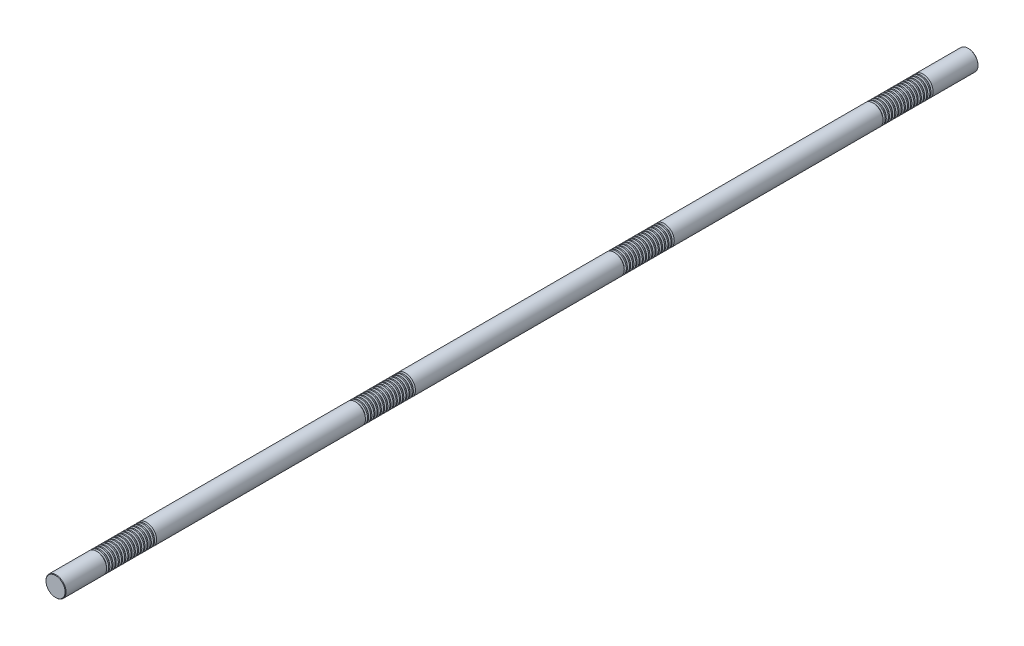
ISO-10303-21;
HEADER;
FILE_DESCRIPTION(('STEP AP214'),'2;1');
FILE_NAME('part.step','',(''),(''),'','','');
FILE_SCHEMA(('AUTOMOTIVE_DESIGN { 1 0 10303 214 1 1 1 1 }'));
ENDSEC;
DATA;
#1=APPLICATION_CONTEXT('core data for automotive mechanical design processes');
#2=APPLICATION_PROTOCOL_DEFINITION('international standard','automotive_design',2000,#1);
#3=PRODUCT_CONTEXT('',#1,'mechanical');
#4=PRODUCT('Part','Part','',(#3));
#5=PRODUCT_RELATED_PRODUCT_CATEGORY('part','',(#4));
#6=PRODUCT_DEFINITION_FORMATION('','',#4);
#7=PRODUCT_DEFINITION_CONTEXT('part definition',#1,'design');
#8=PRODUCT_DEFINITION('design','',#6,#7);
#9=PRODUCT_DEFINITION_SHAPE('','',#8);
#10=(LENGTH_UNIT() NAMED_UNIT(*) SI_UNIT(.MILLI.,.METRE.));
#11=(NAMED_UNIT(*) PLANE_ANGLE_UNIT() SI_UNIT($,.RADIAN.));
#12=(NAMED_UNIT(*) SI_UNIT($,.STERADIAN.) SOLID_ANGLE_UNIT());
#13=UNCERTAINTY_MEASURE_WITH_UNIT(LENGTH_MEASURE(1.E-05),#10,'distance_accuracy_value','');
#14=(GEOMETRIC_REPRESENTATION_CONTEXT(3) GLOBAL_UNCERTAINTY_ASSIGNED_CONTEXT((#13)) GLOBAL_UNIT_ASSIGNED_CONTEXT((#10,
#11,#12)) REPRESENTATION_CONTEXT('',''));
#15=CARTESIAN_POINT('',(0.,0.,0.));
#16=DIRECTION('',(0.,0.,1.));
#17=DIRECTION('',(1.,0.,0.));
#18=AXIS2_PLACEMENT_3D('',#15,#16,#17);
#19=CARTESIAN_POINT('',(0.,0.,1000.));
#20=DIRECTION('',(0.,0.,-1.));
#21=DIRECTION('',(-1.,0.,0.));
#22=AXIS2_PLACEMENT_3D('',#19,#20,#21);
#23=CYLINDRICAL_SURFACE('',#22,22.);
#24=CARTESIAN_POINT('',(0.,0.,903.035898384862));
#25=DIRECTION('',(0.,0.,1.));
#26=DIRECTION('',(1.,0.,0.));
#27=AXIS2_PLACEMENT_3D('',#24,#25,#26);
#28=CIRCLE('',#27,22.);
#29=CARTESIAN_POINT('',(22.,0.,903.035898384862));
#30=VERTEX_POINT('',#29);
#31=EDGE_CURVE('E1057',#30,#30,#28,.T.);
#32=ORIENTED_EDGE('',*,*,#31,.T.);
#33=EDGE_LOOP('',(#32));
#34=FACE_BOUND('',#33,.T.);
#35=CARTESIAN_POINT('',(0.,0.,905.464101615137));
#36=DIRECTION('',(0.,0.,1.));
#37=DIRECTION('',(1.,0.,0.));
#38=AXIS2_PLACEMENT_3D('',#35,#36,#37);
#39=CIRCLE('',#38,22.);
#40=CARTESIAN_POINT('',(22.,0.,905.464101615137));
#41=VERTEX_POINT('',#40);
#42=EDGE_CURVE('E1069',#41,#41,#39,.T.);
#43=ORIENTED_EDGE('',*,*,#42,.F.);
#44=EDGE_LOOP('',(#43));
#45=FACE_BOUND('',#44,.T.);
#46=ADVANCED_FACE('F37',(#34,#45),#23,.T.);
#47=CARTESIAN_POINT('',(0.,0.,896.035898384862));
#48=DIRECTION('',(0.,0.,1.));
#49=DIRECTION('',(1.,0.,0.));
#50=AXIS2_PLACEMENT_3D('',#47,#48,#49);
#51=CIRCLE('',#50,22.);
#52=CARTESIAN_POINT('',(22.,0.,896.035898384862));
#53=VERTEX_POINT('',#52);
#54=EDGE_CURVE('E1041',#53,#53,#51,.T.);
#55=ORIENTED_EDGE('',*,*,#54,.T.);
#56=EDGE_LOOP('',(#55));
#57=FACE_BOUND('',#56,.T.);
#58=CARTESIAN_POINT('',(0.,0.,898.464101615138));
#59=DIRECTION('',(0.,0.,1.));
#60=DIRECTION('',(1.,0.,0.));
#61=AXIS2_PLACEMENT_3D('',#58,#59,#60);
#62=CIRCLE('',#61,22.);
#63=CARTESIAN_POINT('',(22.,0.,898.464101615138));
#64=VERTEX_POINT('',#63);
#65=EDGE_CURVE('E1053',#64,#64,#62,.T.);
#66=ORIENTED_EDGE('',*,*,#65,.F.);
#67=EDGE_LOOP('',(#66));
#68=FACE_BOUND('',#67,.T.);
#69=ADVANCED_FACE('F1105',(#57,#68),#23,.T.);
#70=CARTESIAN_POINT('',(0.,0.,889.035898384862));
#71=DIRECTION('',(0.,0.,1.));
#72=DIRECTION('',(1.,0.,0.));
#73=AXIS2_PLACEMENT_3D('',#70,#71,#72);
#74=CIRCLE('',#73,22.);
#75=CARTESIAN_POINT('',(22.,0.,889.035898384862));
#76=VERTEX_POINT('',#75);
#77=EDGE_CURVE('E1025',#76,#76,#74,.T.);
#78=ORIENTED_EDGE('',*,*,#77,.T.);
#79=EDGE_LOOP('',(#78));
#80=FACE_BOUND('',#79,.T.);
#81=CARTESIAN_POINT('',(0.,0.,891.464101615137));
#82=DIRECTION('',(0.,0.,1.));
#83=DIRECTION('',(1.,0.,0.));
#84=AXIS2_PLACEMENT_3D('',#81,#82,#83);
#85=CIRCLE('',#84,22.);
#86=CARTESIAN_POINT('',(22.,0.,891.464101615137));
#87=VERTEX_POINT('',#86);
#88=EDGE_CURVE('E1037',#87,#87,#85,.T.);
#89=ORIENTED_EDGE('',*,*,#88,.F.);
#90=EDGE_LOOP('',(#89));
#91=FACE_BOUND('',#90,.T.);
#92=ADVANCED_FACE('F1113',(#80,#91),#23,.T.);
#93=CARTESIAN_POINT('',(0.,0.,882.035898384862));
#94=DIRECTION('',(0.,0.,1.));
#95=DIRECTION('',(1.,0.,0.));
#96=AXIS2_PLACEMENT_3D('',#93,#94,#95);
#97=CIRCLE('',#96,22.);
#98=CARTESIAN_POINT('',(22.,0.,882.035898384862));
#99=VERTEX_POINT('',#98);
#100=EDGE_CURVE('E1010',#99,#99,#97,.T.);
#101=ORIENTED_EDGE('',*,*,#100,.T.);
#102=EDGE_LOOP('',(#101));
#103=FACE_BOUND('',#102,.T.);
#104=CARTESIAN_POINT('',(0.,0.,884.464101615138));
#105=DIRECTION('',(0.,0.,1.));
#106=DIRECTION('',(1.,0.,0.));
#107=AXIS2_PLACEMENT_3D('',#104,#105,#106);
#108=CIRCLE('',#107,22.);
#109=CARTESIAN_POINT('',(22.,0.,884.464101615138));
#110=VERTEX_POINT('',#109);
#111=EDGE_CURVE('E1021',#110,#110,#108,.T.);
#112=ORIENTED_EDGE('',*,*,#111,.F.);
#113=EDGE_LOOP('',(#112));
#114=FACE_BOUND('',#113,.T.);
#115=ADVANCED_FACE('F2490',(#103,#114),#23,.T.);
#116=CARTESIAN_POINT('',(0.,0.,875.035898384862));
#117=DIRECTION('',(0.,0.,1.));
#118=DIRECTION('',(1.,0.,0.));
#119=AXIS2_PLACEMENT_3D('',#116,#117,#118);
#120=CIRCLE('',#119,22.);
#121=CARTESIAN_POINT('',(22.,0.,875.035898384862));
#122=VERTEX_POINT('',#121);
#123=EDGE_CURVE('E994',#122,#122,#120,.T.);
#124=ORIENTED_EDGE('',*,*,#123,.T.);
#125=EDGE_LOOP('',(#124));
#126=FACE_BOUND('',#125,.T.);
#127=CARTESIAN_POINT('',(0.,0.,877.464101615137));
#128=DIRECTION('',(0.,0.,1.));
#129=DIRECTION('',(1.,0.,0.));
#130=AXIS2_PLACEMENT_3D('',#127,#128,#129);
#131=CIRCLE('',#130,22.);
#132=CARTESIAN_POINT('',(22.,0.,877.464101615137));
#133=VERTEX_POINT('',#132);
#134=EDGE_CURVE('E1006',#133,#133,#131,.T.);
#135=ORIENTED_EDGE('',*,*,#134,.F.);
#136=EDGE_LOOP('',(#135));
#137=FACE_BOUND('',#136,.T.);
#138=ADVANCED_FACE('F2467',(#126,#137),#23,.T.);
#139=CARTESIAN_POINT('',(0.,0.,868.035898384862));
#140=DIRECTION('',(0.,0.,1.));
#141=DIRECTION('',(1.,0.,0.));
#142=AXIS2_PLACEMENT_3D('',#139,#140,#141);
#143=CIRCLE('',#142,22.);
#144=CARTESIAN_POINT('',(22.,0.,868.035898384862));
#145=VERTEX_POINT('',#144);
#146=EDGE_CURVE('E978',#145,#145,#143,.T.);
#147=ORIENTED_EDGE('',*,*,#146,.T.);
#148=EDGE_LOOP('',(#147));
#149=FACE_BOUND('',#148,.T.);
#150=CARTESIAN_POINT('',(0.,0.,870.464101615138));
#151=DIRECTION('',(0.,0.,1.));
#152=DIRECTION('',(1.,0.,0.));
#153=AXIS2_PLACEMENT_3D('',#150,#151,#152);
#154=CIRCLE('',#153,22.);
#155=CARTESIAN_POINT('',(22.,0.,870.464101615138));
#156=VERTEX_POINT('',#155);
#157=EDGE_CURVE('E990',#156,#156,#154,.T.);
#158=ORIENTED_EDGE('',*,*,#157,.F.);
#159=EDGE_LOOP('',(#158));
#160=FACE_BOUND('',#159,.T.);
#161=ADVANCED_FACE('F2444',(#149,#160),#23,.T.);
#162=CARTESIAN_POINT('',(0.,0.,861.035898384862));
#163=DIRECTION('',(0.,0.,1.));
#164=DIRECTION('',(1.,0.,0.));
#165=AXIS2_PLACEMENT_3D('',#162,#163,#164);
#166=CIRCLE('',#165,22.);
#167=CARTESIAN_POINT('',(22.,0.,861.035898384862));
#168=VERTEX_POINT('',#167);
#169=EDGE_CURVE('E962',#168,#168,#166,.T.);
#170=ORIENTED_EDGE('',*,*,#169,.T.);
#171=EDGE_LOOP('',(#170));
#172=FACE_BOUND('',#171,.T.);
#173=CARTESIAN_POINT('',(0.,0.,863.464101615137));
#174=DIRECTION('',(0.,0.,1.));
#175=DIRECTION('',(1.,0.,0.));
#176=AXIS2_PLACEMENT_3D('',#173,#174,#175);
#177=CIRCLE('',#176,22.);
#178=CARTESIAN_POINT('',(22.,0.,863.464101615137));
#179=VERTEX_POINT('',#178);
#180=EDGE_CURVE('E974',#179,#179,#177,.T.);
#181=ORIENTED_EDGE('',*,*,#180,.F.);
#182=EDGE_LOOP('',(#181));
#183=FACE_BOUND('',#182,.T.);
#184=ADVANCED_FACE('F2421',(#172,#183),#23,.T.);
#185=CARTESIAN_POINT('',(0.,0.,854.035898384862));
#186=DIRECTION('',(0.,0.,1.));
#187=DIRECTION('',(1.,0.,0.));
#188=AXIS2_PLACEMENT_3D('',#185,#186,#187);
#189=CIRCLE('',#188,22.);
#190=CARTESIAN_POINT('',(22.,0.,854.035898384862));
#191=VERTEX_POINT('',#190);
#192=EDGE_CURVE('E946',#191,#191,#189,.T.);
#193=ORIENTED_EDGE('',*,*,#192,.T.);
#194=EDGE_LOOP('',(#193));
#195=FACE_BOUND('',#194,.T.);
#196=CARTESIAN_POINT('',(0.,0.,856.464101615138));
#197=DIRECTION('',(0.,0.,1.));
#198=DIRECTION('',(1.,0.,0.));
#199=AXIS2_PLACEMENT_3D('',#196,#197,#198);
#200=CIRCLE('',#199,22.);
#201=CARTESIAN_POINT('',(22.,0.,856.464101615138));
#202=VERTEX_POINT('',#201);
#203=EDGE_CURVE('E958',#202,#202,#200,.T.);
#204=ORIENTED_EDGE('',*,*,#203,.F.);
#205=EDGE_LOOP('',(#204));
#206=FACE_BOUND('',#205,.T.);
#207=ADVANCED_FACE('F2398',(#195,#206),#23,.T.);
#208=CARTESIAN_POINT('',(0.,0.,847.035898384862));
#209=DIRECTION('',(0.,0.,1.));
#210=DIRECTION('',(1.,0.,0.));
#211=AXIS2_PLACEMENT_3D('',#208,#209,#210);
#212=CIRCLE('',#211,22.);
#213=CARTESIAN_POINT('',(22.,0.,847.035898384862));
#214=VERTEX_POINT('',#213);
#215=EDGE_CURVE('E930',#214,#214,#212,.T.);
#216=ORIENTED_EDGE('',*,*,#215,.T.);
#217=EDGE_LOOP('',(#216));
#218=FACE_BOUND('',#217,.T.);
#219=CARTESIAN_POINT('',(0.,0.,849.464101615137));
#220=DIRECTION('',(0.,0.,1.));
#221=DIRECTION('',(1.,0.,0.));
#222=AXIS2_PLACEMENT_3D('',#219,#220,#221);
#223=CIRCLE('',#222,22.);
#224=CARTESIAN_POINT('',(22.,0.,849.464101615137));
#225=VERTEX_POINT('',#224);
#226=EDGE_CURVE('E942',#225,#225,#223,.T.);
#227=ORIENTED_EDGE('',*,*,#226,.F.);
#228=EDGE_LOOP('',(#227));
#229=FACE_BOUND('',#228,.T.);
#230=ADVANCED_FACE('F2375',(#218,#229),#23,.T.);
#231=CARTESIAN_POINT('',(0.,0.,840.035898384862));
#232=DIRECTION('',(0.,0.,1.));
#233=DIRECTION('',(1.,0.,0.));
#234=AXIS2_PLACEMENT_3D('',#231,#232,#233);
#235=CIRCLE('',#234,22.);
#236=CARTESIAN_POINT('',(22.,0.,840.035898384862));
#237=VERTEX_POINT('',#236);
#238=EDGE_CURVE('E914',#237,#237,#235,.T.);
#239=ORIENTED_EDGE('',*,*,#238,.T.);
#240=EDGE_LOOP('',(#239));
#241=FACE_BOUND('',#240,.T.);
#242=CARTESIAN_POINT('',(0.,0.,842.464101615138));
#243=DIRECTION('',(0.,0.,1.));
#244=DIRECTION('',(1.,0.,0.));
#245=AXIS2_PLACEMENT_3D('',#242,#243,#244);
#246=CIRCLE('',#245,22.);
#247=CARTESIAN_POINT('',(22.,0.,842.464101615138));
#248=VERTEX_POINT('',#247);
#249=EDGE_CURVE('E926',#248,#248,#246,.T.);
#250=ORIENTED_EDGE('',*,*,#249,.F.);
#251=EDGE_LOOP('',(#250));
#252=FACE_BOUND('',#251,.T.);
#253=ADVANCED_FACE('F2352',(#241,#252),#23,.T.);
#254=CARTESIAN_POINT('',(0.,0.,833.035898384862));
#255=DIRECTION('',(0.,0.,1.));
#256=DIRECTION('',(1.,0.,0.));
#257=AXIS2_PLACEMENT_3D('',#254,#255,#256);
#258=CIRCLE('',#257,22.);
#259=CARTESIAN_POINT('',(22.,0.,833.035898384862));
#260=VERTEX_POINT('',#259);
#261=EDGE_CURVE('E899',#260,#260,#258,.T.);
#262=ORIENTED_EDGE('',*,*,#261,.T.);
#263=EDGE_LOOP('',(#262));
#264=FACE_BOUND('',#263,.T.);
#265=CARTESIAN_POINT('',(0.,0.,835.464101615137));
#266=DIRECTION('',(0.,0.,1.));
#267=DIRECTION('',(1.,0.,0.));
#268=AXIS2_PLACEMENT_3D('',#265,#266,#267);
#269=CIRCLE('',#268,22.);
#270=CARTESIAN_POINT('',(22.,0.,835.464101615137));
#271=VERTEX_POINT('',#270);
#272=EDGE_CURVE('E911',#271,#271,#269,.T.);
#273=ORIENTED_EDGE('',*,*,#272,.F.);
#274=EDGE_LOOP('',(#273));
#275=FACE_BOUND('',#274,.T.);
#276=ADVANCED_FACE('F2329',(#264,#275),#23,.T.);
#277=CARTESIAN_POINT('',(0.,0.,826.035898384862));
#278=DIRECTION('',(0.,0.,1.));
#279=DIRECTION('',(1.,0.,0.));
#280=AXIS2_PLACEMENT_3D('',#277,#278,#279);
#281=CIRCLE('',#280,22.);
#282=CARTESIAN_POINT('',(22.,0.,826.035898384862));
#283=VERTEX_POINT('',#282);
#284=EDGE_CURVE('E883',#283,#283,#281,.T.);
#285=ORIENTED_EDGE('',*,*,#284,.T.);
#286=EDGE_LOOP('',(#285));
#287=FACE_BOUND('',#286,.T.);
#288=CARTESIAN_POINT('',(0.,0.,828.464101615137));
#289=DIRECTION('',(0.,0.,1.));
#290=DIRECTION('',(1.,0.,0.));
#291=AXIS2_PLACEMENT_3D('',#288,#289,#290);
#292=CIRCLE('',#291,22.);
#293=CARTESIAN_POINT('',(22.,0.,828.464101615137));
#294=VERTEX_POINT('',#293);
#295=EDGE_CURVE('E895',#294,#294,#292,.T.);
#296=ORIENTED_EDGE('',*,*,#295,.F.);
#297=EDGE_LOOP('',(#296));
#298=FACE_BOUND('',#297,.T.);
#299=ADVANCED_FACE('F2306',(#287,#298),#23,.T.);
#300=CARTESIAN_POINT('',(0.,0.,819.035898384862));
#301=DIRECTION('',(0.,0.,1.));
#302=DIRECTION('',(1.,0.,0.));
#303=AXIS2_PLACEMENT_3D('',#300,#301,#302);
#304=CIRCLE('',#303,22.);
#305=CARTESIAN_POINT('',(22.,0.,819.035898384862));
#306=VERTEX_POINT('',#305);
#307=EDGE_CURVE('E867',#306,#306,#304,.T.);
#308=ORIENTED_EDGE('',*,*,#307,.T.);
#309=EDGE_LOOP('',(#308));
#310=FACE_BOUND('',#309,.T.);
#311=CARTESIAN_POINT('',(0.,0.,821.464101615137));
#312=DIRECTION('',(0.,0.,1.));
#313=DIRECTION('',(1.,0.,0.));
#314=AXIS2_PLACEMENT_3D('',#311,#312,#313);
#315=CIRCLE('',#314,22.);
#316=CARTESIAN_POINT('',(22.,0.,821.464101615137));
#317=VERTEX_POINT('',#316);
#318=EDGE_CURVE('E879',#317,#317,#315,.T.);
#319=ORIENTED_EDGE('',*,*,#318,.F.);
#320=EDGE_LOOP('',(#319));
#321=FACE_BOUND('',#320,.T.);
#322=ADVANCED_FACE('F2283',(#310,#321),#23,.T.);
#323=CARTESIAN_POINT('',(0.,0.,812.035898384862));
#324=DIRECTION('',(0.,0.,1.));
#325=DIRECTION('',(1.,0.,0.));
#326=AXIS2_PLACEMENT_3D('',#323,#324,#325);
#327=CIRCLE('',#326,22.);
#328=CARTESIAN_POINT('',(22.,0.,812.035898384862));
#329=VERTEX_POINT('',#328);
#330=EDGE_CURVE('E851',#329,#329,#327,.T.);
#331=ORIENTED_EDGE('',*,*,#330,.T.);
#332=EDGE_LOOP('',(#331));
#333=FACE_BOUND('',#332,.T.);
#334=CARTESIAN_POINT('',(0.,0.,814.464101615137));
#335=DIRECTION('',(0.,0.,1.));
#336=DIRECTION('',(1.,0.,0.));
#337=AXIS2_PLACEMENT_3D('',#334,#335,#336);
#338=CIRCLE('',#337,22.);
#339=CARTESIAN_POINT('',(22.,0.,814.464101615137));
#340=VERTEX_POINT('',#339);
#341=EDGE_CURVE('E863',#340,#340,#338,.T.);
#342=ORIENTED_EDGE('',*,*,#341,.F.);
#343=EDGE_LOOP('',(#342));
#344=FACE_BOUND('',#343,.T.);
#345=ADVANCED_FACE('F2264',(#333,#344),#23,.T.);
#346=CARTESIAN_POINT('',(0.,0.,805.035898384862));
#347=DIRECTION('',(0.,0.,1.));
#348=DIRECTION('',(1.,0.,0.));
#349=AXIS2_PLACEMENT_3D('',#346,#347,#348);
#350=CIRCLE('',#349,22.);
#351=CARTESIAN_POINT('',(22.,0.,805.035898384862));
#352=VERTEX_POINT('',#351);
#353=EDGE_CURVE('E355',#352,#352,#350,.T.);
#354=ORIENTED_EDGE('',*,*,#353,.T.);
#355=EDGE_LOOP('',(#354));
#356=FACE_BOUND('',#355,.T.);
#357=CARTESIAN_POINT('',(0.,0.,807.464101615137));
#358=DIRECTION('',(0.,0.,1.));
#359=DIRECTION('',(1.,0.,0.));
#360=AXIS2_PLACEMENT_3D('',#357,#358,#359);
#361=CIRCLE('',#360,22.);
#362=CARTESIAN_POINT('',(22.,0.,807.464101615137));
#363=VERTEX_POINT('',#362);
#364=EDGE_CURVE('E847',#363,#363,#361,.T.);
#365=ORIENTED_EDGE('',*,*,#364,.F.);
#366=EDGE_LOOP('',(#365));
#367=FACE_BOUND('',#366,.T.);
#368=ADVANCED_FACE('F2213',(#356,#367),#23,.T.);
#369=CARTESIAN_POINT('',(0.,0.,336.035898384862));
#370=DIRECTION('',(0.,0.,1.));
#371=DIRECTION('',(1.,0.,0.));
#372=AXIS2_PLACEMENT_3D('',#369,#370,#371);
#373=CIRCLE('',#372,22.);
#374=CARTESIAN_POINT('',(22.,0.,336.035898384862));
#375=VERTEX_POINT('',#374);
#376=EDGE_CURVE('E819',#375,#375,#373,.T.);
#377=ORIENTED_EDGE('',*,*,#376,.T.);
#378=EDGE_LOOP('',(#377));
#379=FACE_BOUND('',#378,.T.);
#380=CARTESIAN_POINT('',(0.,0.,338.464101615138));
#381=DIRECTION('',(0.,0.,1.));
#382=DIRECTION('',(1.,0.,0.));
#383=AXIS2_PLACEMENT_3D('',#380,#381,#382);
#384=CIRCLE('',#383,22.);
#385=CARTESIAN_POINT('',(22.,0.,338.464101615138));
#386=VERTEX_POINT('',#385);
#387=EDGE_CURVE('E831',#386,#386,#384,.T.);
#388=ORIENTED_EDGE('',*,*,#387,.F.);
#389=EDGE_LOOP('',(#388));
#390=FACE_BOUND('',#389,.T.);
#391=ADVANCED_FACE('F2189',(#379,#390),#23,.T.);
#392=CARTESIAN_POINT('',(0.,0.,329.035898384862));
#393=DIRECTION('',(0.,0.,1.));
#394=DIRECTION('',(1.,0.,0.));
#395=AXIS2_PLACEMENT_3D('',#392,#393,#394);
#396=CIRCLE('',#395,22.);
#397=CARTESIAN_POINT('',(22.,0.,329.035898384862));
#398=VERTEX_POINT('',#397);
#399=EDGE_CURVE('E803',#398,#398,#396,.T.);
#400=ORIENTED_EDGE('',*,*,#399,.T.);
#401=EDGE_LOOP('',(#400));
#402=FACE_BOUND('',#401,.T.);
#403=CARTESIAN_POINT('',(0.,0.,331.464101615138));
#404=DIRECTION('',(0.,0.,1.));
#405=DIRECTION('',(1.,0.,0.));
#406=AXIS2_PLACEMENT_3D('',#403,#404,#405);
#407=CIRCLE('',#406,22.);
#408=CARTESIAN_POINT('',(22.,0.,331.464101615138));
#409=VERTEX_POINT('',#408);
#410=EDGE_CURVE('E815',#409,#409,#407,.T.);
#411=ORIENTED_EDGE('',*,*,#410,.F.);
#412=EDGE_LOOP('',(#411));
#413=FACE_BOUND('',#412,.T.);
#414=ADVANCED_FACE('F2166',(#402,#413),#23,.T.);
#415=CARTESIAN_POINT('',(0.,0.,322.035898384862));
#416=DIRECTION('',(0.,0.,1.));
#417=DIRECTION('',(1.,0.,0.));
#418=AXIS2_PLACEMENT_3D('',#415,#416,#417);
#419=CIRCLE('',#418,22.);
#420=CARTESIAN_POINT('',(22.,0.,322.035898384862));
#421=VERTEX_POINT('',#420);
#422=EDGE_CURVE('E787',#421,#421,#419,.T.);
#423=ORIENTED_EDGE('',*,*,#422,.T.);
#424=EDGE_LOOP('',(#423));
#425=FACE_BOUND('',#424,.T.);
#426=CARTESIAN_POINT('',(0.,0.,324.464101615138));
#427=DIRECTION('',(0.,0.,1.));
#428=DIRECTION('',(1.,0.,0.));
#429=AXIS2_PLACEMENT_3D('',#426,#427,#428);
#430=CIRCLE('',#429,22.);
#431=CARTESIAN_POINT('',(22.,0.,324.464101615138));
#432=VERTEX_POINT('',#431);
#433=EDGE_CURVE('E799',#432,#432,#430,.T.);
#434=ORIENTED_EDGE('',*,*,#433,.F.);
#435=EDGE_LOOP('',(#434));
#436=FACE_BOUND('',#435,.T.);
#437=ADVANCED_FACE('F2143',(#425,#436),#23,.T.);
#438=CARTESIAN_POINT('',(0.,0.,315.035898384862));
#439=DIRECTION('',(0.,0.,1.));
#440=DIRECTION('',(1.,0.,0.));
#441=AXIS2_PLACEMENT_3D('',#438,#439,#440);
#442=CIRCLE('',#441,22.);
#443=CARTESIAN_POINT('',(22.,0.,315.035898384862));
#444=VERTEX_POINT('',#443);
#445=EDGE_CURVE('E771',#444,#444,#442,.T.);
#446=ORIENTED_EDGE('',*,*,#445,.T.);
#447=EDGE_LOOP('',(#446));
#448=FACE_BOUND('',#447,.T.);
#449=CARTESIAN_POINT('',(0.,0.,317.464101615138));
#450=DIRECTION('',(0.,0.,1.));
#451=DIRECTION('',(1.,0.,0.));
#452=AXIS2_PLACEMENT_3D('',#449,#450,#451);
#453=CIRCLE('',#452,22.);
#454=CARTESIAN_POINT('',(22.,0.,317.464101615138));
#455=VERTEX_POINT('',#454);
#456=EDGE_CURVE('E783',#455,#455,#453,.T.);
#457=ORIENTED_EDGE('',*,*,#456,.F.);
#458=EDGE_LOOP('',(#457));
#459=FACE_BOUND('',#458,.T.);
#460=ADVANCED_FACE('F2120',(#448,#459),#23,.T.);
#461=CARTESIAN_POINT('',(0.,0.,308.035898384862));
#462=DIRECTION('',(0.,0.,1.));
#463=DIRECTION('',(1.,0.,0.));
#464=AXIS2_PLACEMENT_3D('',#461,#462,#463);
#465=CIRCLE('',#464,22.);
#466=CARTESIAN_POINT('',(22.,0.,308.035898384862));
#467=VERTEX_POINT('',#466);
#468=EDGE_CURVE('E755',#467,#467,#465,.T.);
#469=ORIENTED_EDGE('',*,*,#468,.T.);
#470=EDGE_LOOP('',(#469));
#471=FACE_BOUND('',#470,.T.);
#472=CARTESIAN_POINT('',(0.,0.,310.464101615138));
#473=DIRECTION('',(0.,0.,1.));
#474=DIRECTION('',(1.,0.,0.));
#475=AXIS2_PLACEMENT_3D('',#472,#473,#474);
#476=CIRCLE('',#475,22.);
#477=CARTESIAN_POINT('',(22.,0.,310.464101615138));
#478=VERTEX_POINT('',#477);
#479=EDGE_CURVE('E767',#478,#478,#476,.T.);
#480=ORIENTED_EDGE('',*,*,#479,.F.);
#481=EDGE_LOOP('',(#480));
#482=FACE_BOUND('',#481,.T.);
#483=ADVANCED_FACE('F2097',(#471,#482),#23,.T.);
#484=CARTESIAN_POINT('',(0.,0.,301.035898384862));
#485=DIRECTION('',(0.,0.,1.));
#486=DIRECTION('',(1.,0.,0.));
#487=AXIS2_PLACEMENT_3D('',#484,#485,#486);
#488=CIRCLE('',#487,22.);
#489=CARTESIAN_POINT('',(22.,0.,301.035898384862));
#490=VERTEX_POINT('',#489);
#491=EDGE_CURVE('E739',#490,#490,#488,.T.);
#492=ORIENTED_EDGE('',*,*,#491,.T.);
#493=EDGE_LOOP('',(#492));
#494=FACE_BOUND('',#493,.T.);
#495=CARTESIAN_POINT('',(0.,0.,303.464101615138));
#496=DIRECTION('',(0.,0.,1.));
#497=DIRECTION('',(1.,0.,0.));
#498=AXIS2_PLACEMENT_3D('',#495,#496,#497);
#499=CIRCLE('',#498,22.);
#500=CARTESIAN_POINT('',(22.,0.,303.464101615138));
#501=VERTEX_POINT('',#500);
#502=EDGE_CURVE('E751',#501,#501,#499,.T.);
#503=ORIENTED_EDGE('',*,*,#502,.F.);
#504=EDGE_LOOP('',(#503));
#505=FACE_BOUND('',#504,.T.);
#506=ADVANCED_FACE('F2074',(#494,#505),#23,.T.);
#507=CARTESIAN_POINT('',(0.,0.,294.035898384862));
#508=DIRECTION('',(0.,0.,1.));
#509=DIRECTION('',(1.,0.,0.));
#510=AXIS2_PLACEMENT_3D('',#507,#508,#509);
#511=CIRCLE('',#510,22.);
#512=CARTESIAN_POINT('',(22.,0.,294.035898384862));
#513=VERTEX_POINT('',#512);
#514=EDGE_CURVE('E723',#513,#513,#511,.T.);
#515=ORIENTED_EDGE('',*,*,#514,.T.);
#516=EDGE_LOOP('',(#515));
#517=FACE_BOUND('',#516,.T.);
#518=CARTESIAN_POINT('',(0.,0.,296.464101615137));
#519=DIRECTION('',(0.,0.,1.));
#520=DIRECTION('',(1.,0.,0.));
#521=AXIS2_PLACEMENT_3D('',#518,#519,#520);
#522=CIRCLE('',#521,22.);
#523=CARTESIAN_POINT('',(22.,0.,296.464101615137));
#524=VERTEX_POINT('',#523);
#525=EDGE_CURVE('E735',#524,#524,#522,.T.);
#526=ORIENTED_EDGE('',*,*,#525,.F.);
#527=EDGE_LOOP('',(#526));
#528=FACE_BOUND('',#527,.T.);
#529=ADVANCED_FACE('F2051',(#517,#528),#23,.T.);
#530=CARTESIAN_POINT('',(0.,0.,287.035898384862));
#531=DIRECTION('',(0.,0.,1.));
#532=DIRECTION('',(1.,0.,0.));
#533=AXIS2_PLACEMENT_3D('',#530,#531,#532);
#534=CIRCLE('',#533,22.);
#535=CARTESIAN_POINT('',(22.,0.,287.035898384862));
#536=VERTEX_POINT('',#535);
#537=EDGE_CURVE('E707',#536,#536,#534,.T.);
#538=ORIENTED_EDGE('',*,*,#537,.T.);
#539=EDGE_LOOP('',(#538));
#540=FACE_BOUND('',#539,.T.);
#541=CARTESIAN_POINT('',(0.,0.,289.464101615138));
#542=DIRECTION('',(0.,0.,1.));
#543=DIRECTION('',(1.,0.,0.));
#544=AXIS2_PLACEMENT_3D('',#541,#542,#543);
#545=CIRCLE('',#544,22.);
#546=CARTESIAN_POINT('',(22.,0.,289.464101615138));
#547=VERTEX_POINT('',#546);
#548=EDGE_CURVE('E719',#547,#547,#545,.T.);
#549=ORIENTED_EDGE('',*,*,#548,.F.);
#550=EDGE_LOOP('',(#549));
#551=FACE_BOUND('',#550,.T.);
#552=ADVANCED_FACE('F2028',(#540,#551),#23,.T.);
#553=CARTESIAN_POINT('',(0.,0.,280.035898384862));
#554=DIRECTION('',(0.,0.,1.));
#555=DIRECTION('',(1.,0.,0.));
#556=AXIS2_PLACEMENT_3D('',#553,#554,#555);
#557=CIRCLE('',#556,22.);
#558=CARTESIAN_POINT('',(22.,0.,280.035898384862));
#559=VERTEX_POINT('',#558);
#560=EDGE_CURVE('E691',#559,#559,#557,.T.);
#561=ORIENTED_EDGE('',*,*,#560,.T.);
#562=EDGE_LOOP('',(#561));
#563=FACE_BOUND('',#562,.T.);
#564=CARTESIAN_POINT('',(0.,0.,282.464101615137));
#565=DIRECTION('',(0.,0.,1.));
#566=DIRECTION('',(1.,0.,0.));
#567=AXIS2_PLACEMENT_3D('',#564,#565,#566);
#568=CIRCLE('',#567,22.);
#569=CARTESIAN_POINT('',(22.,0.,282.464101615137));
#570=VERTEX_POINT('',#569);
#571=EDGE_CURVE('E703',#570,#570,#568,.T.);
#572=ORIENTED_EDGE('',*,*,#571,.F.);
#573=EDGE_LOOP('',(#572));
#574=FACE_BOUND('',#573,.T.);
#575=ADVANCED_FACE('F2005',(#563,#574),#23,.T.);
#576=CARTESIAN_POINT('',(0.,0.,273.035898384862));
#577=DIRECTION('',(0.,0.,1.));
#578=DIRECTION('',(1.,0.,0.));
#579=AXIS2_PLACEMENT_3D('',#576,#577,#578);
#580=CIRCLE('',#579,22.);
#581=CARTESIAN_POINT('',(22.,0.,273.035898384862));
#582=VERTEX_POINT('',#581);
#583=EDGE_CURVE('E675',#582,#582,#580,.T.);
#584=ORIENTED_EDGE('',*,*,#583,.T.);
#585=EDGE_LOOP('',(#584));
#586=FACE_BOUND('',#585,.T.);
#587=CARTESIAN_POINT('',(0.,0.,275.464101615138));
#588=DIRECTION('',(0.,0.,1.));
#589=DIRECTION('',(1.,0.,0.));
#590=AXIS2_PLACEMENT_3D('',#587,#588,#589);
#591=CIRCLE('',#590,22.);
#592=CARTESIAN_POINT('',(22.,0.,275.464101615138));
#593=VERTEX_POINT('',#592);
#594=EDGE_CURVE('E687',#593,#593,#591,.T.);
#595=ORIENTED_EDGE('',*,*,#594,.F.);
#596=EDGE_LOOP('',(#595));
#597=FACE_BOUND('',#596,.T.);
#598=ADVANCED_FACE('F1982',(#586,#597),#23,.T.);
#599=CARTESIAN_POINT('',(0.,0.,266.035898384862));
#600=DIRECTION('',(0.,0.,1.));
#601=DIRECTION('',(1.,0.,0.));
#602=AXIS2_PLACEMENT_3D('',#599,#600,#601);
#603=CIRCLE('',#602,22.);
#604=CARTESIAN_POINT('',(22.,0.,266.035898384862));
#605=VERTEX_POINT('',#604);
#606=EDGE_CURVE('E659',#605,#605,#603,.T.);
#607=ORIENTED_EDGE('',*,*,#606,.T.);
#608=EDGE_LOOP('',(#607));
#609=FACE_BOUND('',#608,.T.);
#610=CARTESIAN_POINT('',(0.,0.,268.464101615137));
#611=DIRECTION('',(0.,0.,1.));
#612=DIRECTION('',(1.,0.,0.));
#613=AXIS2_PLACEMENT_3D('',#610,#611,#612);
#614=CIRCLE('',#613,22.);
#615=CARTESIAN_POINT('',(22.,0.,268.464101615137));
#616=VERTEX_POINT('',#615);
#617=EDGE_CURVE('E671',#616,#616,#614,.T.);
#618=ORIENTED_EDGE('',*,*,#617,.F.);
#619=EDGE_LOOP('',(#618));
#620=FACE_BOUND('',#619,.T.);
#621=ADVANCED_FACE('F1959',(#609,#620),#23,.T.);
#622=CARTESIAN_POINT('',(0.,0.,259.035898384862));
#623=DIRECTION('',(0.,0.,1.));
#624=DIRECTION('',(1.,0.,0.));
#625=AXIS2_PLACEMENT_3D('',#622,#623,#624);
#626=CIRCLE('',#625,22.);
#627=CARTESIAN_POINT('',(22.,0.,259.035898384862));
#628=VERTEX_POINT('',#627);
#629=EDGE_CURVE('E643',#628,#628,#626,.T.);
#630=ORIENTED_EDGE('',*,*,#629,.T.);
#631=EDGE_LOOP('',(#630));
#632=FACE_BOUND('',#631,.T.);
#633=CARTESIAN_POINT('',(0.,0.,261.464101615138));
#634=DIRECTION('',(0.,0.,1.));
#635=DIRECTION('',(1.,0.,0.));
#636=AXIS2_PLACEMENT_3D('',#633,#634,#635);
#637=CIRCLE('',#636,22.);
#638=CARTESIAN_POINT('',(22.,0.,261.464101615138));
#639=VERTEX_POINT('',#638);
#640=EDGE_CURVE('E655',#639,#639,#637,.T.);
#641=ORIENTED_EDGE('',*,*,#640,.F.);
#642=EDGE_LOOP('',(#641));
#643=FACE_BOUND('',#642,.T.);
#644=ADVANCED_FACE('F1936',(#632,#643),#23,.T.);
#645=CARTESIAN_POINT('',(0.,0.,252.035898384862));
#646=DIRECTION('',(0.,0.,1.));
#647=DIRECTION('',(1.,0.,0.));
#648=AXIS2_PLACEMENT_3D('',#645,#646,#647);
#649=CIRCLE('',#648,22.);
#650=CARTESIAN_POINT('',(22.,0.,252.035898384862));
#651=VERTEX_POINT('',#650);
#652=EDGE_CURVE('E627',#651,#651,#649,.T.);
#653=ORIENTED_EDGE('',*,*,#652,.T.);
#654=EDGE_LOOP('',(#653));
#655=FACE_BOUND('',#654,.T.);
#656=CARTESIAN_POINT('',(0.,0.,254.464101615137));
#657=DIRECTION('',(0.,0.,1.));
#658=DIRECTION('',(1.,0.,0.));
#659=AXIS2_PLACEMENT_3D('',#656,#657,#658);
#660=CIRCLE('',#659,22.);
#661=CARTESIAN_POINT('',(22.,0.,254.464101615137));
#662=VERTEX_POINT('',#661);
#663=EDGE_CURVE('E639',#662,#662,#660,.T.);
#664=ORIENTED_EDGE('',*,*,#663,.F.);
#665=EDGE_LOOP('',(#664));
#666=FACE_BOUND('',#665,.T.);
#667=ADVANCED_FACE('F1913',(#655,#666),#23,.T.);
#668=CARTESIAN_POINT('',(0.,0.,245.035898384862));
#669=DIRECTION('',(0.,0.,1.));
#670=DIRECTION('',(1.,0.,0.));
#671=AXIS2_PLACEMENT_3D('',#668,#669,#670);
#672=CIRCLE('',#671,22.);
#673=CARTESIAN_POINT('',(22.,0.,245.035898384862));
#674=VERTEX_POINT('',#673);
#675=EDGE_CURVE('E611',#674,#674,#672,.T.);
#676=ORIENTED_EDGE('',*,*,#675,.T.);
#677=EDGE_LOOP('',(#676));
#678=FACE_BOUND('',#677,.T.);
#679=CARTESIAN_POINT('',(0.,0.,247.464101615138));
#680=DIRECTION('',(0.,0.,1.));
#681=DIRECTION('',(1.,0.,0.));
#682=AXIS2_PLACEMENT_3D('',#679,#680,#681);
#683=CIRCLE('',#682,22.);
#684=CARTESIAN_POINT('',(22.,0.,247.464101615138));
#685=VERTEX_POINT('',#684);
#686=EDGE_CURVE('E623',#685,#685,#683,.T.);
#687=ORIENTED_EDGE('',*,*,#686,.F.);
#688=EDGE_LOOP('',(#687));
#689=FACE_BOUND('',#688,.T.);
#690=ADVANCED_FACE('F1894',(#678,#689),#23,.T.);
#691=CARTESIAN_POINT('',(0.,0.,238.035898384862));
#692=DIRECTION('',(0.,0.,1.));
#693=DIRECTION('',(1.,0.,0.));
#694=AXIS2_PLACEMENT_3D('',#691,#692,#693);
#695=CIRCLE('',#694,22.);
#696=CARTESIAN_POINT('',(22.,0.,238.035898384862));
#697=VERTEX_POINT('',#696);
#698=EDGE_CURVE('E339',#697,#697,#695,.T.);
#699=ORIENTED_EDGE('',*,*,#698,.T.);
#700=EDGE_LOOP('',(#699));
#701=FACE_BOUND('',#700,.T.);
#702=CARTESIAN_POINT('',(0.,0.,240.464101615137));
#703=DIRECTION('',(0.,0.,1.));
#704=DIRECTION('',(1.,0.,0.));
#705=AXIS2_PLACEMENT_3D('',#702,#703,#704);
#706=CIRCLE('',#705,22.);
#707=CARTESIAN_POINT('',(22.,0.,240.464101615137));
#708=VERTEX_POINT('',#707);
#709=EDGE_CURVE('E607',#708,#708,#706,.T.);
#710=ORIENTED_EDGE('',*,*,#709,.F.);
#711=EDGE_LOOP('',(#710));
#712=FACE_BOUND('',#711,.T.);
#713=ADVANCED_FACE('F1843',(#701,#712),#23,.T.);
#714=CARTESIAN_POINT('',(0.,0.,-230.964101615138));
#715=DIRECTION('',(0.,0.,1.));
#716=DIRECTION('',(1.,0.,0.));
#717=AXIS2_PLACEMENT_3D('',#714,#715,#716);
#718=CIRCLE('',#717,22.);
#719=CARTESIAN_POINT('',(22.,0.,-230.964101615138));
#720=VERTEX_POINT('',#719);
#721=EDGE_CURVE('E579',#720,#720,#718,.T.);
#722=ORIENTED_EDGE('',*,*,#721,.T.);
#723=EDGE_LOOP('',(#722));
#724=FACE_BOUND('',#723,.T.);
#725=CARTESIAN_POINT('',(0.,0.,-228.535898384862));
#726=DIRECTION('',(0.,0.,1.));
#727=DIRECTION('',(1.,0.,0.));
#728=AXIS2_PLACEMENT_3D('',#725,#726,#727);
#729=CIRCLE('',#728,22.);
#730=CARTESIAN_POINT('',(22.,0.,-228.535898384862));
#731=VERTEX_POINT('',#730);
#732=EDGE_CURVE('E591',#731,#731,#729,.T.);
#733=ORIENTED_EDGE('',*,*,#732,.F.);
#734=EDGE_LOOP('',(#733));
#735=FACE_BOUND('',#734,.T.);
#736=ADVANCED_FACE('F1819',(#724,#735),#23,.T.);
#737=CARTESIAN_POINT('',(0.,0.,-237.964101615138));
#738=DIRECTION('',(0.,0.,1.));
#739=DIRECTION('',(1.,0.,0.));
#740=AXIS2_PLACEMENT_3D('',#737,#738,#739);
#741=CIRCLE('',#740,22.);
#742=CARTESIAN_POINT('',(22.,0.,-237.964101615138));
#743=VERTEX_POINT('',#742);
#744=EDGE_CURVE('E563',#743,#743,#741,.T.);
#745=ORIENTED_EDGE('',*,*,#744,.T.);
#746=EDGE_LOOP('',(#745));
#747=FACE_BOUND('',#746,.T.);
#748=CARTESIAN_POINT('',(0.,0.,-235.535898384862));
#749=DIRECTION('',(0.,0.,1.));
#750=DIRECTION('',(1.,0.,0.));
#751=AXIS2_PLACEMENT_3D('',#748,#749,#750);
#752=CIRCLE('',#751,22.);
#753=CARTESIAN_POINT('',(22.,0.,-235.535898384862));
#754=VERTEX_POINT('',#753);
#755=EDGE_CURVE('E575',#754,#754,#752,.T.);
#756=ORIENTED_EDGE('',*,*,#755,.F.);
#757=EDGE_LOOP('',(#756));
#758=FACE_BOUND('',#757,.T.);
#759=ADVANCED_FACE('F1796',(#747,#758),#23,.T.);
#760=CARTESIAN_POINT('',(0.,0.,-244.964101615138));
#761=DIRECTION('',(0.,0.,1.));
#762=DIRECTION('',(1.,0.,0.));
#763=AXIS2_PLACEMENT_3D('',#760,#761,#762);
#764=CIRCLE('',#763,22.);
#765=CARTESIAN_POINT('',(22.,0.,-244.964101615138));
#766=VERTEX_POINT('',#765);
#767=EDGE_CURVE('E547',#766,#766,#764,.T.);
#768=ORIENTED_EDGE('',*,*,#767,.T.);
#769=EDGE_LOOP('',(#768));
#770=FACE_BOUND('',#769,.T.);
#771=CARTESIAN_POINT('',(0.,0.,-242.535898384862));
#772=DIRECTION('',(0.,0.,1.));
#773=DIRECTION('',(1.,0.,0.));
#774=AXIS2_PLACEMENT_3D('',#771,#772,#773);
#775=CIRCLE('',#774,22.);
#776=CARTESIAN_POINT('',(22.,0.,-242.535898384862));
#777=VERTEX_POINT('',#776);
#778=EDGE_CURVE('E559',#777,#777,#775,.T.);
#779=ORIENTED_EDGE('',*,*,#778,.F.);
#780=EDGE_LOOP('',(#779));
#781=FACE_BOUND('',#780,.T.);
#782=ADVANCED_FACE('F1773',(#770,#781),#23,.T.);
#783=CARTESIAN_POINT('',(0.,0.,-251.964101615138));
#784=DIRECTION('',(0.,0.,1.));
#785=DIRECTION('',(1.,0.,0.));
#786=AXIS2_PLACEMENT_3D('',#783,#784,#785);
#787=CIRCLE('',#786,22.);
#788=CARTESIAN_POINT('',(22.,0.,-251.964101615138));
#789=VERTEX_POINT('',#788);
#790=EDGE_CURVE('E531',#789,#789,#787,.T.);
#791=ORIENTED_EDGE('',*,*,#790,.T.);
#792=EDGE_LOOP('',(#791));
#793=FACE_BOUND('',#792,.T.);
#794=CARTESIAN_POINT('',(0.,0.,-249.535898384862));
#795=DIRECTION('',(0.,0.,1.));
#796=DIRECTION('',(1.,0.,0.));
#797=AXIS2_PLACEMENT_3D('',#794,#795,#796);
#798=CIRCLE('',#797,22.);
#799=CARTESIAN_POINT('',(22.,0.,-249.535898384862));
#800=VERTEX_POINT('',#799);
#801=EDGE_CURVE('E543',#800,#800,#798,.T.);
#802=ORIENTED_EDGE('',*,*,#801,.F.);
#803=EDGE_LOOP('',(#802));
#804=FACE_BOUND('',#803,.T.);
#805=ADVANCED_FACE('F1750',(#793,#804),#23,.T.);
#806=CARTESIAN_POINT('',(0.,0.,-258.964101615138));
#807=DIRECTION('',(0.,0.,1.));
#808=DIRECTION('',(1.,0.,0.));
#809=AXIS2_PLACEMENT_3D('',#806,#807,#808);
#810=CIRCLE('',#809,22.);
#811=CARTESIAN_POINT('',(22.,0.,-258.964101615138));
#812=VERTEX_POINT('',#811);
#813=EDGE_CURVE('E515',#812,#812,#810,.T.);
#814=ORIENTED_EDGE('',*,*,#813,.T.);
#815=EDGE_LOOP('',(#814));
#816=FACE_BOUND('',#815,.T.);
#817=CARTESIAN_POINT('',(0.,0.,-256.535898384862));
#818=DIRECTION('',(0.,0.,1.));
#819=DIRECTION('',(1.,0.,0.));
#820=AXIS2_PLACEMENT_3D('',#817,#818,#819);
#821=CIRCLE('',#820,22.);
#822=CARTESIAN_POINT('',(22.,0.,-256.535898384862));
#823=VERTEX_POINT('',#822);
#824=EDGE_CURVE('E527',#823,#823,#821,.T.);
#825=ORIENTED_EDGE('',*,*,#824,.F.);
#826=EDGE_LOOP('',(#825));
#827=FACE_BOUND('',#826,.T.);
#828=ADVANCED_FACE('F1727',(#816,#827),#23,.T.);
#829=CARTESIAN_POINT('',(0.,0.,-265.964101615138));
#830=DIRECTION('',(0.,0.,1.));
#831=DIRECTION('',(1.,0.,0.));
#832=AXIS2_PLACEMENT_3D('',#829,#830,#831);
#833=CIRCLE('',#832,22.);
#834=CARTESIAN_POINT('',(22.,0.,-265.964101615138));
#835=VERTEX_POINT('',#834);
#836=EDGE_CURVE('E499',#835,#835,#833,.T.);
#837=ORIENTED_EDGE('',*,*,#836,.T.);
#838=EDGE_LOOP('',(#837));
#839=FACE_BOUND('',#838,.T.);
#840=CARTESIAN_POINT('',(0.,0.,-263.535898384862));
#841=DIRECTION('',(0.,0.,1.));
#842=DIRECTION('',(1.,0.,0.));
#843=AXIS2_PLACEMENT_3D('',#840,#841,#842);
#844=CIRCLE('',#843,22.);
#845=CARTESIAN_POINT('',(22.,0.,-263.535898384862));
#846=VERTEX_POINT('',#845);
#847=EDGE_CURVE('E511',#846,#846,#844,.T.);
#848=ORIENTED_EDGE('',*,*,#847,.F.);
#849=EDGE_LOOP('',(#848));
#850=FACE_BOUND('',#849,.T.);
#851=ADVANCED_FACE('F1704',(#839,#850),#23,.T.);
#852=CARTESIAN_POINT('',(0.,0.,-272.964101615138));
#853=DIRECTION('',(0.,0.,1.));
#854=DIRECTION('',(1.,0.,0.));
#855=AXIS2_PLACEMENT_3D('',#852,#853,#854);
#856=CIRCLE('',#855,22.);
#857=CARTESIAN_POINT('',(22.,0.,-272.964101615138));
#858=VERTEX_POINT('',#857);
#859=EDGE_CURVE('E483',#858,#858,#856,.T.);
#860=ORIENTED_EDGE('',*,*,#859,.T.);
#861=EDGE_LOOP('',(#860));
#862=FACE_BOUND('',#861,.T.);
#863=CARTESIAN_POINT('',(0.,0.,-270.535898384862));
#864=DIRECTION('',(0.,0.,1.));
#865=DIRECTION('',(1.,0.,0.));
#866=AXIS2_PLACEMENT_3D('',#863,#864,#865);
#867=CIRCLE('',#866,22.);
#868=CARTESIAN_POINT('',(22.,0.,-270.535898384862));
#869=VERTEX_POINT('',#868);
#870=EDGE_CURVE('E495',#869,#869,#867,.T.);
#871=ORIENTED_EDGE('',*,*,#870,.F.);
#872=EDGE_LOOP('',(#871));
#873=FACE_BOUND('',#872,.T.);
#874=ADVANCED_FACE('F1681',(#862,#873),#23,.T.);
#875=CARTESIAN_POINT('',(0.,0.,-279.964101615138));
#876=DIRECTION('',(0.,0.,1.));
#877=DIRECTION('',(1.,0.,0.));
#878=AXIS2_PLACEMENT_3D('',#875,#876,#877);
#879=CIRCLE('',#878,22.);
#880=CARTESIAN_POINT('',(22.,0.,-279.964101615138));
#881=VERTEX_POINT('',#880);
#882=EDGE_CURVE('E467',#881,#881,#879,.T.);
#883=ORIENTED_EDGE('',*,*,#882,.T.);
#884=EDGE_LOOP('',(#883));
#885=FACE_BOUND('',#884,.T.);
#886=CARTESIAN_POINT('',(0.,0.,-277.535898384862));
#887=DIRECTION('',(0.,0.,1.));
#888=DIRECTION('',(1.,0.,0.));
#889=AXIS2_PLACEMENT_3D('',#886,#887,#888);
#890=CIRCLE('',#889,22.);
#891=CARTESIAN_POINT('',(22.,0.,-277.535898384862));
#892=VERTEX_POINT('',#891);
#893=EDGE_CURVE('E479',#892,#892,#890,.T.);
#894=ORIENTED_EDGE('',*,*,#893,.F.);
#895=EDGE_LOOP('',(#894));
#896=FACE_BOUND('',#895,.T.);
#897=ADVANCED_FACE('F1658',(#885,#896),#23,.T.);
#898=CARTESIAN_POINT('',(0.,0.,-286.964101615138));
#899=DIRECTION('',(0.,0.,1.));
#900=DIRECTION('',(1.,0.,0.));
#901=AXIS2_PLACEMENT_3D('',#898,#899,#900);
#902=CIRCLE('',#901,22.);
#903=CARTESIAN_POINT('',(22.,0.,-286.964101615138));
#904=VERTEX_POINT('',#903);
#905=EDGE_CURVE('E451',#904,#904,#902,.T.);
#906=ORIENTED_EDGE('',*,*,#905,.T.);
#907=EDGE_LOOP('',(#906));
#908=FACE_BOUND('',#907,.T.);
#909=CARTESIAN_POINT('',(0.,0.,-284.535898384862));
#910=DIRECTION('',(0.,0.,1.));
#911=DIRECTION('',(1.,0.,0.));
#912=AXIS2_PLACEMENT_3D('',#909,#910,#911);
#913=CIRCLE('',#912,22.);
#914=CARTESIAN_POINT('',(22.,0.,-284.535898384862));
#915=VERTEX_POINT('',#914);
#916=EDGE_CURVE('E463',#915,#915,#913,.T.);
#917=ORIENTED_EDGE('',*,*,#916,.F.);
#918=EDGE_LOOP('',(#917));
#919=FACE_BOUND('',#918,.T.);
#920=ADVANCED_FACE('F1635',(#908,#919),#23,.T.);
#921=CARTESIAN_POINT('',(0.,0.,-293.964101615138));
#922=DIRECTION('',(0.,0.,1.));
#923=DIRECTION('',(1.,0.,0.));
#924=AXIS2_PLACEMENT_3D('',#921,#922,#923);
#925=CIRCLE('',#924,22.);
#926=CARTESIAN_POINT('',(22.,0.,-293.964101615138));
#927=VERTEX_POINT('',#926);
#928=EDGE_CURVE('E435',#927,#927,#925,.T.);
#929=ORIENTED_EDGE('',*,*,#928,.T.);
#930=EDGE_LOOP('',(#929));
#931=FACE_BOUND('',#930,.T.);
#932=CARTESIAN_POINT('',(0.,0.,-291.535898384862));
#933=DIRECTION('',(0.,0.,1.));
#934=DIRECTION('',(1.,0.,0.));
#935=AXIS2_PLACEMENT_3D('',#932,#933,#934);
#936=CIRCLE('',#935,22.);
#937=CARTESIAN_POINT('',(22.,0.,-291.535898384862));
#938=VERTEX_POINT('',#937);
#939=EDGE_CURVE('E447',#938,#938,#936,.T.);
#940=ORIENTED_EDGE('',*,*,#939,.F.);
#941=EDGE_LOOP('',(#940));
#942=FACE_BOUND('',#941,.T.);
#943=ADVANCED_FACE('F1612',(#931,#942),#23,.T.);
#944=CARTESIAN_POINT('',(0.,0.,-300.964101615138));
#945=DIRECTION('',(0.,0.,1.));
#946=DIRECTION('',(1.,0.,0.));
#947=AXIS2_PLACEMENT_3D('',#944,#945,#946);
#948=CIRCLE('',#947,22.);
#949=CARTESIAN_POINT('',(22.,0.,-300.964101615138));
#950=VERTEX_POINT('',#949);
#951=EDGE_CURVE('E419',#950,#950,#948,.T.);
#952=ORIENTED_EDGE('',*,*,#951,.T.);
#953=EDGE_LOOP('',(#952));
#954=FACE_BOUND('',#953,.T.);
#955=CARTESIAN_POINT('',(0.,0.,-298.535898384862));
#956=DIRECTION('',(0.,0.,1.));
#957=DIRECTION('',(1.,0.,0.));
#958=AXIS2_PLACEMENT_3D('',#955,#956,#957);
#959=CIRCLE('',#958,22.);
#960=CARTESIAN_POINT('',(22.,0.,-298.535898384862));
#961=VERTEX_POINT('',#960);
#962=EDGE_CURVE('E431',#961,#961,#959,.T.);
#963=ORIENTED_EDGE('',*,*,#962,.F.);
#964=EDGE_LOOP('',(#963));
#965=FACE_BOUND('',#964,.T.);
#966=ADVANCED_FACE('F1589',(#954,#965),#23,.T.);
#967=CARTESIAN_POINT('',(0.,0.,-307.964101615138));
#968=DIRECTION('',(0.,0.,1.));
#969=DIRECTION('',(1.,0.,0.));
#970=AXIS2_PLACEMENT_3D('',#967,#968,#969);
#971=CIRCLE('',#970,22.);
#972=CARTESIAN_POINT('',(22.,0.,-307.964101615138));
#973=VERTEX_POINT('',#972);
#974=EDGE_CURVE('E403',#973,#973,#971,.T.);
#975=ORIENTED_EDGE('',*,*,#974,.T.);
#976=EDGE_LOOP('',(#975));
#977=FACE_BOUND('',#976,.T.);
#978=CARTESIAN_POINT('',(0.,0.,-305.535898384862));
#979=DIRECTION('',(0.,0.,1.));
#980=DIRECTION('',(1.,0.,0.));
#981=AXIS2_PLACEMENT_3D('',#978,#979,#980);
#982=CIRCLE('',#981,22.);
#983=CARTESIAN_POINT('',(22.,0.,-305.535898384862));
#984=VERTEX_POINT('',#983);
#985=EDGE_CURVE('E415',#984,#984,#982,.T.);
#986=ORIENTED_EDGE('',*,*,#985,.F.);
#987=EDGE_LOOP('',(#986));
#988=FACE_BOUND('',#987,.T.);
#989=ADVANCED_FACE('F1566',(#977,#988),#23,.T.);
#990=CARTESIAN_POINT('',(0.,0.,-314.964101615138));
#991=DIRECTION('',(0.,0.,1.));
#992=DIRECTION('',(1.,0.,0.));
#993=AXIS2_PLACEMENT_3D('',#990,#991,#992);
#994=CIRCLE('',#993,22.);
#995=CARTESIAN_POINT('',(22.,0.,-314.964101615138));
#996=VERTEX_POINT('',#995);
#997=EDGE_CURVE('E387',#996,#996,#994,.T.);
#998=ORIENTED_EDGE('',*,*,#997,.T.);
#999=EDGE_LOOP('',(#998));
#1000=FACE_BOUND('',#999,.T.);
#1001=CARTESIAN_POINT('',(0.,0.,-312.535898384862));
#1002=DIRECTION('',(0.,0.,1.));
#1003=DIRECTION('',(1.,0.,0.));
#1004=AXIS2_PLACEMENT_3D('',#1001,#1002,#1003);
#1005=CIRCLE('',#1004,22.);
#1006=CARTESIAN_POINT('',(22.,0.,-312.535898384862));
#1007=VERTEX_POINT('',#1006);
#1008=EDGE_CURVE('E399',#1007,#1007,#1005,.T.);
#1009=ORIENTED_EDGE('',*,*,#1008,.F.);
#1010=EDGE_LOOP('',(#1009));
#1011=FACE_BOUND('',#1010,.T.);
#1012=ADVANCED_FACE('F1543',(#1000,#1011),#23,.T.);
#1013=CARTESIAN_POINT('',(0.,0.,-321.964101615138));
#1014=DIRECTION('',(0.,0.,1.));
#1015=DIRECTION('',(1.,0.,0.));
#1016=AXIS2_PLACEMENT_3D('',#1013,#1014,#1015);
#1017=CIRCLE('',#1016,22.);
#1018=CARTESIAN_POINT('',(22.,0.,-321.964101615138));
#1019=VERTEX_POINT('',#1018);
#1020=EDGE_CURVE('E371',#1019,#1019,#1017,.T.);
#1021=ORIENTED_EDGE('',*,*,#1020,.T.);
#1022=EDGE_LOOP('',(#1021));
#1023=FACE_BOUND('',#1022,.T.);
#1024=CARTESIAN_POINT('',(0.,0.,-319.535898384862));
#1025=DIRECTION('',(0.,0.,1.));
#1026=DIRECTION('',(1.,0.,0.));
#1027=AXIS2_PLACEMENT_3D('',#1024,#1025,#1026);
#1028=CIRCLE('',#1027,22.);
#1029=CARTESIAN_POINT('',(22.,0.,-319.535898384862));
#1030=VERTEX_POINT('',#1029);
#1031=EDGE_CURVE('E383',#1030,#1030,#1028,.T.);
#1032=ORIENTED_EDGE('',*,*,#1031,.F.);
#1033=EDGE_LOOP('',(#1032));
#1034=FACE_BOUND('',#1033,.T.);
#1035=ADVANCED_FACE('F1520',(#1023,#1034),#23,.T.);
#1036=CARTESIAN_POINT('',(0.,0.,-328.964101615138));
#1037=DIRECTION('',(0.,0.,1.));
#1038=DIRECTION('',(1.,0.,0.));
#1039=AXIS2_PLACEMENT_3D('',#1036,#1037,#1038);
#1040=CIRCLE('',#1039,22.);
#1041=CARTESIAN_POINT('',(22.,0.,-328.964101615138));
#1042=VERTEX_POINT('',#1041);
#1043=EDGE_CURVE('E323',#1042,#1042,#1040,.T.);
#1044=ORIENTED_EDGE('',*,*,#1043,.T.);
#1045=EDGE_LOOP('',(#1044));
#1046=FACE_BOUND('',#1045,.T.);
#1047=CARTESIAN_POINT('',(0.,0.,-326.535898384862));
#1048=DIRECTION('',(0.,0.,1.));
#1049=DIRECTION('',(1.,0.,0.));
#1050=AXIS2_PLACEMENT_3D('',#1047,#1048,#1049);
#1051=CIRCLE('',#1050,22.);
#1052=CARTESIAN_POINT('',(22.,0.,-326.535898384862));
#1053=VERTEX_POINT('',#1052);
#1054=EDGE_CURVE('E367',#1053,#1053,#1051,.T.);
#1055=ORIENTED_EDGE('',*,*,#1054,.F.);
#1056=EDGE_LOOP('',(#1055));
#1057=FACE_BOUND('',#1056,.T.);
#1058=ADVANCED_FACE('F1497',(#1046,#1057),#23,.T.);
#1059=CARTESIAN_POINT('',(0.,0.,-790.964101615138));
#1060=DIRECTION('',(0.,0.,1.));
#1061=DIRECTION('',(1.,0.,0.));
#1062=AXIS2_PLACEMENT_3D('',#1059,#1060,#1061);
#1063=CIRCLE('',#1062,22.);
#1064=CARTESIAN_POINT('',(22.,0.,-790.964101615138));
#1065=VERTEX_POINT('',#1064);
#1066=EDGE_CURVE('E307',#1065,#1065,#1063,.T.);
#1067=ORIENTED_EDGE('',*,*,#1066,.T.);
#1068=EDGE_LOOP('',(#1067));
#1069=FACE_BOUND('',#1068,.T.);
#1070=CARTESIAN_POINT('',(0.,0.,-333.535898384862));
#1071=DIRECTION('',(0.,0.,1.));
#1072=DIRECTION('',(1.,0.,0.));
#1073=AXIS2_PLACEMENT_3D('',#1070,#1071,#1072);
#1074=CIRCLE('',#1073,22.);
#1075=CARTESIAN_POINT('',(22.,0.,-333.535898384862));
#1076=VERTEX_POINT('',#1075);
#1077=EDGE_CURVE('E319',#1076,#1076,#1074,.T.);
#1078=ORIENTED_EDGE('',*,*,#1077,.F.);
#1079=EDGE_LOOP('',(#1078));
#1080=FACE_BOUND('',#1079,.T.);
#1081=ADVANCED_FACE('F1474',(#1069,#1080),#23,.T.);
#1082=CARTESIAN_POINT('',(0.,0.,-797.964101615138));
#1083=DIRECTION('',(0.,0.,1.));
#1084=DIRECTION('',(1.,0.,0.));
#1085=AXIS2_PLACEMENT_3D('',#1082,#1083,#1084);
#1086=CIRCLE('',#1085,22.);
#1087=CARTESIAN_POINT('',(22.,0.,-797.964101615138));
#1088=VERTEX_POINT('',#1087);
#1089=EDGE_CURVE('E291',#1088,#1088,#1086,.T.);
#1090=ORIENTED_EDGE('',*,*,#1089,.T.);
#1091=EDGE_LOOP('',(#1090));
#1092=FACE_BOUND('',#1091,.T.);
#1093=CARTESIAN_POINT('',(0.,0.,-795.535898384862));
#1094=DIRECTION('',(0.,0.,1.));
#1095=DIRECTION('',(1.,0.,0.));
#1096=AXIS2_PLACEMENT_3D('',#1093,#1094,#1095);
#1097=CIRCLE('',#1096,22.);
#1098=CARTESIAN_POINT('',(22.,0.,-795.535898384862));
#1099=VERTEX_POINT('',#1098);
#1100=EDGE_CURVE('E303',#1099,#1099,#1097,.T.);
#1101=ORIENTED_EDGE('',*,*,#1100,.F.);
#1102=EDGE_LOOP('',(#1101));
#1103=FACE_BOUND('',#1102,.T.);
#1104=ADVANCED_FACE('F1451',(#1092,#1103),#23,.T.);
#1105=CARTESIAN_POINT('',(0.,0.,-804.964101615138));
#1106=DIRECTION('',(0.,0.,1.));
#1107=DIRECTION('',(1.,0.,0.));
#1108=AXIS2_PLACEMENT_3D('',#1105,#1106,#1107);
#1109=CIRCLE('',#1108,22.);
#1110=CARTESIAN_POINT('',(22.,0.,-804.964101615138));
#1111=VERTEX_POINT('',#1110);
#1112=EDGE_CURVE('E275',#1111,#1111,#1109,.T.);
#1113=ORIENTED_EDGE('',*,*,#1112,.T.);
#1114=EDGE_LOOP('',(#1113));
#1115=FACE_BOUND('',#1114,.T.);
#1116=CARTESIAN_POINT('',(0.,0.,-802.535898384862));
#1117=DIRECTION('',(0.,0.,1.));
#1118=DIRECTION('',(1.,0.,0.));
#1119=AXIS2_PLACEMENT_3D('',#1116,#1117,#1118);
#1120=CIRCLE('',#1119,22.);
#1121=CARTESIAN_POINT('',(22.,0.,-802.535898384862));
#1122=VERTEX_POINT('',#1121);
#1123=EDGE_CURVE('E287',#1122,#1122,#1120,.T.);
#1124=ORIENTED_EDGE('',*,*,#1123,.F.);
#1125=EDGE_LOOP('',(#1124));
#1126=FACE_BOUND('',#1125,.T.);
#1127=ADVANCED_FACE('F1428',(#1115,#1126),#23,.T.);
#1128=CARTESIAN_POINT('',(0.,0.,-811.964101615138));
#1129=DIRECTION('',(0.,0.,1.));
#1130=DIRECTION('',(1.,0.,0.));
#1131=AXIS2_PLACEMENT_3D('',#1128,#1129,#1130);
#1132=CIRCLE('',#1131,22.);
#1133=CARTESIAN_POINT('',(22.,0.,-811.964101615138));
#1134=VERTEX_POINT('',#1133);
#1135=EDGE_CURVE('E259',#1134,#1134,#1132,.T.);
#1136=ORIENTED_EDGE('',*,*,#1135,.T.);
#1137=EDGE_LOOP('',(#1136));
#1138=FACE_BOUND('',#1137,.T.);
#1139=CARTESIAN_POINT('',(0.,0.,-809.535898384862));
#1140=DIRECTION('',(0.,0.,1.));
#1141=DIRECTION('',(1.,0.,0.));
#1142=AXIS2_PLACEMENT_3D('',#1139,#1140,#1141);
#1143=CIRCLE('',#1142,22.);
#1144=CARTESIAN_POINT('',(22.,0.,-809.535898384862));
#1145=VERTEX_POINT('',#1144);
#1146=EDGE_CURVE('E271',#1145,#1145,#1143,.T.);
#1147=ORIENTED_EDGE('',*,*,#1146,.F.);
#1148=EDGE_LOOP('',(#1147));
#1149=FACE_BOUND('',#1148,.T.);
#1150=ADVANCED_FACE('F1405',(#1138,#1149),#23,.T.);
#1151=CARTESIAN_POINT('',(0.,0.,-818.964101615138));
#1152=DIRECTION('',(0.,0.,1.));
#1153=DIRECTION('',(1.,0.,0.));
#1154=AXIS2_PLACEMENT_3D('',#1151,#1152,#1153);
#1155=CIRCLE('',#1154,22.);
#1156=CARTESIAN_POINT('',(22.,0.,-818.964101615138));
#1157=VERTEX_POINT('',#1156);
#1158=EDGE_CURVE('E243',#1157,#1157,#1155,.T.);
#1159=ORIENTED_EDGE('',*,*,#1158,.T.);
#1160=EDGE_LOOP('',(#1159));
#1161=FACE_BOUND('',#1160,.T.);
#1162=CARTESIAN_POINT('',(0.,0.,-816.535898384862));
#1163=DIRECTION('',(0.,0.,1.));
#1164=DIRECTION('',(1.,0.,0.));
#1165=AXIS2_PLACEMENT_3D('',#1162,#1163,#1164);
#1166=CIRCLE('',#1165,22.);
#1167=CARTESIAN_POINT('',(22.,0.,-816.535898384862));
#1168=VERTEX_POINT('',#1167);
#1169=EDGE_CURVE('E255',#1168,#1168,#1166,.T.);
#1170=ORIENTED_EDGE('',*,*,#1169,.F.);
#1171=EDGE_LOOP('',(#1170));
#1172=FACE_BOUND('',#1171,.T.);
#1173=ADVANCED_FACE('F1382',(#1161,#1172),#23,.T.);
#1174=CARTESIAN_POINT('',(0.,0.,-825.964101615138));
#1175=DIRECTION('',(0.,0.,1.));
#1176=DIRECTION('',(1.,0.,0.));
#1177=AXIS2_PLACEMENT_3D('',#1174,#1175,#1176);
#1178=CIRCLE('',#1177,22.);
#1179=CARTESIAN_POINT('',(22.,0.,-825.964101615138));
#1180=VERTEX_POINT('',#1179);
#1181=EDGE_CURVE('E227',#1180,#1180,#1178,.T.);
#1182=ORIENTED_EDGE('',*,*,#1181,.T.);
#1183=EDGE_LOOP('',(#1182));
#1184=FACE_BOUND('',#1183,.T.);
#1185=CARTESIAN_POINT('',(0.,0.,-823.535898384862));
#1186=DIRECTION('',(0.,0.,1.));
#1187=DIRECTION('',(1.,0.,0.));
#1188=AXIS2_PLACEMENT_3D('',#1185,#1186,#1187);
#1189=CIRCLE('',#1188,22.);
#1190=CARTESIAN_POINT('',(22.,0.,-823.535898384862));
#1191=VERTEX_POINT('',#1190);
#1192=EDGE_CURVE('E239',#1191,#1191,#1189,.T.);
#1193=ORIENTED_EDGE('',*,*,#1192,.F.);
#1194=EDGE_LOOP('',(#1193));
#1195=FACE_BOUND('',#1194,.T.);
#1196=ADVANCED_FACE('F1359',(#1184,#1195),#23,.T.);
#1197=CARTESIAN_POINT('',(0.,0.,-832.964101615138));
#1198=DIRECTION('',(0.,0.,1.));
#1199=DIRECTION('',(1.,0.,0.));
#1200=AXIS2_PLACEMENT_3D('',#1197,#1198,#1199);
#1201=CIRCLE('',#1200,22.);
#1202=CARTESIAN_POINT('',(22.,0.,-832.964101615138));
#1203=VERTEX_POINT('',#1202);
#1204=EDGE_CURVE('E211',#1203,#1203,#1201,.T.);
#1205=ORIENTED_EDGE('',*,*,#1204,.T.);
#1206=EDGE_LOOP('',(#1205));
#1207=FACE_BOUND('',#1206,.T.);
#1208=CARTESIAN_POINT('',(0.,0.,-830.535898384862));
#1209=DIRECTION('',(0.,0.,1.));
#1210=DIRECTION('',(1.,0.,0.));
#1211=AXIS2_PLACEMENT_3D('',#1208,#1209,#1210);
#1212=CIRCLE('',#1211,22.);
#1213=CARTESIAN_POINT('',(22.,0.,-830.535898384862));
#1214=VERTEX_POINT('',#1213);
#1215=EDGE_CURVE('E223',#1214,#1214,#1212,.T.);
#1216=ORIENTED_EDGE('',*,*,#1215,.F.);
#1217=EDGE_LOOP('',(#1216));
#1218=FACE_BOUND('',#1217,.T.);
#1219=ADVANCED_FACE('F1336',(#1207,#1218),#23,.T.);
#1220=CARTESIAN_POINT('',(0.,0.,-839.964101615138));
#1221=DIRECTION('',(0.,0.,1.));
#1222=DIRECTION('',(1.,0.,0.));
#1223=AXIS2_PLACEMENT_3D('',#1220,#1221,#1222);
#1224=CIRCLE('',#1223,22.);
#1225=CARTESIAN_POINT('',(22.,0.,-839.964101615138));
#1226=VERTEX_POINT('',#1225);
#1227=EDGE_CURVE('E195',#1226,#1226,#1224,.T.);
#1228=ORIENTED_EDGE('',*,*,#1227,.T.);
#1229=EDGE_LOOP('',(#1228));
#1230=FACE_BOUND('',#1229,.T.);
#1231=CARTESIAN_POINT('',(0.,0.,-837.535898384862));
#1232=DIRECTION('',(0.,0.,1.));
#1233=DIRECTION('',(1.,0.,0.));
#1234=AXIS2_PLACEMENT_3D('',#1231,#1232,#1233);
#1235=CIRCLE('',#1234,22.);
#1236=CARTESIAN_POINT('',(22.,0.,-837.535898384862));
#1237=VERTEX_POINT('',#1236);
#1238=EDGE_CURVE('E207',#1237,#1237,#1235,.T.);
#1239=ORIENTED_EDGE('',*,*,#1238,.F.);
#1240=EDGE_LOOP('',(#1239));
#1241=FACE_BOUND('',#1240,.T.);
#1242=ADVANCED_FACE('F1313',(#1230,#1241),#23,.T.);
#1243=CARTESIAN_POINT('',(0.,0.,-846.964101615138));
#1244=DIRECTION('',(0.,0.,1.));
#1245=DIRECTION('',(1.,0.,0.));
#1246=AXIS2_PLACEMENT_3D('',#1243,#1244,#1245);
#1247=CIRCLE('',#1246,22.);
#1248=CARTESIAN_POINT('',(22.,0.,-846.964101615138));
#1249=VERTEX_POINT('',#1248);
#1250=EDGE_CURVE('E179',#1249,#1249,#1247,.T.);
#1251=ORIENTED_EDGE('',*,*,#1250,.T.);
#1252=EDGE_LOOP('',(#1251));
#1253=FACE_BOUND('',#1252,.T.);
#1254=CARTESIAN_POINT('',(0.,0.,-844.535898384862));
#1255=DIRECTION('',(0.,0.,1.));
#1256=DIRECTION('',(1.,0.,0.));
#1257=AXIS2_PLACEMENT_3D('',#1254,#1255,#1256);
#1258=CIRCLE('',#1257,22.);
#1259=CARTESIAN_POINT('',(22.,0.,-844.535898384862));
#1260=VERTEX_POINT('',#1259);
#1261=EDGE_CURVE('E191',#1260,#1260,#1258,.T.);
#1262=ORIENTED_EDGE('',*,*,#1261,.F.);
#1263=EDGE_LOOP('',(#1262));
#1264=FACE_BOUND('',#1263,.T.);
#1265=ADVANCED_FACE('F1290',(#1253,#1264),#23,.T.);
#1266=CARTESIAN_POINT('',(0.,0.,-853.964101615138));
#1267=DIRECTION('',(0.,0.,1.));
#1268=DIRECTION('',(1.,0.,0.));
#1269=AXIS2_PLACEMENT_3D('',#1266,#1267,#1268);
#1270=CIRCLE('',#1269,22.);
#1271=CARTESIAN_POINT('',(22.,0.,-853.964101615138));
#1272=VERTEX_POINT('',#1271);
#1273=EDGE_CURVE('E163',#1272,#1272,#1270,.T.);
#1274=ORIENTED_EDGE('',*,*,#1273,.T.);
#1275=EDGE_LOOP('',(#1274));
#1276=FACE_BOUND('',#1275,.T.);
#1277=CARTESIAN_POINT('',(0.,0.,-851.535898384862));
#1278=DIRECTION('',(0.,0.,1.));
#1279=DIRECTION('',(1.,0.,0.));
#1280=AXIS2_PLACEMENT_3D('',#1277,#1278,#1279);
#1281=CIRCLE('',#1280,22.);
#1282=CARTESIAN_POINT('',(22.,0.,-851.535898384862));
#1283=VERTEX_POINT('',#1282);
#1284=EDGE_CURVE('E175',#1283,#1283,#1281,.T.);
#1285=ORIENTED_EDGE('',*,*,#1284,.F.);
#1286=EDGE_LOOP('',(#1285));
#1287=FACE_BOUND('',#1286,.T.);
#1288=ADVANCED_FACE('F1267',(#1276,#1287),#23,.T.);
#1289=CARTESIAN_POINT('',(0.,0.,-860.964101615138));
#1290=DIRECTION('',(0.,0.,1.));
#1291=DIRECTION('',(1.,0.,0.));
#1292=AXIS2_PLACEMENT_3D('',#1289,#1290,#1291);
#1293=CIRCLE('',#1292,22.);
#1294=CARTESIAN_POINT('',(22.,0.,-860.964101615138));
#1295=VERTEX_POINT('',#1294);
#1296=EDGE_CURVE('E148',#1295,#1295,#1293,.T.);
#1297=ORIENTED_EDGE('',*,*,#1296,.T.);
#1298=EDGE_LOOP('',(#1297));
#1299=FACE_BOUND('',#1298,.T.);
#1300=CARTESIAN_POINT('',(0.,0.,-858.535898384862));
#1301=DIRECTION('',(0.,0.,1.));
#1302=DIRECTION('',(1.,0.,0.));
#1303=AXIS2_PLACEMENT_3D('',#1300,#1301,#1302);
#1304=CIRCLE('',#1303,22.);
#1305=CARTESIAN_POINT('',(22.,0.,-858.535898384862));
#1306=VERTEX_POINT('',#1305);
#1307=EDGE_CURVE('E160',#1306,#1306,#1304,.T.);
#1308=ORIENTED_EDGE('',*,*,#1307,.F.);
#1309=EDGE_LOOP('',(#1308));
#1310=FACE_BOUND('',#1309,.T.);
#1311=ADVANCED_FACE('F1244',(#1299,#1310),#23,.T.);
#1312=CARTESIAN_POINT('',(0.,0.,-867.964101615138));
#1313=DIRECTION('',(0.,0.,1.));
#1314=DIRECTION('',(1.,0.,0.));
#1315=AXIS2_PLACEMENT_3D('',#1312,#1313,#1314);
#1316=CIRCLE('',#1315,22.);
#1317=CARTESIAN_POINT('',(22.,0.,-867.964101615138));
#1318=VERTEX_POINT('',#1317);
#1319=EDGE_CURVE('E132',#1318,#1318,#1316,.T.);
#1320=ORIENTED_EDGE('',*,*,#1319,.T.);
#1321=EDGE_LOOP('',(#1320));
#1322=FACE_BOUND('',#1321,.T.);
#1323=CARTESIAN_POINT('',(0.,0.,-865.535898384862));
#1324=DIRECTION('',(0.,0.,1.));
#1325=DIRECTION('',(1.,0.,0.));
#1326=AXIS2_PLACEMENT_3D('',#1323,#1324,#1325);
#1327=CIRCLE('',#1326,22.);
#1328=CARTESIAN_POINT('',(22.,0.,-865.535898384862));
#1329=VERTEX_POINT('',#1328);
#1330=EDGE_CURVE('E144',#1329,#1329,#1327,.T.);
#1331=ORIENTED_EDGE('',*,*,#1330,.F.);
#1332=EDGE_LOOP('',(#1331));
#1333=FACE_BOUND('',#1332,.T.);
#1334=ADVANCED_FACE('F1221',(#1322,#1333),#23,.T.);
#1335=CARTESIAN_POINT('',(0.,0.,-874.964101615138));
#1336=DIRECTION('',(0.,0.,1.));
#1337=DIRECTION('',(1.,0.,0.));
#1338=AXIS2_PLACEMENT_3D('',#1335,#1336,#1337);
#1339=CIRCLE('',#1338,22.);
#1340=CARTESIAN_POINT('',(22.,0.,-874.964101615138));
#1341=VERTEX_POINT('',#1340);
#1342=EDGE_CURVE('E117',#1341,#1341,#1339,.T.);
#1343=ORIENTED_EDGE('',*,*,#1342,.T.);
#1344=EDGE_LOOP('',(#1343));
#1345=FACE_BOUND('',#1344,.T.);
#1346=CARTESIAN_POINT('',(0.,0.,-872.535898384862));
#1347=DIRECTION('',(0.,0.,1.));
#1348=DIRECTION('',(1.,0.,0.));
#1349=AXIS2_PLACEMENT_3D('',#1346,#1347,#1348);
#1350=CIRCLE('',#1349,22.);
#1351=CARTESIAN_POINT('',(22.,0.,-872.535898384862));
#1352=VERTEX_POINT('',#1351);
#1353=EDGE_CURVE('E128',#1352,#1352,#1350,.T.);
#1354=ORIENTED_EDGE('',*,*,#1353,.F.);
#1355=EDGE_LOOP('',(#1354));
#1356=FACE_BOUND('',#1355,.T.);
#1357=ADVANCED_FACE('F1198',(#1345,#1356),#23,.T.);
#1358=CARTESIAN_POINT('',(0.,0.,-881.964101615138));
#1359=DIRECTION('',(0.,0.,1.));
#1360=DIRECTION('',(1.,0.,0.));
#1361=AXIS2_PLACEMENT_3D('',#1358,#1359,#1360);
#1362=CIRCLE('',#1361,22.);
#1363=CARTESIAN_POINT('',(22.,0.,-881.964101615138));
#1364=VERTEX_POINT('',#1363);
#1365=EDGE_CURVE('E101',#1364,#1364,#1362,.T.);
#1366=ORIENTED_EDGE('',*,*,#1365,.T.);
#1367=EDGE_LOOP('',(#1366));
#1368=FACE_BOUND('',#1367,.T.);
#1369=CARTESIAN_POINT('',(0.,0.,-879.535898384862));
#1370=DIRECTION('',(0.,0.,1.));
#1371=DIRECTION('',(1.,0.,0.));
#1372=AXIS2_PLACEMENT_3D('',#1369,#1370,#1371);
#1373=CIRCLE('',#1372,22.);
#1374=CARTESIAN_POINT('',(22.,0.,-879.535898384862));
#1375=VERTEX_POINT('',#1374);
#1376=EDGE_CURVE('E113',#1375,#1375,#1373,.T.);
#1377=ORIENTED_EDGE('',*,*,#1376,.F.);
#1378=EDGE_LOOP('',(#1377));
#1379=FACE_BOUND('',#1378,.T.);
#1380=ADVANCED_FACE('F1175',(#1368,#1379),#23,.T.);
#1381=CARTESIAN_POINT('',(0.,0.,-888.964101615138));
#1382=DIRECTION('',(0.,0.,1.));
#1383=DIRECTION('',(1.,0.,0.));
#1384=AXIS2_PLACEMENT_3D('',#1381,#1382,#1383);
#1385=CIRCLE('',#1384,22.);
#1386=CARTESIAN_POINT('',(22.,0.,-888.964101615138));
#1387=VERTEX_POINT('',#1386);
#1388=EDGE_CURVE('E85',#1387,#1387,#1385,.T.);
#1389=ORIENTED_EDGE('',*,*,#1388,.T.);
#1390=EDGE_LOOP('',(#1389));
#1391=FACE_BOUND('',#1390,.T.);
#1392=CARTESIAN_POINT('',(0.,0.,-886.535898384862));
#1393=DIRECTION('',(0.,0.,1.));
#1394=DIRECTION('',(1.,0.,0.));
#1395=AXIS2_PLACEMENT_3D('',#1392,#1393,#1394);
#1396=CIRCLE('',#1395,22.);
#1397=CARTESIAN_POINT('',(22.,0.,-886.535898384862));
#1398=VERTEX_POINT('',#1397);
#1399=EDGE_CURVE('E97',#1398,#1398,#1396,.T.);
#1400=ORIENTED_EDGE('',*,*,#1399,.F.);
#1401=EDGE_LOOP('',(#1400));
#1402=FACE_BOUND('',#1401,.T.);
#1403=ADVANCED_FACE('F1128',(#1391,#1402),#23,.T.);
#1404=CARTESIAN_POINT('',(0.,0.,-895.964101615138));
#1405=DIRECTION('',(0.,0.,1.));
#1406=DIRECTION('',(1.,0.,0.));
#1407=AXIS2_PLACEMENT_3D('',#1404,#1405,#1406);
#1408=CIRCLE('',#1407,22.);
#1409=CARTESIAN_POINT('',(22.,0.,-895.964101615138));
#1410=VERTEX_POINT('',#1409);
#1411=EDGE_CURVE('E69',#1410,#1410,#1408,.T.);
#1412=ORIENTED_EDGE('',*,*,#1411,.T.);
#1413=EDGE_LOOP('',(#1412));
#1414=FACE_BOUND('',#1413,.T.);
#1415=CARTESIAN_POINT('',(0.,0.,-893.535898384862));
#1416=DIRECTION('',(0.,0.,1.));
#1417=DIRECTION('',(1.,0.,0.));
#1418=AXIS2_PLACEMENT_3D('',#1415,#1416,#1417);
#1419=CIRCLE('',#1418,22.);
#1420=CARTESIAN_POINT('',(22.,0.,-893.535898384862));
#1421=VERTEX_POINT('',#1420);
#1422=EDGE_CURVE('E81',#1421,#1421,#1419,.T.);
#1423=ORIENTED_EDGE('',*,*,#1422,.F.);
#1424=EDGE_LOOP('',(#1423));
#1425=FACE_BOUND('',#1424,.T.);
#1426=ADVANCED_FACE('F1121',(#1414,#1425),#23,.T.);
#1427=CARTESIAN_POINT('',(0.,0.,-998.9));
#1428=DIRECTION('',(0.,0.,1.));
#1429=DIRECTION('',(1.,0.,0.));
#1430=AXIS2_PLACEMENT_3D('',#1427,#1428,#1429);
#1431=CIRCLE('',#1430,22.);
#1432=CARTESIAN_POINT('',(22.,0.,-998.9));
#1433=VERTEX_POINT('',#1432);
#1434=EDGE_CURVE('E52',#1433,#1433,#1431,.T.);
#1435=ORIENTED_EDGE('',*,*,#1434,.T.);
#1436=EDGE_LOOP('',(#1435));
#1437=FACE_BOUND('',#1436,.T.);
#1438=CARTESIAN_POINT('',(0.,0.,-900.535898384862));
#1439=DIRECTION('',(0.,0.,1.));
#1440=DIRECTION('',(1.,0.,0.));
#1441=AXIS2_PLACEMENT_3D('',#1438,#1439,#1440);
#1442=CIRCLE('',#1441,22.);
#1443=CARTESIAN_POINT('',(22.,0.,-900.535898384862));
#1444=VERTEX_POINT('',#1443);
#1445=EDGE_CURVE('E65',#1444,#1444,#1442,.T.);
#1446=ORIENTED_EDGE('',*,*,#1445,.F.);
#1447=EDGE_LOOP('',(#1446));
#1448=FACE_BOUND('',#1447,.T.);
#1449=ADVANCED_FACE('F1109',(#1437,#1448),#23,.T.);
#1450=CARTESIAN_POINT('',(0.,0.,-1000.));
#1451=DIRECTION('',(0.,0.,1.));
#1452=DIRECTION('',(1.,0.,0.));
#1453=AXIS2_PLACEMENT_3D('',#1450,#1451,#1452);
#1454=PLANE('',#1453);
#1455=CARTESIAN_POINT('',(0.,0.,-1000.));
#1456=DIRECTION('',(0.,0.,1.));
#1457=DIRECTION('',(1.,0.,0.));
#1458=AXIS2_PLACEMENT_3D('',#1455,#1456,#1457);
#1459=CIRCLE('',#1458,20.8999999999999);
#1460=CARTESIAN_POINT('',(20.8999999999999,0.,-1000.));
#1461=VERTEX_POINT('',#1460);
#1462=EDGE_CURVE('E45',#1461,#1461,#1459,.F.);
#1463=ORIENTED_EDGE('',*,*,#1462,.T.);
#1464=EDGE_LOOP('',(#1463));
#1465=FACE_BOUND('',#1464,.T.);
#1466=ADVANCED_FACE('F1120',(#1465),#1454,.F.);
#1467=CARTESIAN_POINT('',(0.,0.,-998.9));
#1468=DIRECTION('',(0.,0.,1.));
#1469=DIRECTION('',(1.,0.,0.));
#1470=AXIS2_PLACEMENT_3D('',#1467,#1468,#1469);
#1471=CONICAL_SURFACE('',#1470,22.,0.785398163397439);
#1472=ORIENTED_EDGE('',*,*,#1462,.F.);
#1473=EDGE_LOOP('',(#1472));
#1474=FACE_BOUND('',#1473,.T.);
#1475=ORIENTED_EDGE('',*,*,#1434,.F.);
#1476=EDGE_LOOP('',(#1475));
#1477=FACE_BOUND('',#1476,.T.);
#1478=ADVANCED_FACE('F1127',(#1474,#1477),#1471,.T.);
#1479=CARTESIAN_POINT('',(0.,0.,-899.464101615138));
#1480=DIRECTION('',(0.,0.,-1.));
#1481=DIRECTION('',(-1.,0.,0.));
#1482=AXIS2_PLACEMENT_3D('',#1479,#1480,#1481);
#1483=CONICAL_SURFACE('',#1482,18.,1.30899693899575);
#1484=ORIENTED_EDGE('',*,*,#1445,.T.);
#1485=EDGE_LOOP('',(#1484));
#1486=FACE_BOUND('',#1485,.T.);
#1487=CARTESIAN_POINT('',(0.,0.,-899.464101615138));
#1488=DIRECTION('',(0.,0.,1.));
#1489=DIRECTION('',(1.,0.,0.));
#1490=AXIS2_PLACEMENT_3D('',#1487,#1488,#1489);
#1491=CIRCLE('',#1490,18.);
#1492=CARTESIAN_POINT('',(18.,0.,-899.464101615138));
#1493=VERTEX_POINT('',#1492);
#1494=EDGE_CURVE('E77',#1493,#1493,#1491,.T.);
#1495=ORIENTED_EDGE('',*,*,#1494,.F.);
#1496=EDGE_LOOP('',(#1495));
#1497=FACE_BOUND('',#1496,.T.);
#1498=ADVANCED_FACE('F1134',(#1486,#1497),#1483,.T.);
#1499=CARTESIAN_POINT('',(0.,0.,-895.964101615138));
#1500=DIRECTION('',(0.,0.,1.));
#1501=DIRECTION('',(1.,0.,0.));
#1502=AXIS2_PLACEMENT_3D('',#1499,#1500,#1501);
#1503=CONICAL_SURFACE('',#1502,22.,1.30899693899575);
#1504=CARTESIAN_POINT('',(0.,0.,-897.035898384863));
#1505=DIRECTION('',(0.,0.,1.));
#1506=DIRECTION('',(1.,0.,0.));
#1507=AXIS2_PLACEMENT_3D('',#1504,#1505,#1506);
#1508=CIRCLE('',#1507,18.);
#1509=CARTESIAN_POINT('',(18.,0.,-897.035898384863));
#1510=VERTEX_POINT('',#1509);
#1511=EDGE_CURVE('E73',#1510,#1510,#1508,.T.);
#1512=ORIENTED_EDGE('',*,*,#1511,.T.);
#1513=EDGE_LOOP('',(#1512));
#1514=FACE_BOUND('',#1513,.T.);
#1515=ORIENTED_EDGE('',*,*,#1411,.F.);
#1516=EDGE_LOOP('',(#1515));
#1517=FACE_BOUND('',#1516,.T.);
#1518=ADVANCED_FACE('F1137',(#1514,#1517),#1503,.T.);
#1519=CARTESIAN_POINT('',(0.,0.,998.9));
#1520=DIRECTION('',(0.,0.,1.));
#1521=DIRECTION('',(1.,0.,0.));
#1522=AXIS2_PLACEMENT_3D('',#1519,#1520,#1521);
#1523=CYLINDRICAL_SURFACE('',#1522,18.);
#1524=ORIENTED_EDGE('',*,*,#1494,.T.);
#1525=EDGE_LOOP('',(#1524));
#1526=FACE_BOUND('',#1525,.T.);
#1527=ORIENTED_EDGE('',*,*,#1511,.F.);
#1528=EDGE_LOOP('',(#1527));
#1529=FACE_BOUND('',#1528,.T.);
#1530=ADVANCED_FACE('F1141',(#1526,#1529),#1523,.T.);
#1531=CARTESIAN_POINT('',(0.,0.,-892.464101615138));
#1532=DIRECTION('',(0.,0.,-1.));
#1533=DIRECTION('',(-1.,0.,0.));
#1534=AXIS2_PLACEMENT_3D('',#1531,#1532,#1533);
#1535=CONICAL_SURFACE('',#1534,18.,1.30899693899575);
#1536=ORIENTED_EDGE('',*,*,#1422,.T.);
#1537=EDGE_LOOP('',(#1536));
#1538=FACE_BOUND('',#1537,.T.);
#1539=CARTESIAN_POINT('',(0.,0.,-892.464101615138));
#1540=DIRECTION('',(0.,0.,1.));
#1541=DIRECTION('',(1.,0.,0.));
#1542=AXIS2_PLACEMENT_3D('',#1539,#1540,#1541);
#1543=CIRCLE('',#1542,18.);
#1544=CARTESIAN_POINT('',(18.,0.,-892.464101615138));
#1545=VERTEX_POINT('',#1544);
#1546=EDGE_CURVE('E93',#1545,#1545,#1543,.T.);
#1547=ORIENTED_EDGE('',*,*,#1546,.F.);
#1548=EDGE_LOOP('',(#1547));
#1549=FACE_BOUND('',#1548,.T.);
#1550=ADVANCED_FACE('F1144',(#1538,#1549),#1535,.T.);
#1551=CARTESIAN_POINT('',(0.,0.,-888.964101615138));
#1552=DIRECTION('',(0.,0.,1.));
#1553=DIRECTION('',(1.,0.,0.));
#1554=AXIS2_PLACEMENT_3D('',#1551,#1552,#1553);
#1555=CONICAL_SURFACE('',#1554,22.,1.30899693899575);
#1556=CARTESIAN_POINT('',(0.,0.,-890.035898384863));
#1557=DIRECTION('',(0.,0.,1.));
#1558=DIRECTION('',(1.,0.,0.));
#1559=AXIS2_PLACEMENT_3D('',#1556,#1557,#1558);
#1560=CIRCLE('',#1559,18.);
#1561=CARTESIAN_POINT('',(18.,0.,-890.035898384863));
#1562=VERTEX_POINT('',#1561);
#1563=EDGE_CURVE('E89',#1562,#1562,#1560,.T.);
#1564=ORIENTED_EDGE('',*,*,#1563,.T.);
#1565=EDGE_LOOP('',(#1564));
#1566=FACE_BOUND('',#1565,.T.);
#1567=ORIENTED_EDGE('',*,*,#1388,.F.);
#1568=EDGE_LOOP('',(#1567));
#1569=FACE_BOUND('',#1568,.T.);
#1570=ADVANCED_FACE('F1157',(#1566,#1569),#1555,.T.);
#1571=CARTESIAN_POINT('',(0.,0.,-893.535898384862));
#1572=DIRECTION('',(0.,0.,1.));
#1573=DIRECTION('',(1.,0.,0.));
#1574=AXIS2_PLACEMENT_3D('',#1571,#1572,#1573);
#1575=CYLINDRICAL_SURFACE('',#1574,18.);
#1576=ORIENTED_EDGE('',*,*,#1546,.T.);
#1577=EDGE_LOOP('',(#1576));
#1578=FACE_BOUND('',#1577,.T.);
#1579=ORIENTED_EDGE('',*,*,#1563,.F.);
#1580=EDGE_LOOP('',(#1579));
#1581=FACE_BOUND('',#1580,.T.);
#1582=ADVANCED_FACE('F1161',(#1578,#1581),#1575,.T.);
#1583=CARTESIAN_POINT('',(0.,0.,-885.464101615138));
#1584=DIRECTION('',(0.,0.,-1.));
#1585=DIRECTION('',(-1.,0.,0.));
#1586=AXIS2_PLACEMENT_3D('',#1583,#1584,#1585);
#1587=CONICAL_SURFACE('',#1586,18.,1.30899693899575);
#1588=ORIENTED_EDGE('',*,*,#1399,.T.);
#1589=EDGE_LOOP('',(#1588));
#1590=FACE_BOUND('',#1589,.T.);
#1591=CARTESIAN_POINT('',(0.,0.,-885.464101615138));
#1592=DIRECTION('',(0.,0.,1.));
#1593=DIRECTION('',(1.,0.,0.));
#1594=AXIS2_PLACEMENT_3D('',#1591,#1592,#1593);
#1595=CIRCLE('',#1594,18.);
#1596=CARTESIAN_POINT('',(18.,0.,-885.464101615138));
#1597=VERTEX_POINT('',#1596);
#1598=EDGE_CURVE('E109',#1597,#1597,#1595,.T.);
#1599=ORIENTED_EDGE('',*,*,#1598,.F.);
#1600=EDGE_LOOP('',(#1599));
#1601=FACE_BOUND('',#1600,.T.);
#1602=ADVANCED_FACE('F1164',(#1590,#1601),#1587,.T.);
#1603=CARTESIAN_POINT('',(0.,0.,-881.964101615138));
#1604=DIRECTION('',(0.,0.,1.));
#1605=DIRECTION('',(1.,0.,0.));
#1606=AXIS2_PLACEMENT_3D('',#1603,#1604,#1605);
#1607=CONICAL_SURFACE('',#1606,22.,1.30899693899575);
#1608=CARTESIAN_POINT('',(0.,0.,-883.035898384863));
#1609=DIRECTION('',(0.,0.,1.));
#1610=DIRECTION('',(1.,0.,0.));
#1611=AXIS2_PLACEMENT_3D('',#1608,#1609,#1610);
#1612=CIRCLE('',#1611,18.);
#1613=CARTESIAN_POINT('',(18.,0.,-883.035898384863));
#1614=VERTEX_POINT('',#1613);
#1615=EDGE_CURVE('E105',#1614,#1614,#1612,.T.);
#1616=ORIENTED_EDGE('',*,*,#1615,.T.);
#1617=EDGE_LOOP('',(#1616));
#1618=FACE_BOUND('',#1617,.T.);
#1619=ORIENTED_EDGE('',*,*,#1365,.F.);
#1620=EDGE_LOOP('',(#1619));
#1621=FACE_BOUND('',#1620,.T.);
#1622=ADVANCED_FACE('F1180',(#1618,#1621),#1607,.T.);
#1623=CARTESIAN_POINT('',(0.,0.,-886.535898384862));
#1624=DIRECTION('',(0.,0.,1.));
#1625=DIRECTION('',(1.,0.,0.));
#1626=AXIS2_PLACEMENT_3D('',#1623,#1624,#1625);
#1627=CYLINDRICAL_SURFACE('',#1626,18.);
#1628=ORIENTED_EDGE('',*,*,#1598,.T.);
#1629=EDGE_LOOP('',(#1628));
#1630=FACE_BOUND('',#1629,.T.);
#1631=ORIENTED_EDGE('',*,*,#1615,.F.);
#1632=EDGE_LOOP('',(#1631));
#1633=FACE_BOUND('',#1632,.T.);
#1634=ADVANCED_FACE('F1184',(#1630,#1633),#1627,.T.);
#1635=CARTESIAN_POINT('',(0.,0.,-878.464101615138));
#1636=DIRECTION('',(0.,0.,-1.));
#1637=DIRECTION('',(-1.,0.,0.));
#1638=AXIS2_PLACEMENT_3D('',#1635,#1636,#1637);
#1639=CONICAL_SURFACE('',#1638,18.,1.30899693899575);
#1640=ORIENTED_EDGE('',*,*,#1376,.T.);
#1641=EDGE_LOOP('',(#1640));
#1642=FACE_BOUND('',#1641,.T.);
#1643=CARTESIAN_POINT('',(0.,0.,-878.464101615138));
#1644=DIRECTION('',(0.,0.,1.));
#1645=DIRECTION('',(1.,0.,0.));
#1646=AXIS2_PLACEMENT_3D('',#1643,#1644,#1645);
#1647=CIRCLE('',#1646,18.);
#1648=CARTESIAN_POINT('',(18.,0.,-878.464101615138));
#1649=VERTEX_POINT('',#1648);
#1650=EDGE_CURVE('E125',#1649,#1649,#1647,.T.);
#1651=ORIENTED_EDGE('',*,*,#1650,.F.);
#1652=EDGE_LOOP('',(#1651));
#1653=FACE_BOUND('',#1652,.T.);
#1654=ADVANCED_FACE('F1187',(#1642,#1653),#1639,.T.);
#1655=CARTESIAN_POINT('',(0.,0.,-874.964101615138));
#1656=DIRECTION('',(0.,0.,1.));
#1657=DIRECTION('',(1.,0.,0.));
#1658=AXIS2_PLACEMENT_3D('',#1655,#1656,#1657);
#1659=CONICAL_SURFACE('',#1658,22.,1.30899693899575);
#1660=CARTESIAN_POINT('',(0.,0.,-876.035898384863));
#1661=DIRECTION('',(0.,0.,1.));
#1662=DIRECTION('',(1.,0.,0.));
#1663=AXIS2_PLACEMENT_3D('',#1660,#1661,#1662);
#1664=CIRCLE('',#1663,18.);
#1665=CARTESIAN_POINT('',(18.,0.,-876.035898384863));
#1666=VERTEX_POINT('',#1665);
#1667=EDGE_CURVE('E121',#1666,#1666,#1664,.T.);
#1668=ORIENTED_EDGE('',*,*,#1667,.T.);
#1669=EDGE_LOOP('',(#1668));
#1670=FACE_BOUND('',#1669,.T.);
#1671=ORIENTED_EDGE('',*,*,#1342,.F.);
#1672=EDGE_LOOP('',(#1671));
#1673=FACE_BOUND('',#1672,.T.);
#1674=ADVANCED_FACE('F1203',(#1670,#1673),#1659,.T.);
#1675=CARTESIAN_POINT('',(0.,0.,-879.535898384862));
#1676=DIRECTION('',(0.,0.,1.));
#1677=DIRECTION('',(1.,0.,0.));
#1678=AXIS2_PLACEMENT_3D('',#1675,#1676,#1677);
#1679=CYLINDRICAL_SURFACE('',#1678,18.);
#1680=ORIENTED_EDGE('',*,*,#1650,.T.);
#1681=EDGE_LOOP('',(#1680));
#1682=FACE_BOUND('',#1681,.T.);
#1683=ORIENTED_EDGE('',*,*,#1667,.F.);
#1684=EDGE_LOOP('',(#1683));
#1685=FACE_BOUND('',#1684,.T.);
#1686=ADVANCED_FACE('F1207',(#1682,#1685),#1679,.T.);
#1687=CARTESIAN_POINT('',(0.,0.,-871.464101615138));
#1688=DIRECTION('',(0.,0.,-1.));
#1689=DIRECTION('',(-1.,0.,0.));
#1690=AXIS2_PLACEMENT_3D('',#1687,#1688,#1689);
#1691=CONICAL_SURFACE('',#1690,18.,1.30899693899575);
#1692=ORIENTED_EDGE('',*,*,#1353,.T.);
#1693=EDGE_LOOP('',(#1692));
#1694=FACE_BOUND('',#1693,.T.);
#1695=CARTESIAN_POINT('',(0.,0.,-871.464101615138));
#1696=DIRECTION('',(0.,0.,1.));
#1697=DIRECTION('',(1.,0.,0.));
#1698=AXIS2_PLACEMENT_3D('',#1695,#1696,#1697);
#1699=CIRCLE('',#1698,18.);
#1700=CARTESIAN_POINT('',(18.,0.,-871.464101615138));
#1701=VERTEX_POINT('',#1700);
#1702=EDGE_CURVE('E140',#1701,#1701,#1699,.T.);
#1703=ORIENTED_EDGE('',*,*,#1702,.F.);
#1704=EDGE_LOOP('',(#1703));
#1705=FACE_BOUND('',#1704,.T.);
#1706=ADVANCED_FACE('F1210',(#1694,#1705),#1691,.T.);
#1707=CARTESIAN_POINT('',(0.,0.,-867.964101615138));
#1708=DIRECTION('',(0.,0.,1.));
#1709=DIRECTION('',(1.,0.,0.));
#1710=AXIS2_PLACEMENT_3D('',#1707,#1708,#1709);
#1711=CONICAL_SURFACE('',#1710,22.,1.30899693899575);
#1712=CARTESIAN_POINT('',(0.,0.,-869.035898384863));
#1713=DIRECTION('',(0.,0.,1.));
#1714=DIRECTION('',(1.,0.,0.));
#1715=AXIS2_PLACEMENT_3D('',#1712,#1713,#1714);
#1716=CIRCLE('',#1715,18.);
#1717=CARTESIAN_POINT('',(18.,0.,-869.035898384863));
#1718=VERTEX_POINT('',#1717);
#1719=EDGE_CURVE('E136',#1718,#1718,#1716,.T.);
#1720=ORIENTED_EDGE('',*,*,#1719,.T.);
#1721=EDGE_LOOP('',(#1720));
#1722=FACE_BOUND('',#1721,.T.);
#1723=ORIENTED_EDGE('',*,*,#1319,.F.);
#1724=EDGE_LOOP('',(#1723));
#1725=FACE_BOUND('',#1724,.T.);
#1726=ADVANCED_FACE('F1226',(#1722,#1725),#1711,.T.);
#1727=CARTESIAN_POINT('',(0.,0.,-872.535898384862));
#1728=DIRECTION('',(0.,0.,1.));
#1729=DIRECTION('',(1.,0.,0.));
#1730=AXIS2_PLACEMENT_3D('',#1727,#1728,#1729);
#1731=CYLINDRICAL_SURFACE('',#1730,18.);
#1732=ORIENTED_EDGE('',*,*,#1702,.T.);
#1733=EDGE_LOOP('',(#1732));
#1734=FACE_BOUND('',#1733,.T.);
#1735=ORIENTED_EDGE('',*,*,#1719,.F.);
#1736=EDGE_LOOP('',(#1735));
#1737=FACE_BOUND('',#1736,.T.);
#1738=ADVANCED_FACE('F1230',(#1734,#1737),#1731,.T.);
#1739=CARTESIAN_POINT('',(0.,0.,-864.464101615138));
#1740=DIRECTION('',(0.,0.,-1.));
#1741=DIRECTION('',(-1.,0.,0.));
#1742=AXIS2_PLACEMENT_3D('',#1739,#1740,#1741);
#1743=CONICAL_SURFACE('',#1742,18.,1.30899693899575);
#1744=ORIENTED_EDGE('',*,*,#1330,.T.);
#1745=EDGE_LOOP('',(#1744));
#1746=FACE_BOUND('',#1745,.T.);
#1747=CARTESIAN_POINT('',(0.,0.,-864.464101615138));
#1748=DIRECTION('',(0.,0.,1.));
#1749=DIRECTION('',(1.,0.,0.));
#1750=AXIS2_PLACEMENT_3D('',#1747,#1748,#1749);
#1751=CIRCLE('',#1750,18.);
#1752=CARTESIAN_POINT('',(18.,0.,-864.464101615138));
#1753=VERTEX_POINT('',#1752);
#1754=EDGE_CURVE('E156',#1753,#1753,#1751,.T.);
#1755=ORIENTED_EDGE('',*,*,#1754,.F.);
#1756=EDGE_LOOP('',(#1755));
#1757=FACE_BOUND('',#1756,.T.);
#1758=ADVANCED_FACE('F1233',(#1746,#1757),#1743,.T.);
#1759=CARTESIAN_POINT('',(0.,0.,-860.964101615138));
#1760=DIRECTION('',(0.,0.,1.));
#1761=DIRECTION('',(1.,0.,0.));
#1762=AXIS2_PLACEMENT_3D('',#1759,#1760,#1761);
#1763=CONICAL_SURFACE('',#1762,22.,1.30899693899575);
#1764=CARTESIAN_POINT('',(0.,0.,-862.035898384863));
#1765=DIRECTION('',(0.,0.,1.));
#1766=DIRECTION('',(1.,0.,0.));
#1767=AXIS2_PLACEMENT_3D('',#1764,#1765,#1766);
#1768=CIRCLE('',#1767,18.);
#1769=CARTESIAN_POINT('',(18.,0.,-862.035898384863));
#1770=VERTEX_POINT('',#1769);
#1771=EDGE_CURVE('E152',#1770,#1770,#1768,.T.);
#1772=ORIENTED_EDGE('',*,*,#1771,.T.);
#1773=EDGE_LOOP('',(#1772));
#1774=FACE_BOUND('',#1773,.T.);
#1775=ORIENTED_EDGE('',*,*,#1296,.F.);
#1776=EDGE_LOOP('',(#1775));
#1777=FACE_BOUND('',#1776,.T.);
#1778=ADVANCED_FACE('F1249',(#1774,#1777),#1763,.T.);
#1779=CARTESIAN_POINT('',(0.,0.,-865.535898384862));
#1780=DIRECTION('',(0.,0.,1.));
#1781=DIRECTION('',(1.,0.,0.));
#1782=AXIS2_PLACEMENT_3D('',#1779,#1780,#1781);
#1783=CYLINDRICAL_SURFACE('',#1782,18.);
#1784=ORIENTED_EDGE('',*,*,#1754,.T.);
#1785=EDGE_LOOP('',(#1784));
#1786=FACE_BOUND('',#1785,.T.);
#1787=ORIENTED_EDGE('',*,*,#1771,.F.);
#1788=EDGE_LOOP('',(#1787));
#1789=FACE_BOUND('',#1788,.T.);
#1790=ADVANCED_FACE('F1253',(#1786,#1789),#1783,.T.);
#1791=CARTESIAN_POINT('',(0.,0.,-857.464101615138));
#1792=DIRECTION('',(0.,0.,-1.));
#1793=DIRECTION('',(-1.,0.,0.));
#1794=AXIS2_PLACEMENT_3D('',#1791,#1792,#1793);
#1795=CONICAL_SURFACE('',#1794,18.,1.30899693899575);
#1796=ORIENTED_EDGE('',*,*,#1307,.T.);
#1797=EDGE_LOOP('',(#1796));
#1798=FACE_BOUND('',#1797,.T.);
#1799=CARTESIAN_POINT('',(0.,0.,-857.464101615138));
#1800=DIRECTION('',(0.,0.,1.));
#1801=DIRECTION('',(1.,0.,0.));
#1802=AXIS2_PLACEMENT_3D('',#1799,#1800,#1801);
#1803=CIRCLE('',#1802,18.);
#1804=CARTESIAN_POINT('',(18.,0.,-857.464101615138));
#1805=VERTEX_POINT('',#1804);
#1806=EDGE_CURVE('E171',#1805,#1805,#1803,.T.);
#1807=ORIENTED_EDGE('',*,*,#1806,.F.);
#1808=EDGE_LOOP('',(#1807));
#1809=FACE_BOUND('',#1808,.T.);
#1810=ADVANCED_FACE('F1256',(#1798,#1809),#1795,.T.);
#1811=CARTESIAN_POINT('',(0.,0.,-853.964101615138));
#1812=DIRECTION('',(0.,0.,1.));
#1813=DIRECTION('',(1.,0.,0.));
#1814=AXIS2_PLACEMENT_3D('',#1811,#1812,#1813);
#1815=CONICAL_SURFACE('',#1814,22.,1.30899693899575);
#1816=CARTESIAN_POINT('',(0.,0.,-855.035898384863));
#1817=DIRECTION('',(0.,0.,1.));
#1818=DIRECTION('',(1.,0.,0.));
#1819=AXIS2_PLACEMENT_3D('',#1816,#1817,#1818);
#1820=CIRCLE('',#1819,18.);
#1821=CARTESIAN_POINT('',(18.,0.,-855.035898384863));
#1822=VERTEX_POINT('',#1821);
#1823=EDGE_CURVE('E167',#1822,#1822,#1820,.T.);
#1824=ORIENTED_EDGE('',*,*,#1823,.T.);
#1825=EDGE_LOOP('',(#1824));
#1826=FACE_BOUND('',#1825,.T.);
#1827=ORIENTED_EDGE('',*,*,#1273,.F.);
#1828=EDGE_LOOP('',(#1827));
#1829=FACE_BOUND('',#1828,.T.);
#1830=ADVANCED_FACE('F1272',(#1826,#1829),#1815,.T.);
#1831=CARTESIAN_POINT('',(0.,0.,-858.535898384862));
#1832=DIRECTION('',(0.,0.,1.));
#1833=DIRECTION('',(1.,0.,0.));
#1834=AXIS2_PLACEMENT_3D('',#1831,#1832,#1833);
#1835=CYLINDRICAL_SURFACE('',#1834,18.);
#1836=ORIENTED_EDGE('',*,*,#1806,.T.);
#1837=EDGE_LOOP('',(#1836));
#1838=FACE_BOUND('',#1837,.T.);
#1839=ORIENTED_EDGE('',*,*,#1823,.F.);
#1840=EDGE_LOOP('',(#1839));
#1841=FACE_BOUND('',#1840,.T.);
#1842=ADVANCED_FACE('F1276',(#1838,#1841),#1835,.T.);
#1843=CARTESIAN_POINT('',(0.,0.,-850.464101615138));
#1844=DIRECTION('',(0.,0.,-1.));
#1845=DIRECTION('',(-1.,0.,0.));
#1846=AXIS2_PLACEMENT_3D('',#1843,#1844,#1845);
#1847=CONICAL_SURFACE('',#1846,18.,1.30899693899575);
#1848=ORIENTED_EDGE('',*,*,#1284,.T.);
#1849=EDGE_LOOP('',(#1848));
#1850=FACE_BOUND('',#1849,.T.);
#1851=CARTESIAN_POINT('',(0.,0.,-850.464101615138));
#1852=DIRECTION('',(0.,0.,1.));
#1853=DIRECTION('',(1.,0.,0.));
#1854=AXIS2_PLACEMENT_3D('',#1851,#1852,#1853);
#1855=CIRCLE('',#1854,18.);
#1856=CARTESIAN_POINT('',(18.,0.,-850.464101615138));
#1857=VERTEX_POINT('',#1856);
#1858=EDGE_CURVE('E187',#1857,#1857,#1855,.T.);
#1859=ORIENTED_EDGE('',*,*,#1858,.F.);
#1860=EDGE_LOOP('',(#1859));
#1861=FACE_BOUND('',#1860,.T.);
#1862=ADVANCED_FACE('F1279',(#1850,#1861),#1847,.T.);
#1863=CARTESIAN_POINT('',(0.,0.,-846.964101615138));
#1864=DIRECTION('',(0.,0.,1.));
#1865=DIRECTION('',(1.,0.,0.));
#1866=AXIS2_PLACEMENT_3D('',#1863,#1864,#1865);
#1867=CONICAL_SURFACE('',#1866,22.,1.30899693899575);
#1868=CARTESIAN_POINT('',(0.,0.,-848.035898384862));
#1869=DIRECTION('',(0.,0.,1.));
#1870=DIRECTION('',(1.,0.,0.));
#1871=AXIS2_PLACEMENT_3D('',#1868,#1869,#1870);
#1872=CIRCLE('',#1871,18.);
#1873=CARTESIAN_POINT('',(18.,0.,-848.035898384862));
#1874=VERTEX_POINT('',#1873);
#1875=EDGE_CURVE('E183',#1874,#1874,#1872,.T.);
#1876=ORIENTED_EDGE('',*,*,#1875,.T.);
#1877=EDGE_LOOP('',(#1876));
#1878=FACE_BOUND('',#1877,.T.);
#1879=ORIENTED_EDGE('',*,*,#1250,.F.);
#1880=EDGE_LOOP('',(#1879));
#1881=FACE_BOUND('',#1880,.T.);
#1882=ADVANCED_FACE('F1295',(#1878,#1881),#1867,.T.);
#1883=CARTESIAN_POINT('',(0.,0.,-851.535898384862));
#1884=DIRECTION('',(0.,0.,1.));
#1885=DIRECTION('',(1.,0.,0.));
#1886=AXIS2_PLACEMENT_3D('',#1883,#1884,#1885);
#1887=CYLINDRICAL_SURFACE('',#1886,18.);
#1888=ORIENTED_EDGE('',*,*,#1858,.T.);
#1889=EDGE_LOOP('',(#1888));
#1890=FACE_BOUND('',#1889,.T.);
#1891=ORIENTED_EDGE('',*,*,#1875,.F.);
#1892=EDGE_LOOP('',(#1891));
#1893=FACE_BOUND('',#1892,.T.);
#1894=ADVANCED_FACE('F1299',(#1890,#1893),#1887,.T.);
#1895=CARTESIAN_POINT('',(0.,0.,-843.464101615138));
#1896=DIRECTION('',(0.,0.,-1.));
#1897=DIRECTION('',(-1.,0.,0.));
#1898=AXIS2_PLACEMENT_3D('',#1895,#1896,#1897);
#1899=CONICAL_SURFACE('',#1898,18.,1.30899693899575);
#1900=ORIENTED_EDGE('',*,*,#1261,.T.);
#1901=EDGE_LOOP('',(#1900));
#1902=FACE_BOUND('',#1901,.T.);
#1903=CARTESIAN_POINT('',(0.,0.,-843.464101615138));
#1904=DIRECTION('',(0.,0.,1.));
#1905=DIRECTION('',(1.,0.,0.));
#1906=AXIS2_PLACEMENT_3D('',#1903,#1904,#1905);
#1907=CIRCLE('',#1906,18.);
#1908=CARTESIAN_POINT('',(18.,0.,-843.464101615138));
#1909=VERTEX_POINT('',#1908);
#1910=EDGE_CURVE('E203',#1909,#1909,#1907,.T.);
#1911=ORIENTED_EDGE('',*,*,#1910,.F.);
#1912=EDGE_LOOP('',(#1911));
#1913=FACE_BOUND('',#1912,.T.);
#1914=ADVANCED_FACE('F1302',(#1902,#1913),#1899,.T.);
#1915=CARTESIAN_POINT('',(0.,0.,-839.964101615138));
#1916=DIRECTION('',(0.,0.,1.));
#1917=DIRECTION('',(1.,0.,0.));
#1918=AXIS2_PLACEMENT_3D('',#1915,#1916,#1917);
#1919=CONICAL_SURFACE('',#1918,22.,1.30899693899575);
#1920=CARTESIAN_POINT('',(0.,0.,-841.035898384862));
#1921=DIRECTION('',(0.,0.,1.));
#1922=DIRECTION('',(1.,0.,0.));
#1923=AXIS2_PLACEMENT_3D('',#1920,#1921,#1922);
#1924=CIRCLE('',#1923,18.);
#1925=CARTESIAN_POINT('',(18.,0.,-841.035898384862));
#1926=VERTEX_POINT('',#1925);
#1927=EDGE_CURVE('E199',#1926,#1926,#1924,.T.);
#1928=ORIENTED_EDGE('',*,*,#1927,.T.);
#1929=EDGE_LOOP('',(#1928));
#1930=FACE_BOUND('',#1929,.T.);
#1931=ORIENTED_EDGE('',*,*,#1227,.F.);
#1932=EDGE_LOOP('',(#1931));
#1933=FACE_BOUND('',#1932,.T.);
#1934=ADVANCED_FACE('F1318',(#1930,#1933),#1919,.T.);
#1935=CARTESIAN_POINT('',(0.,0.,-844.535898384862));
#1936=DIRECTION('',(0.,0.,1.));
#1937=DIRECTION('',(1.,0.,0.));
#1938=AXIS2_PLACEMENT_3D('',#1935,#1936,#1937);
#1939=CYLINDRICAL_SURFACE('',#1938,18.);
#1940=ORIENTED_EDGE('',*,*,#1910,.T.);
#1941=EDGE_LOOP('',(#1940));
#1942=FACE_BOUND('',#1941,.T.);
#1943=ORIENTED_EDGE('',*,*,#1927,.F.);
#1944=EDGE_LOOP('',(#1943));
#1945=FACE_BOUND('',#1944,.T.);
#1946=ADVANCED_FACE('F1322',(#1942,#1945),#1939,.T.);
#1947=CARTESIAN_POINT('',(0.,0.,-836.464101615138));
#1948=DIRECTION('',(0.,0.,-1.));
#1949=DIRECTION('',(-1.,0.,0.));
#1950=AXIS2_PLACEMENT_3D('',#1947,#1948,#1949);
#1951=CONICAL_SURFACE('',#1950,18.,1.30899693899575);
#1952=ORIENTED_EDGE('',*,*,#1238,.T.);
#1953=EDGE_LOOP('',(#1952));
#1954=FACE_BOUND('',#1953,.T.);
#1955=CARTESIAN_POINT('',(0.,0.,-836.464101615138));
#1956=DIRECTION('',(0.,0.,1.));
#1957=DIRECTION('',(1.,0.,0.));
#1958=AXIS2_PLACEMENT_3D('',#1955,#1956,#1957);
#1959=CIRCLE('',#1958,18.);
#1960=CARTESIAN_POINT('',(18.,0.,-836.464101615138));
#1961=VERTEX_POINT('',#1960);
#1962=EDGE_CURVE('E219',#1961,#1961,#1959,.T.);
#1963=ORIENTED_EDGE('',*,*,#1962,.F.);
#1964=EDGE_LOOP('',(#1963));
#1965=FACE_BOUND('',#1964,.T.);
#1966=ADVANCED_FACE('F1325',(#1954,#1965),#1951,.T.);
#1967=CARTESIAN_POINT('',(0.,0.,-832.964101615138));
#1968=DIRECTION('',(0.,0.,1.));
#1969=DIRECTION('',(1.,0.,0.));
#1970=AXIS2_PLACEMENT_3D('',#1967,#1968,#1969);
#1971=CONICAL_SURFACE('',#1970,22.,1.30899693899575);
#1972=CARTESIAN_POINT('',(0.,0.,-834.035898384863));
#1973=DIRECTION('',(0.,0.,1.));
#1974=DIRECTION('',(1.,0.,0.));
#1975=AXIS2_PLACEMENT_3D('',#1972,#1973,#1974);
#1976=CIRCLE('',#1975,18.);
#1977=CARTESIAN_POINT('',(18.,0.,-834.035898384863));
#1978=VERTEX_POINT('',#1977);
#1979=EDGE_CURVE('E215',#1978,#1978,#1976,.T.);
#1980=ORIENTED_EDGE('',*,*,#1979,.T.);
#1981=EDGE_LOOP('',(#1980));
#1982=FACE_BOUND('',#1981,.T.);
#1983=ORIENTED_EDGE('',*,*,#1204,.F.);
#1984=EDGE_LOOP('',(#1983));
#1985=FACE_BOUND('',#1984,.T.);
#1986=ADVANCED_FACE('F1341',(#1982,#1985),#1971,.T.);
#1987=CARTESIAN_POINT('',(0.,0.,-837.535898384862));
#1988=DIRECTION('',(0.,0.,1.));
#1989=DIRECTION('',(1.,0.,0.));
#1990=AXIS2_PLACEMENT_3D('',#1987,#1988,#1989);
#1991=CYLINDRICAL_SURFACE('',#1990,18.);
#1992=ORIENTED_EDGE('',*,*,#1962,.T.);
#1993=EDGE_LOOP('',(#1992));
#1994=FACE_BOUND('',#1993,.T.);
#1995=ORIENTED_EDGE('',*,*,#1979,.F.);
#1996=EDGE_LOOP('',(#1995));
#1997=FACE_BOUND('',#1996,.T.);
#1998=ADVANCED_FACE('F1345',(#1994,#1997),#1991,.T.);
#1999=CARTESIAN_POINT('',(0.,0.,-829.464101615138));
#2000=DIRECTION('',(0.,0.,-1.));
#2001=DIRECTION('',(-1.,0.,0.));
#2002=AXIS2_PLACEMENT_3D('',#1999,#2000,#2001);
#2003=CONICAL_SURFACE('',#2002,18.,1.30899693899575);
#2004=ORIENTED_EDGE('',*,*,#1215,.T.);
#2005=EDGE_LOOP('',(#2004));
#2006=FACE_BOUND('',#2005,.T.);
#2007=CARTESIAN_POINT('',(0.,0.,-829.464101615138));
#2008=DIRECTION('',(0.,0.,1.));
#2009=DIRECTION('',(1.,0.,0.));
#2010=AXIS2_PLACEMENT_3D('',#2007,#2008,#2009);
#2011=CIRCLE('',#2010,18.);
#2012=CARTESIAN_POINT('',(18.,0.,-829.464101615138));
#2013=VERTEX_POINT('',#2012);
#2014=EDGE_CURVE('E235',#2013,#2013,#2011,.T.);
#2015=ORIENTED_EDGE('',*,*,#2014,.F.);
#2016=EDGE_LOOP('',(#2015));
#2017=FACE_BOUND('',#2016,.T.);
#2018=ADVANCED_FACE('F1348',(#2006,#2017),#2003,.T.);
#2019=CARTESIAN_POINT('',(0.,0.,-825.964101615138));
#2020=DIRECTION('',(0.,0.,1.));
#2021=DIRECTION('',(1.,0.,0.));
#2022=AXIS2_PLACEMENT_3D('',#2019,#2020,#2021);
#2023=CONICAL_SURFACE('',#2022,22.,1.30899693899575);
#2024=CARTESIAN_POINT('',(0.,0.,-827.035898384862));
#2025=DIRECTION('',(0.,0.,1.));
#2026=DIRECTION('',(1.,0.,0.));
#2027=AXIS2_PLACEMENT_3D('',#2024,#2025,#2026);
#2028=CIRCLE('',#2027,18.);
#2029=CARTESIAN_POINT('',(18.,0.,-827.035898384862));
#2030=VERTEX_POINT('',#2029);
#2031=EDGE_CURVE('E231',#2030,#2030,#2028,.T.);
#2032=ORIENTED_EDGE('',*,*,#2031,.T.);
#2033=EDGE_LOOP('',(#2032));
#2034=FACE_BOUND('',#2033,.T.);
#2035=ORIENTED_EDGE('',*,*,#1181,.F.);
#2036=EDGE_LOOP('',(#2035));
#2037=FACE_BOUND('',#2036,.T.);
#2038=ADVANCED_FACE('F1364',(#2034,#2037),#2023,.T.);
#2039=CARTESIAN_POINT('',(0.,0.,-830.535898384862));
#2040=DIRECTION('',(0.,0.,1.));
#2041=DIRECTION('',(1.,0.,0.));
#2042=AXIS2_PLACEMENT_3D('',#2039,#2040,#2041);
#2043=CYLINDRICAL_SURFACE('',#2042,18.);
#2044=ORIENTED_EDGE('',*,*,#2014,.T.);
#2045=EDGE_LOOP('',(#2044));
#2046=FACE_BOUND('',#2045,.T.);
#2047=ORIENTED_EDGE('',*,*,#2031,.F.);
#2048=EDGE_LOOP('',(#2047));
#2049=FACE_BOUND('',#2048,.T.);
#2050=ADVANCED_FACE('F1368',(#2046,#2049),#2043,.T.);
#2051=CARTESIAN_POINT('',(0.,0.,-822.464101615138));
#2052=DIRECTION('',(0.,0.,-1.));
#2053=DIRECTION('',(-1.,0.,0.));
#2054=AXIS2_PLACEMENT_3D('',#2051,#2052,#2053);
#2055=CONICAL_SURFACE('',#2054,18.,1.30899693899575);
#2056=ORIENTED_EDGE('',*,*,#1192,.T.);
#2057=EDGE_LOOP('',(#2056));
#2058=FACE_BOUND('',#2057,.T.);
#2059=CARTESIAN_POINT('',(0.,0.,-822.464101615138));
#2060=DIRECTION('',(0.,0.,1.));
#2061=DIRECTION('',(1.,0.,0.));
#2062=AXIS2_PLACEMENT_3D('',#2059,#2060,#2061);
#2063=CIRCLE('',#2062,18.);
#2064=CARTESIAN_POINT('',(18.,0.,-822.464101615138));
#2065=VERTEX_POINT('',#2064);
#2066=EDGE_CURVE('E251',#2065,#2065,#2063,.T.);
#2067=ORIENTED_EDGE('',*,*,#2066,.F.);
#2068=EDGE_LOOP('',(#2067));
#2069=FACE_BOUND('',#2068,.T.);
#2070=ADVANCED_FACE('F1371',(#2058,#2069),#2055,.T.);
#2071=CARTESIAN_POINT('',(0.,0.,-818.964101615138));
#2072=DIRECTION('',(0.,0.,1.));
#2073=DIRECTION('',(1.,0.,0.));
#2074=AXIS2_PLACEMENT_3D('',#2071,#2072,#2073);
#2075=CONICAL_SURFACE('',#2074,22.,1.30899693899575);
#2076=CARTESIAN_POINT('',(0.,0.,-820.035898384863));
#2077=DIRECTION('',(0.,0.,1.));
#2078=DIRECTION('',(1.,0.,0.));
#2079=AXIS2_PLACEMENT_3D('',#2076,#2077,#2078);
#2080=CIRCLE('',#2079,18.);
#2081=CARTESIAN_POINT('',(18.,0.,-820.035898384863));
#2082=VERTEX_POINT('',#2081);
#2083=EDGE_CURVE('E247',#2082,#2082,#2080,.T.);
#2084=ORIENTED_EDGE('',*,*,#2083,.T.);
#2085=EDGE_LOOP('',(#2084));
#2086=FACE_BOUND('',#2085,.T.);
#2087=ORIENTED_EDGE('',*,*,#1158,.F.);
#2088=EDGE_LOOP('',(#2087));
#2089=FACE_BOUND('',#2088,.T.);
#2090=ADVANCED_FACE('F1387',(#2086,#2089),#2075,.T.);
#2091=CARTESIAN_POINT('',(0.,0.,-823.535898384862));
#2092=DIRECTION('',(0.,0.,1.));
#2093=DIRECTION('',(1.,0.,0.));
#2094=AXIS2_PLACEMENT_3D('',#2091,#2092,#2093);
#2095=CYLINDRICAL_SURFACE('',#2094,18.);
#2096=ORIENTED_EDGE('',*,*,#2066,.T.);
#2097=EDGE_LOOP('',(#2096));
#2098=FACE_BOUND('',#2097,.T.);
#2099=ORIENTED_EDGE('',*,*,#2083,.F.);
#2100=EDGE_LOOP('',(#2099));
#2101=FACE_BOUND('',#2100,.T.);
#2102=ADVANCED_FACE('F1391',(#2098,#2101),#2095,.T.);
#2103=CARTESIAN_POINT('',(0.,0.,-815.464101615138));
#2104=DIRECTION('',(0.,0.,-1.));
#2105=DIRECTION('',(-1.,0.,0.));
#2106=AXIS2_PLACEMENT_3D('',#2103,#2104,#2105);
#2107=CONICAL_SURFACE('',#2106,18.,1.30899693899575);
#2108=ORIENTED_EDGE('',*,*,#1169,.T.);
#2109=EDGE_LOOP('',(#2108));
#2110=FACE_BOUND('',#2109,.T.);
#2111=CARTESIAN_POINT('',(0.,0.,-815.464101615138));
#2112=DIRECTION('',(0.,0.,1.));
#2113=DIRECTION('',(1.,0.,0.));
#2114=AXIS2_PLACEMENT_3D('',#2111,#2112,#2113);
#2115=CIRCLE('',#2114,18.);
#2116=CARTESIAN_POINT('',(18.,0.,-815.464101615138));
#2117=VERTEX_POINT('',#2116);
#2118=EDGE_CURVE('E267',#2117,#2117,#2115,.T.);
#2119=ORIENTED_EDGE('',*,*,#2118,.F.);
#2120=EDGE_LOOP('',(#2119));
#2121=FACE_BOUND('',#2120,.T.);
#2122=ADVANCED_FACE('F1394',(#2110,#2121),#2107,.T.);
#2123=CARTESIAN_POINT('',(0.,0.,-811.964101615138));
#2124=DIRECTION('',(0.,0.,1.));
#2125=DIRECTION('',(1.,0.,0.));
#2126=AXIS2_PLACEMENT_3D('',#2123,#2124,#2125);
#2127=CONICAL_SURFACE('',#2126,22.,1.30899693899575);
#2128=CARTESIAN_POINT('',(0.,0.,-813.035898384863));
#2129=DIRECTION('',(0.,0.,1.));
#2130=DIRECTION('',(1.,0.,0.));
#2131=AXIS2_PLACEMENT_3D('',#2128,#2129,#2130);
#2132=CIRCLE('',#2131,18.);
#2133=CARTESIAN_POINT('',(18.,0.,-813.035898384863));
#2134=VERTEX_POINT('',#2133);
#2135=EDGE_CURVE('E263',#2134,#2134,#2132,.T.);
#2136=ORIENTED_EDGE('',*,*,#2135,.T.);
#2137=EDGE_LOOP('',(#2136));
#2138=FACE_BOUND('',#2137,.T.);
#2139=ORIENTED_EDGE('',*,*,#1135,.F.);
#2140=EDGE_LOOP('',(#2139));
#2141=FACE_BOUND('',#2140,.T.);
#2142=ADVANCED_FACE('F1410',(#2138,#2141),#2127,.T.);
#2143=CARTESIAN_POINT('',(0.,0.,-816.535898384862));
#2144=DIRECTION('',(0.,0.,1.));
#2145=DIRECTION('',(1.,0.,0.));
#2146=AXIS2_PLACEMENT_3D('',#2143,#2144,#2145);
#2147=CYLINDRICAL_SURFACE('',#2146,18.);
#2148=ORIENTED_EDGE('',*,*,#2118,.T.);
#2149=EDGE_LOOP('',(#2148));
#2150=FACE_BOUND('',#2149,.T.);
#2151=ORIENTED_EDGE('',*,*,#2135,.F.);
#2152=EDGE_LOOP('',(#2151));
#2153=FACE_BOUND('',#2152,.T.);
#2154=ADVANCED_FACE('F1414',(#2150,#2153),#2147,.T.);
#2155=CARTESIAN_POINT('',(0.,0.,-808.464101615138));
#2156=DIRECTION('',(0.,0.,-1.));
#2157=DIRECTION('',(-1.,0.,0.));
#2158=AXIS2_PLACEMENT_3D('',#2155,#2156,#2157);
#2159=CONICAL_SURFACE('',#2158,18.,1.30899693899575);
#2160=ORIENTED_EDGE('',*,*,#1146,.T.);
#2161=EDGE_LOOP('',(#2160));
#2162=FACE_BOUND('',#2161,.T.);
#2163=CARTESIAN_POINT('',(0.,0.,-808.464101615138));
#2164=DIRECTION('',(0.,0.,1.));
#2165=DIRECTION('',(1.,0.,0.));
#2166=AXIS2_PLACEMENT_3D('',#2163,#2164,#2165);
#2167=CIRCLE('',#2166,18.);
#2168=CARTESIAN_POINT('',(18.,0.,-808.464101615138));
#2169=VERTEX_POINT('',#2168);
#2170=EDGE_CURVE('E283',#2169,#2169,#2167,.T.);
#2171=ORIENTED_EDGE('',*,*,#2170,.F.);
#2172=EDGE_LOOP('',(#2171));
#2173=FACE_BOUND('',#2172,.T.);
#2174=ADVANCED_FACE('F1417',(#2162,#2173),#2159,.T.);
#2175=CARTESIAN_POINT('',(0.,0.,-804.964101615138));
#2176=DIRECTION('',(0.,0.,1.));
#2177=DIRECTION('',(1.,0.,0.));
#2178=AXIS2_PLACEMENT_3D('',#2175,#2176,#2177);
#2179=CONICAL_SURFACE('',#2178,22.,1.30899693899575);
#2180=CARTESIAN_POINT('',(0.,0.,-806.035898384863));
#2181=DIRECTION('',(0.,0.,1.));
#2182=DIRECTION('',(1.,0.,0.));
#2183=AXIS2_PLACEMENT_3D('',#2180,#2181,#2182);
#2184=CIRCLE('',#2183,18.);
#2185=CARTESIAN_POINT('',(18.,0.,-806.035898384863));
#2186=VERTEX_POINT('',#2185);
#2187=EDGE_CURVE('E279',#2186,#2186,#2184,.T.);
#2188=ORIENTED_EDGE('',*,*,#2187,.T.);
#2189=EDGE_LOOP('',(#2188));
#2190=FACE_BOUND('',#2189,.T.);
#2191=ORIENTED_EDGE('',*,*,#1112,.F.);
#2192=EDGE_LOOP('',(#2191));
#2193=FACE_BOUND('',#2192,.T.);
#2194=ADVANCED_FACE('F1433',(#2190,#2193),#2179,.T.);
#2195=CARTESIAN_POINT('',(0.,0.,-809.535898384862));
#2196=DIRECTION('',(0.,0.,1.));
#2197=DIRECTION('',(1.,0.,0.));
#2198=AXIS2_PLACEMENT_3D('',#2195,#2196,#2197);
#2199=CYLINDRICAL_SURFACE('',#2198,18.);
#2200=ORIENTED_EDGE('',*,*,#2170,.T.);
#2201=EDGE_LOOP('',(#2200));
#2202=FACE_BOUND('',#2201,.T.);
#2203=ORIENTED_EDGE('',*,*,#2187,.F.);
#2204=EDGE_LOOP('',(#2203));
#2205=FACE_BOUND('',#2204,.T.);
#2206=ADVANCED_FACE('F1437',(#2202,#2205),#2199,.T.);
#2207=CARTESIAN_POINT('',(0.,0.,-801.464101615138));
#2208=DIRECTION('',(0.,0.,-1.));
#2209=DIRECTION('',(-1.,0.,0.));
#2210=AXIS2_PLACEMENT_3D('',#2207,#2208,#2209);
#2211=CONICAL_SURFACE('',#2210,18.,1.30899693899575);
#2212=ORIENTED_EDGE('',*,*,#1123,.T.);
#2213=EDGE_LOOP('',(#2212));
#2214=FACE_BOUND('',#2213,.T.);
#2215=CARTESIAN_POINT('',(0.,0.,-801.464101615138));
#2216=DIRECTION('',(0.,0.,1.));
#2217=DIRECTION('',(1.,0.,0.));
#2218=AXIS2_PLACEMENT_3D('',#2215,#2216,#2217);
#2219=CIRCLE('',#2218,18.);
#2220=CARTESIAN_POINT('',(18.,0.,-801.464101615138));
#2221=VERTEX_POINT('',#2220);
#2222=EDGE_CURVE('E299',#2221,#2221,#2219,.T.);
#2223=ORIENTED_EDGE('',*,*,#2222,.F.);
#2224=EDGE_LOOP('',(#2223));
#2225=FACE_BOUND('',#2224,.T.);
#2226=ADVANCED_FACE('F1440',(#2214,#2225),#2211,.T.);
#2227=CARTESIAN_POINT('',(0.,0.,-797.964101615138));
#2228=DIRECTION('',(0.,0.,1.));
#2229=DIRECTION('',(1.,0.,0.));
#2230=AXIS2_PLACEMENT_3D('',#2227,#2228,#2229);
#2231=CONICAL_SURFACE('',#2230,22.,1.30899693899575);
#2232=CARTESIAN_POINT('',(0.,0.,-799.035898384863));
#2233=DIRECTION('',(0.,0.,1.));
#2234=DIRECTION('',(1.,0.,0.));
#2235=AXIS2_PLACEMENT_3D('',#2232,#2233,#2234);
#2236=CIRCLE('',#2235,18.);
#2237=CARTESIAN_POINT('',(18.,0.,-799.035898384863));
#2238=VERTEX_POINT('',#2237);
#2239=EDGE_CURVE('E295',#2238,#2238,#2236,.T.);
#2240=ORIENTED_EDGE('',*,*,#2239,.T.);
#2241=EDGE_LOOP('',(#2240));
#2242=FACE_BOUND('',#2241,.T.);
#2243=ORIENTED_EDGE('',*,*,#1089,.F.);
#2244=EDGE_LOOP('',(#2243));
#2245=FACE_BOUND('',#2244,.T.);
#2246=ADVANCED_FACE('F1456',(#2242,#2245),#2231,.T.);
#2247=CARTESIAN_POINT('',(0.,0.,-802.535898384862));
#2248=DIRECTION('',(0.,0.,1.));
#2249=DIRECTION('',(1.,0.,0.));
#2250=AXIS2_PLACEMENT_3D('',#2247,#2248,#2249);
#2251=CYLINDRICAL_SURFACE('',#2250,18.);
#2252=ORIENTED_EDGE('',*,*,#2222,.T.);
#2253=EDGE_LOOP('',(#2252));
#2254=FACE_BOUND('',#2253,.T.);
#2255=ORIENTED_EDGE('',*,*,#2239,.F.);
#2256=EDGE_LOOP('',(#2255));
#2257=FACE_BOUND('',#2256,.T.);
#2258=ADVANCED_FACE('F1460',(#2254,#2257),#2251,.T.);
#2259=CARTESIAN_POINT('',(0.,0.,-794.464101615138));
#2260=DIRECTION('',(0.,0.,-1.));
#2261=DIRECTION('',(-1.,0.,0.));
#2262=AXIS2_PLACEMENT_3D('',#2259,#2260,#2261);
#2263=CONICAL_SURFACE('',#2262,18.,1.30899693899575);
#2264=ORIENTED_EDGE('',*,*,#1100,.T.);
#2265=EDGE_LOOP('',(#2264));
#2266=FACE_BOUND('',#2265,.T.);
#2267=CARTESIAN_POINT('',(0.,0.,-794.464101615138));
#2268=DIRECTION('',(0.,0.,1.));
#2269=DIRECTION('',(1.,0.,0.));
#2270=AXIS2_PLACEMENT_3D('',#2267,#2268,#2269);
#2271=CIRCLE('',#2270,18.);
#2272=CARTESIAN_POINT('',(18.,0.,-794.464101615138));
#2273=VERTEX_POINT('',#2272);
#2274=EDGE_CURVE('E315',#2273,#2273,#2271,.T.);
#2275=ORIENTED_EDGE('',*,*,#2274,.F.);
#2276=EDGE_LOOP('',(#2275));
#2277=FACE_BOUND('',#2276,.T.);
#2278=ADVANCED_FACE('F1463',(#2266,#2277),#2263,.T.);
#2279=CARTESIAN_POINT('',(0.,0.,-790.964101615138));
#2280=DIRECTION('',(0.,0.,1.));
#2281=DIRECTION('',(1.,0.,0.));
#2282=AXIS2_PLACEMENT_3D('',#2279,#2280,#2281);
#2283=CONICAL_SURFACE('',#2282,22.,1.30899693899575);
#2284=CARTESIAN_POINT('',(0.,0.,-792.035898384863));
#2285=DIRECTION('',(0.,0.,1.));
#2286=DIRECTION('',(1.,0.,0.));
#2287=AXIS2_PLACEMENT_3D('',#2284,#2285,#2286);
#2288=CIRCLE('',#2287,18.);
#2289=CARTESIAN_POINT('',(18.,0.,-792.035898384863));
#2290=VERTEX_POINT('',#2289);
#2291=EDGE_CURVE('E311',#2290,#2290,#2288,.T.);
#2292=ORIENTED_EDGE('',*,*,#2291,.T.);
#2293=EDGE_LOOP('',(#2292));
#2294=FACE_BOUND('',#2293,.T.);
#2295=ORIENTED_EDGE('',*,*,#1066,.F.);
#2296=EDGE_LOOP('',(#2295));
#2297=FACE_BOUND('',#2296,.T.);
#2298=ADVANCED_FACE('F1479',(#2294,#2297),#2283,.T.);
#2299=CARTESIAN_POINT('',(0.,0.,-795.535898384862));
#2300=DIRECTION('',(0.,0.,1.));
#2301=DIRECTION('',(1.,0.,0.));
#2302=AXIS2_PLACEMENT_3D('',#2299,#2300,#2301);
#2303=CYLINDRICAL_SURFACE('',#2302,18.);
#2304=ORIENTED_EDGE('',*,*,#2274,.T.);
#2305=EDGE_LOOP('',(#2304));
#2306=FACE_BOUND('',#2305,.T.);
#2307=ORIENTED_EDGE('',*,*,#2291,.F.);
#2308=EDGE_LOOP('',(#2307));
#2309=FACE_BOUND('',#2308,.T.);
#2310=ADVANCED_FACE('F1483',(#2306,#2309),#2303,.T.);
#2311=CARTESIAN_POINT('',(0.,0.,-332.464101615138));
#2312=DIRECTION('',(0.,0.,-1.));
#2313=DIRECTION('',(-1.,0.,0.));
#2314=AXIS2_PLACEMENT_3D('',#2311,#2312,#2313);
#2315=CONICAL_SURFACE('',#2314,18.,1.30899693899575);
#2316=ORIENTED_EDGE('',*,*,#1077,.T.);
#2317=EDGE_LOOP('',(#2316));
#2318=FACE_BOUND('',#2317,.T.);
#2319=CARTESIAN_POINT('',(0.,0.,-332.464101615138));
#2320=DIRECTION('',(0.,0.,1.));
#2321=DIRECTION('',(1.,0.,0.));
#2322=AXIS2_PLACEMENT_3D('',#2319,#2320,#2321);
#2323=CIRCLE('',#2322,18.);
#2324=CARTESIAN_POINT('',(18.,0.,-332.464101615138));
#2325=VERTEX_POINT('',#2324);
#2326=EDGE_CURVE('E331',#2325,#2325,#2323,.T.);
#2327=ORIENTED_EDGE('',*,*,#2326,.F.);
#2328=EDGE_LOOP('',(#2327));
#2329=FACE_BOUND('',#2328,.T.);
#2330=ADVANCED_FACE('F1486',(#2318,#2329),#2315,.T.);
#2331=CARTESIAN_POINT('',(0.,0.,-328.964101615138));
#2332=DIRECTION('',(0.,0.,1.));
#2333=DIRECTION('',(1.,0.,0.));
#2334=AXIS2_PLACEMENT_3D('',#2331,#2332,#2333);
#2335=CONICAL_SURFACE('',#2334,22.,1.30899693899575);
#2336=CARTESIAN_POINT('',(0.,0.,-330.035898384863));
#2337=DIRECTION('',(0.,0.,1.));
#2338=DIRECTION('',(1.,0.,0.));
#2339=AXIS2_PLACEMENT_3D('',#2336,#2337,#2338);
#2340=CIRCLE('',#2339,18.);
#2341=CARTESIAN_POINT('',(18.,0.,-330.035898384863));
#2342=VERTEX_POINT('',#2341);
#2343=EDGE_CURVE('E327',#2342,#2342,#2340,.T.);
#2344=ORIENTED_EDGE('',*,*,#2343,.T.);
#2345=EDGE_LOOP('',(#2344));
#2346=FACE_BOUND('',#2345,.T.);
#2347=ORIENTED_EDGE('',*,*,#1043,.F.);
#2348=EDGE_LOOP('',(#2347));
#2349=FACE_BOUND('',#2348,.T.);
#2350=ADVANCED_FACE('F1502',(#2346,#2349),#2335,.T.);
#2351=CARTESIAN_POINT('',(0.,0.,-333.535898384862));
#2352=DIRECTION('',(0.,0.,1.));
#2353=DIRECTION('',(1.,0.,0.));
#2354=AXIS2_PLACEMENT_3D('',#2351,#2352,#2353);
#2355=CYLINDRICAL_SURFACE('',#2354,18.);
#2356=ORIENTED_EDGE('',*,*,#2326,.T.);
#2357=EDGE_LOOP('',(#2356));
#2358=FACE_BOUND('',#2357,.T.);
#2359=ORIENTED_EDGE('',*,*,#2343,.F.);
#2360=EDGE_LOOP('',(#2359));
#2361=FACE_BOUND('',#2360,.T.);
#2362=ADVANCED_FACE('F1506',(#2358,#2361),#2355,.T.);
#2363=CARTESIAN_POINT('',(0.,0.,-325.464101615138));
#2364=DIRECTION('',(0.,0.,-1.));
#2365=DIRECTION('',(-1.,0.,0.));
#2366=AXIS2_PLACEMENT_3D('',#2363,#2364,#2365);
#2367=CONICAL_SURFACE('',#2366,18.,1.30899693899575);
#2368=ORIENTED_EDGE('',*,*,#1054,.T.);
#2369=EDGE_LOOP('',(#2368));
#2370=FACE_BOUND('',#2369,.T.);
#2371=CARTESIAN_POINT('',(0.,0.,-325.464101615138));
#2372=DIRECTION('',(0.,0.,1.));
#2373=DIRECTION('',(1.,0.,0.));
#2374=AXIS2_PLACEMENT_3D('',#2371,#2372,#2373);
#2375=CIRCLE('',#2374,18.);
#2376=CARTESIAN_POINT('',(18.,0.,-325.464101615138));
#2377=VERTEX_POINT('',#2376);
#2378=EDGE_CURVE('E379',#2377,#2377,#2375,.T.);
#2379=ORIENTED_EDGE('',*,*,#2378,.F.);
#2380=EDGE_LOOP('',(#2379));
#2381=FACE_BOUND('',#2380,.T.);
#2382=ADVANCED_FACE('F1509',(#2370,#2381),#2367,.T.);
#2383=CARTESIAN_POINT('',(0.,0.,-321.964101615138));
#2384=DIRECTION('',(0.,0.,1.));
#2385=DIRECTION('',(1.,0.,0.));
#2386=AXIS2_PLACEMENT_3D('',#2383,#2384,#2385);
#2387=CONICAL_SURFACE('',#2386,22.,1.30899693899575);
#2388=CARTESIAN_POINT('',(0.,0.,-323.035898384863));
#2389=DIRECTION('',(0.,0.,1.));
#2390=DIRECTION('',(1.,0.,0.));
#2391=AXIS2_PLACEMENT_3D('',#2388,#2389,#2390);
#2392=CIRCLE('',#2391,18.);
#2393=CARTESIAN_POINT('',(18.,0.,-323.035898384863));
#2394=VERTEX_POINT('',#2393);
#2395=EDGE_CURVE('E375',#2394,#2394,#2392,.T.);
#2396=ORIENTED_EDGE('',*,*,#2395,.T.);
#2397=EDGE_LOOP('',(#2396));
#2398=FACE_BOUND('',#2397,.T.);
#2399=ORIENTED_EDGE('',*,*,#1020,.F.);
#2400=EDGE_LOOP('',(#2399));
#2401=FACE_BOUND('',#2400,.T.);
#2402=ADVANCED_FACE('F1525',(#2398,#2401),#2387,.T.);
#2403=CARTESIAN_POINT('',(0.,0.,-326.535898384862));
#2404=DIRECTION('',(0.,0.,1.));
#2405=DIRECTION('',(1.,0.,0.));
#2406=AXIS2_PLACEMENT_3D('',#2403,#2404,#2405);
#2407=CYLINDRICAL_SURFACE('',#2406,18.);
#2408=ORIENTED_EDGE('',*,*,#2378,.T.);
#2409=EDGE_LOOP('',(#2408));
#2410=FACE_BOUND('',#2409,.T.);
#2411=ORIENTED_EDGE('',*,*,#2395,.F.);
#2412=EDGE_LOOP('',(#2411));
#2413=FACE_BOUND('',#2412,.T.);
#2414=ADVANCED_FACE('F1529',(#2410,#2413),#2407,.T.);
#2415=CARTESIAN_POINT('',(0.,0.,-318.464101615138));
#2416=DIRECTION('',(0.,0.,-1.));
#2417=DIRECTION('',(-1.,0.,0.));
#2418=AXIS2_PLACEMENT_3D('',#2415,#2416,#2417);
#2419=CONICAL_SURFACE('',#2418,18.,1.30899693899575);
#2420=ORIENTED_EDGE('',*,*,#1031,.T.);
#2421=EDGE_LOOP('',(#2420));
#2422=FACE_BOUND('',#2421,.T.);
#2423=CARTESIAN_POINT('',(0.,0.,-318.464101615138));
#2424=DIRECTION('',(0.,0.,1.));
#2425=DIRECTION('',(1.,0.,0.));
#2426=AXIS2_PLACEMENT_3D('',#2423,#2424,#2425);
#2427=CIRCLE('',#2426,18.);
#2428=CARTESIAN_POINT('',(18.,0.,-318.464101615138));
#2429=VERTEX_POINT('',#2428);
#2430=EDGE_CURVE('E395',#2429,#2429,#2427,.T.);
#2431=ORIENTED_EDGE('',*,*,#2430,.F.);
#2432=EDGE_LOOP('',(#2431));
#2433=FACE_BOUND('',#2432,.T.);
#2434=ADVANCED_FACE('F1532',(#2422,#2433),#2419,.T.);
#2435=CARTESIAN_POINT('',(0.,0.,-314.964101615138));
#2436=DIRECTION('',(0.,0.,1.));
#2437=DIRECTION('',(1.,0.,0.));
#2438=AXIS2_PLACEMENT_3D('',#2435,#2436,#2437);
#2439=CONICAL_SURFACE('',#2438,22.,1.30899693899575);
#2440=CARTESIAN_POINT('',(0.,0.,-316.035898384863));
#2441=DIRECTION('',(0.,0.,1.));
#2442=DIRECTION('',(1.,0.,0.));
#2443=AXIS2_PLACEMENT_3D('',#2440,#2441,#2442);
#2444=CIRCLE('',#2443,18.);
#2445=CARTESIAN_POINT('',(18.,0.,-316.035898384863));
#2446=VERTEX_POINT('',#2445);
#2447=EDGE_CURVE('E391',#2446,#2446,#2444,.T.);
#2448=ORIENTED_EDGE('',*,*,#2447,.T.);
#2449=EDGE_LOOP('',(#2448));
#2450=FACE_BOUND('',#2449,.T.);
#2451=ORIENTED_EDGE('',*,*,#997,.F.);
#2452=EDGE_LOOP('',(#2451));
#2453=FACE_BOUND('',#2452,.T.);
#2454=ADVANCED_FACE('F1548',(#2450,#2453),#2439,.T.);
#2455=CARTESIAN_POINT('',(0.,0.,-319.535898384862));
#2456=DIRECTION('',(0.,0.,1.));
#2457=DIRECTION('',(1.,0.,0.));
#2458=AXIS2_PLACEMENT_3D('',#2455,#2456,#2457);
#2459=CYLINDRICAL_SURFACE('',#2458,18.);
#2460=ORIENTED_EDGE('',*,*,#2430,.T.);
#2461=EDGE_LOOP('',(#2460));
#2462=FACE_BOUND('',#2461,.T.);
#2463=ORIENTED_EDGE('',*,*,#2447,.F.);
#2464=EDGE_LOOP('',(#2463));
#2465=FACE_BOUND('',#2464,.T.);
#2466=ADVANCED_FACE('F1552',(#2462,#2465),#2459,.T.);
#2467=CARTESIAN_POINT('',(0.,0.,-311.464101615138));
#2468=DIRECTION('',(0.,0.,-1.));
#2469=DIRECTION('',(-1.,0.,0.));
#2470=AXIS2_PLACEMENT_3D('',#2467,#2468,#2469);
#2471=CONICAL_SURFACE('',#2470,18.,1.30899693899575);
#2472=ORIENTED_EDGE('',*,*,#1008,.T.);
#2473=EDGE_LOOP('',(#2472));
#2474=FACE_BOUND('',#2473,.T.);
#2475=CARTESIAN_POINT('',(0.,0.,-311.464101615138));
#2476=DIRECTION('',(0.,0.,1.));
#2477=DIRECTION('',(1.,0.,0.));
#2478=AXIS2_PLACEMENT_3D('',#2475,#2476,#2477);
#2479=CIRCLE('',#2478,18.);
#2480=CARTESIAN_POINT('',(18.,0.,-311.464101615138));
#2481=VERTEX_POINT('',#2480);
#2482=EDGE_CURVE('E411',#2481,#2481,#2479,.T.);
#2483=ORIENTED_EDGE('',*,*,#2482,.F.);
#2484=EDGE_LOOP('',(#2483));
#2485=FACE_BOUND('',#2484,.T.);
#2486=ADVANCED_FACE('F1555',(#2474,#2485),#2471,.T.);
#2487=CARTESIAN_POINT('',(0.,0.,-307.964101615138));
#2488=DIRECTION('',(0.,0.,1.));
#2489=DIRECTION('',(1.,0.,0.));
#2490=AXIS2_PLACEMENT_3D('',#2487,#2488,#2489);
#2491=CONICAL_SURFACE('',#2490,22.,1.30899693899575);
#2492=CARTESIAN_POINT('',(0.,0.,-309.035898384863));
#2493=DIRECTION('',(0.,0.,1.));
#2494=DIRECTION('',(1.,0.,0.));
#2495=AXIS2_PLACEMENT_3D('',#2492,#2493,#2494);
#2496=CIRCLE('',#2495,18.);
#2497=CARTESIAN_POINT('',(18.,0.,-309.035898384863));
#2498=VERTEX_POINT('',#2497);
#2499=EDGE_CURVE('E407',#2498,#2498,#2496,.T.);
#2500=ORIENTED_EDGE('',*,*,#2499,.T.);
#2501=EDGE_LOOP('',(#2500));
#2502=FACE_BOUND('',#2501,.T.);
#2503=ORIENTED_EDGE('',*,*,#974,.F.);
#2504=EDGE_LOOP('',(#2503));
#2505=FACE_BOUND('',#2504,.T.);
#2506=ADVANCED_FACE('F1571',(#2502,#2505),#2491,.T.);
#2507=CARTESIAN_POINT('',(0.,0.,-312.535898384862));
#2508=DIRECTION('',(0.,0.,1.));
#2509=DIRECTION('',(1.,0.,0.));
#2510=AXIS2_PLACEMENT_3D('',#2507,#2508,#2509);
#2511=CYLINDRICAL_SURFACE('',#2510,18.);
#2512=ORIENTED_EDGE('',*,*,#2482,.T.);
#2513=EDGE_LOOP('',(#2512));
#2514=FACE_BOUND('',#2513,.T.);
#2515=ORIENTED_EDGE('',*,*,#2499,.F.);
#2516=EDGE_LOOP('',(#2515));
#2517=FACE_BOUND('',#2516,.T.);
#2518=ADVANCED_FACE('F1575',(#2514,#2517),#2511,.T.);
#2519=CARTESIAN_POINT('',(0.,0.,-304.464101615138));
#2520=DIRECTION('',(0.,0.,-1.));
#2521=DIRECTION('',(-1.,0.,0.));
#2522=AXIS2_PLACEMENT_3D('',#2519,#2520,#2521);
#2523=CONICAL_SURFACE('',#2522,18.,1.30899693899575);
#2524=ORIENTED_EDGE('',*,*,#985,.T.);
#2525=EDGE_LOOP('',(#2524));
#2526=FACE_BOUND('',#2525,.T.);
#2527=CARTESIAN_POINT('',(0.,0.,-304.464101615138));
#2528=DIRECTION('',(0.,0.,1.));
#2529=DIRECTION('',(1.,0.,0.));
#2530=AXIS2_PLACEMENT_3D('',#2527,#2528,#2529);
#2531=CIRCLE('',#2530,18.);
#2532=CARTESIAN_POINT('',(18.,0.,-304.464101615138));
#2533=VERTEX_POINT('',#2532);
#2534=EDGE_CURVE('E427',#2533,#2533,#2531,.T.);
#2535=ORIENTED_EDGE('',*,*,#2534,.F.);
#2536=EDGE_LOOP('',(#2535));
#2537=FACE_BOUND('',#2536,.T.);
#2538=ADVANCED_FACE('F1578',(#2526,#2537),#2523,.T.);
#2539=CARTESIAN_POINT('',(0.,0.,-300.964101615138));
#2540=DIRECTION('',(0.,0.,1.));
#2541=DIRECTION('',(1.,0.,0.));
#2542=AXIS2_PLACEMENT_3D('',#2539,#2540,#2541);
#2543=CONICAL_SURFACE('',#2542,22.,1.30899693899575);
#2544=CARTESIAN_POINT('',(0.,0.,-302.035898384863));
#2545=DIRECTION('',(0.,0.,1.));
#2546=DIRECTION('',(1.,0.,0.));
#2547=AXIS2_PLACEMENT_3D('',#2544,#2545,#2546);
#2548=CIRCLE('',#2547,18.);
#2549=CARTESIAN_POINT('',(18.,0.,-302.035898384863));
#2550=VERTEX_POINT('',#2549);
#2551=EDGE_CURVE('E423',#2550,#2550,#2548,.T.);
#2552=ORIENTED_EDGE('',*,*,#2551,.T.);
#2553=EDGE_LOOP('',(#2552));
#2554=FACE_BOUND('',#2553,.T.);
#2555=ORIENTED_EDGE('',*,*,#951,.F.);
#2556=EDGE_LOOP('',(#2555));
#2557=FACE_BOUND('',#2556,.T.);
#2558=ADVANCED_FACE('F1594',(#2554,#2557),#2543,.T.);
#2559=CARTESIAN_POINT('',(0.,0.,-305.535898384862));
#2560=DIRECTION('',(0.,0.,1.));
#2561=DIRECTION('',(1.,0.,0.));
#2562=AXIS2_PLACEMENT_3D('',#2559,#2560,#2561);
#2563=CYLINDRICAL_SURFACE('',#2562,18.);
#2564=ORIENTED_EDGE('',*,*,#2534,.T.);
#2565=EDGE_LOOP('',(#2564));
#2566=FACE_BOUND('',#2565,.T.);
#2567=ORIENTED_EDGE('',*,*,#2551,.F.);
#2568=EDGE_LOOP('',(#2567));
#2569=FACE_BOUND('',#2568,.T.);
#2570=ADVANCED_FACE('F1598',(#2566,#2569),#2563,.T.);
#2571=CARTESIAN_POINT('',(0.,0.,-297.464101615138));
#2572=DIRECTION('',(0.,0.,-1.));
#2573=DIRECTION('',(-1.,0.,0.));
#2574=AXIS2_PLACEMENT_3D('',#2571,#2572,#2573);
#2575=CONICAL_SURFACE('',#2574,18.,1.30899693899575);
#2576=ORIENTED_EDGE('',*,*,#962,.T.);
#2577=EDGE_LOOP('',(#2576));
#2578=FACE_BOUND('',#2577,.T.);
#2579=CARTESIAN_POINT('',(0.,0.,-297.464101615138));
#2580=DIRECTION('',(0.,0.,1.));
#2581=DIRECTION('',(1.,0.,0.));
#2582=AXIS2_PLACEMENT_3D('',#2579,#2580,#2581);
#2583=CIRCLE('',#2582,18.);
#2584=CARTESIAN_POINT('',(18.,0.,-297.464101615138));
#2585=VERTEX_POINT('',#2584);
#2586=EDGE_CURVE('E443',#2585,#2585,#2583,.T.);
#2587=ORIENTED_EDGE('',*,*,#2586,.F.);
#2588=EDGE_LOOP('',(#2587));
#2589=FACE_BOUND('',#2588,.T.);
#2590=ADVANCED_FACE('F1601',(#2578,#2589),#2575,.T.);
#2591=CARTESIAN_POINT('',(0.,0.,-293.964101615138));
#2592=DIRECTION('',(0.,0.,1.));
#2593=DIRECTION('',(1.,0.,0.));
#2594=AXIS2_PLACEMENT_3D('',#2591,#2592,#2593);
#2595=CONICAL_SURFACE('',#2594,22.,1.30899693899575);
#2596=CARTESIAN_POINT('',(0.,0.,-295.035898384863));
#2597=DIRECTION('',(0.,0.,1.));
#2598=DIRECTION('',(1.,0.,0.));
#2599=AXIS2_PLACEMENT_3D('',#2596,#2597,#2598);
#2600=CIRCLE('',#2599,18.);
#2601=CARTESIAN_POINT('',(18.,0.,-295.035898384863));
#2602=VERTEX_POINT('',#2601);
#2603=EDGE_CURVE('E439',#2602,#2602,#2600,.T.);
#2604=ORIENTED_EDGE('',*,*,#2603,.T.);
#2605=EDGE_LOOP('',(#2604));
#2606=FACE_BOUND('',#2605,.T.);
#2607=ORIENTED_EDGE('',*,*,#928,.F.);
#2608=EDGE_LOOP('',(#2607));
#2609=FACE_BOUND('',#2608,.T.);
#2610=ADVANCED_FACE('F1617',(#2606,#2609),#2595,.T.);
#2611=CARTESIAN_POINT('',(0.,0.,-298.535898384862));
#2612=DIRECTION('',(0.,0.,1.));
#2613=DIRECTION('',(1.,0.,0.));
#2614=AXIS2_PLACEMENT_3D('',#2611,#2612,#2613);
#2615=CYLINDRICAL_SURFACE('',#2614,18.);
#2616=ORIENTED_EDGE('',*,*,#2586,.T.);
#2617=EDGE_LOOP('',(#2616));
#2618=FACE_BOUND('',#2617,.T.);
#2619=ORIENTED_EDGE('',*,*,#2603,.F.);
#2620=EDGE_LOOP('',(#2619));
#2621=FACE_BOUND('',#2620,.T.);
#2622=ADVANCED_FACE('F1621',(#2618,#2621),#2615,.T.);
#2623=CARTESIAN_POINT('',(0.,0.,-290.464101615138));
#2624=DIRECTION('',(0.,0.,-1.));
#2625=DIRECTION('',(-1.,0.,0.));
#2626=AXIS2_PLACEMENT_3D('',#2623,#2624,#2625);
#2627=CONICAL_SURFACE('',#2626,18.,1.30899693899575);
#2628=ORIENTED_EDGE('',*,*,#939,.T.);
#2629=EDGE_LOOP('',(#2628));
#2630=FACE_BOUND('',#2629,.T.);
#2631=CARTESIAN_POINT('',(0.,0.,-290.464101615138));
#2632=DIRECTION('',(0.,0.,1.));
#2633=DIRECTION('',(1.,0.,0.));
#2634=AXIS2_PLACEMENT_3D('',#2631,#2632,#2633);
#2635=CIRCLE('',#2634,18.);
#2636=CARTESIAN_POINT('',(18.,0.,-290.464101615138));
#2637=VERTEX_POINT('',#2636);
#2638=EDGE_CURVE('E459',#2637,#2637,#2635,.T.);
#2639=ORIENTED_EDGE('',*,*,#2638,.F.);
#2640=EDGE_LOOP('',(#2639));
#2641=FACE_BOUND('',#2640,.T.);
#2642=ADVANCED_FACE('F1624',(#2630,#2641),#2627,.T.);
#2643=CARTESIAN_POINT('',(0.,0.,-286.964101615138));
#2644=DIRECTION('',(0.,0.,1.));
#2645=DIRECTION('',(1.,0.,0.));
#2646=AXIS2_PLACEMENT_3D('',#2643,#2644,#2645);
#2647=CONICAL_SURFACE('',#2646,22.,1.30899693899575);
#2648=CARTESIAN_POINT('',(0.,0.,-288.035898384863));
#2649=DIRECTION('',(0.,0.,1.));
#2650=DIRECTION('',(1.,0.,0.));
#2651=AXIS2_PLACEMENT_3D('',#2648,#2649,#2650);
#2652=CIRCLE('',#2651,18.);
#2653=CARTESIAN_POINT('',(18.,0.,-288.035898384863));
#2654=VERTEX_POINT('',#2653);
#2655=EDGE_CURVE('E455',#2654,#2654,#2652,.T.);
#2656=ORIENTED_EDGE('',*,*,#2655,.T.);
#2657=EDGE_LOOP('',(#2656));
#2658=FACE_BOUND('',#2657,.T.);
#2659=ORIENTED_EDGE('',*,*,#905,.F.);
#2660=EDGE_LOOP('',(#2659));
#2661=FACE_BOUND('',#2660,.T.);
#2662=ADVANCED_FACE('F1640',(#2658,#2661),#2647,.T.);
#2663=CARTESIAN_POINT('',(0.,0.,-291.535898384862));
#2664=DIRECTION('',(0.,0.,1.));
#2665=DIRECTION('',(1.,0.,0.));
#2666=AXIS2_PLACEMENT_3D('',#2663,#2664,#2665);
#2667=CYLINDRICAL_SURFACE('',#2666,18.);
#2668=ORIENTED_EDGE('',*,*,#2638,.T.);
#2669=EDGE_LOOP('',(#2668));
#2670=FACE_BOUND('',#2669,.T.);
#2671=ORIENTED_EDGE('',*,*,#2655,.F.);
#2672=EDGE_LOOP('',(#2671));
#2673=FACE_BOUND('',#2672,.T.);
#2674=ADVANCED_FACE('F1644',(#2670,#2673),#2667,.T.);
#2675=CARTESIAN_POINT('',(0.,0.,-283.464101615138));
#2676=DIRECTION('',(0.,0.,-1.));
#2677=DIRECTION('',(-1.,0.,0.));
#2678=AXIS2_PLACEMENT_3D('',#2675,#2676,#2677);
#2679=CONICAL_SURFACE('',#2678,18.,1.30899693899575);
#2680=ORIENTED_EDGE('',*,*,#916,.T.);
#2681=EDGE_LOOP('',(#2680));
#2682=FACE_BOUND('',#2681,.T.);
#2683=CARTESIAN_POINT('',(0.,0.,-283.464101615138));
#2684=DIRECTION('',(0.,0.,1.));
#2685=DIRECTION('',(1.,0.,0.));
#2686=AXIS2_PLACEMENT_3D('',#2683,#2684,#2685);
#2687=CIRCLE('',#2686,18.);
#2688=CARTESIAN_POINT('',(18.,0.,-283.464101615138));
#2689=VERTEX_POINT('',#2688);
#2690=EDGE_CURVE('E475',#2689,#2689,#2687,.T.);
#2691=ORIENTED_EDGE('',*,*,#2690,.F.);
#2692=EDGE_LOOP('',(#2691));
#2693=FACE_BOUND('',#2692,.T.);
#2694=ADVANCED_FACE('F1647',(#2682,#2693),#2679,.T.);
#2695=CARTESIAN_POINT('',(0.,0.,-279.964101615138));
#2696=DIRECTION('',(0.,0.,1.));
#2697=DIRECTION('',(1.,0.,0.));
#2698=AXIS2_PLACEMENT_3D('',#2695,#2696,#2697);
#2699=CONICAL_SURFACE('',#2698,22.,1.30899693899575);
#2700=CARTESIAN_POINT('',(0.,0.,-281.035898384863));
#2701=DIRECTION('',(0.,0.,1.));
#2702=DIRECTION('',(1.,0.,0.));
#2703=AXIS2_PLACEMENT_3D('',#2700,#2701,#2702);
#2704=CIRCLE('',#2703,18.);
#2705=CARTESIAN_POINT('',(18.,0.,-281.035898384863));
#2706=VERTEX_POINT('',#2705);
#2707=EDGE_CURVE('E471',#2706,#2706,#2704,.T.);
#2708=ORIENTED_EDGE('',*,*,#2707,.T.);
#2709=EDGE_LOOP('',(#2708));
#2710=FACE_BOUND('',#2709,.T.);
#2711=ORIENTED_EDGE('',*,*,#882,.F.);
#2712=EDGE_LOOP('',(#2711));
#2713=FACE_BOUND('',#2712,.T.);
#2714=ADVANCED_FACE('F1663',(#2710,#2713),#2699,.T.);
#2715=CARTESIAN_POINT('',(0.,0.,-284.535898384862));
#2716=DIRECTION('',(0.,0.,1.));
#2717=DIRECTION('',(1.,0.,0.));
#2718=AXIS2_PLACEMENT_3D('',#2715,#2716,#2717);
#2719=CYLINDRICAL_SURFACE('',#2718,18.);
#2720=ORIENTED_EDGE('',*,*,#2690,.T.);
#2721=EDGE_LOOP('',(#2720));
#2722=FACE_BOUND('',#2721,.T.);
#2723=ORIENTED_EDGE('',*,*,#2707,.F.);
#2724=EDGE_LOOP('',(#2723));
#2725=FACE_BOUND('',#2724,.T.);
#2726=ADVANCED_FACE('F1667',(#2722,#2725),#2719,.T.);
#2727=CARTESIAN_POINT('',(0.,0.,-276.464101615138));
#2728=DIRECTION('',(0.,0.,-1.));
#2729=DIRECTION('',(-1.,0.,0.));
#2730=AXIS2_PLACEMENT_3D('',#2727,#2728,#2729);
#2731=CONICAL_SURFACE('',#2730,18.,1.30899693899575);
#2732=ORIENTED_EDGE('',*,*,#893,.T.);
#2733=EDGE_LOOP('',(#2732));
#2734=FACE_BOUND('',#2733,.T.);
#2735=CARTESIAN_POINT('',(0.,0.,-276.464101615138));
#2736=DIRECTION('',(0.,0.,1.));
#2737=DIRECTION('',(1.,0.,0.));
#2738=AXIS2_PLACEMENT_3D('',#2735,#2736,#2737);
#2739=CIRCLE('',#2738,18.);
#2740=CARTESIAN_POINT('',(18.,0.,-276.464101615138));
#2741=VERTEX_POINT('',#2740);
#2742=EDGE_CURVE('E491',#2741,#2741,#2739,.T.);
#2743=ORIENTED_EDGE('',*,*,#2742,.F.);
#2744=EDGE_LOOP('',(#2743));
#2745=FACE_BOUND('',#2744,.T.);
#2746=ADVANCED_FACE('F1670',(#2734,#2745),#2731,.T.);
#2747=CARTESIAN_POINT('',(0.,0.,-272.964101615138));
#2748=DIRECTION('',(0.,0.,1.));
#2749=DIRECTION('',(1.,0.,0.));
#2750=AXIS2_PLACEMENT_3D('',#2747,#2748,#2749);
#2751=CONICAL_SURFACE('',#2750,22.,1.30899693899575);
#2752=CARTESIAN_POINT('',(0.,0.,-274.035898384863));
#2753=DIRECTION('',(0.,0.,1.));
#2754=DIRECTION('',(1.,0.,0.));
#2755=AXIS2_PLACEMENT_3D('',#2752,#2753,#2754);
#2756=CIRCLE('',#2755,18.);
#2757=CARTESIAN_POINT('',(18.,0.,-274.035898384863));
#2758=VERTEX_POINT('',#2757);
#2759=EDGE_CURVE('E487',#2758,#2758,#2756,.T.);
#2760=ORIENTED_EDGE('',*,*,#2759,.T.);
#2761=EDGE_LOOP('',(#2760));
#2762=FACE_BOUND('',#2761,.T.);
#2763=ORIENTED_EDGE('',*,*,#859,.F.);
#2764=EDGE_LOOP('',(#2763));
#2765=FACE_BOUND('',#2764,.T.);
#2766=ADVANCED_FACE('F1686',(#2762,#2765),#2751,.T.);
#2767=CARTESIAN_POINT('',(0.,0.,-277.535898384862));
#2768=DIRECTION('',(0.,0.,1.));
#2769=DIRECTION('',(1.,0.,0.));
#2770=AXIS2_PLACEMENT_3D('',#2767,#2768,#2769);
#2771=CYLINDRICAL_SURFACE('',#2770,18.);
#2772=ORIENTED_EDGE('',*,*,#2742,.T.);
#2773=EDGE_LOOP('',(#2772));
#2774=FACE_BOUND('',#2773,.T.);
#2775=ORIENTED_EDGE('',*,*,#2759,.F.);
#2776=EDGE_LOOP('',(#2775));
#2777=FACE_BOUND('',#2776,.T.);
#2778=ADVANCED_FACE('F1690',(#2774,#2777),#2771,.T.);
#2779=CARTESIAN_POINT('',(0.,0.,-269.464101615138));
#2780=DIRECTION('',(0.,0.,-1.));
#2781=DIRECTION('',(-1.,0.,0.));
#2782=AXIS2_PLACEMENT_3D('',#2779,#2780,#2781);
#2783=CONICAL_SURFACE('',#2782,18.,1.30899693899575);
#2784=ORIENTED_EDGE('',*,*,#870,.T.);
#2785=EDGE_LOOP('',(#2784));
#2786=FACE_BOUND('',#2785,.T.);
#2787=CARTESIAN_POINT('',(0.,0.,-269.464101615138));
#2788=DIRECTION('',(0.,0.,1.));
#2789=DIRECTION('',(1.,0.,0.));
#2790=AXIS2_PLACEMENT_3D('',#2787,#2788,#2789);
#2791=CIRCLE('',#2790,18.);
#2792=CARTESIAN_POINT('',(18.,0.,-269.464101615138));
#2793=VERTEX_POINT('',#2792);
#2794=EDGE_CURVE('E507',#2793,#2793,#2791,.T.);
#2795=ORIENTED_EDGE('',*,*,#2794,.F.);
#2796=EDGE_LOOP('',(#2795));
#2797=FACE_BOUND('',#2796,.T.);
#2798=ADVANCED_FACE('F1693',(#2786,#2797),#2783,.T.);
#2799=CARTESIAN_POINT('',(0.,0.,-265.964101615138));
#2800=DIRECTION('',(0.,0.,1.));
#2801=DIRECTION('',(1.,0.,0.));
#2802=AXIS2_PLACEMENT_3D('',#2799,#2800,#2801);
#2803=CONICAL_SURFACE('',#2802,22.,1.30899693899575);
#2804=CARTESIAN_POINT('',(0.,0.,-267.035898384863));
#2805=DIRECTION('',(0.,0.,1.));
#2806=DIRECTION('',(1.,0.,0.));
#2807=AXIS2_PLACEMENT_3D('',#2804,#2805,#2806);
#2808=CIRCLE('',#2807,18.);
#2809=CARTESIAN_POINT('',(18.,0.,-267.035898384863));
#2810=VERTEX_POINT('',#2809);
#2811=EDGE_CURVE('E503',#2810,#2810,#2808,.T.);
#2812=ORIENTED_EDGE('',*,*,#2811,.T.);
#2813=EDGE_LOOP('',(#2812));
#2814=FACE_BOUND('',#2813,.T.);
#2815=ORIENTED_EDGE('',*,*,#836,.F.);
#2816=EDGE_LOOP('',(#2815));
#2817=FACE_BOUND('',#2816,.T.);
#2818=ADVANCED_FACE('F1709',(#2814,#2817),#2803,.T.);
#2819=CARTESIAN_POINT('',(0.,0.,-270.535898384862));
#2820=DIRECTION('',(0.,0.,1.));
#2821=DIRECTION('',(1.,0.,0.));
#2822=AXIS2_PLACEMENT_3D('',#2819,#2820,#2821);
#2823=CYLINDRICAL_SURFACE('',#2822,18.);
#2824=ORIENTED_EDGE('',*,*,#2794,.T.);
#2825=EDGE_LOOP('',(#2824));
#2826=FACE_BOUND('',#2825,.T.);
#2827=ORIENTED_EDGE('',*,*,#2811,.F.);
#2828=EDGE_LOOP('',(#2827));
#2829=FACE_BOUND('',#2828,.T.);
#2830=ADVANCED_FACE('F1713',(#2826,#2829),#2823,.T.);
#2831=CARTESIAN_POINT('',(0.,0.,-262.464101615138));
#2832=DIRECTION('',(0.,0.,-1.));
#2833=DIRECTION('',(-1.,0.,0.));
#2834=AXIS2_PLACEMENT_3D('',#2831,#2832,#2833);
#2835=CONICAL_SURFACE('',#2834,18.,1.30899693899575);
#2836=ORIENTED_EDGE('',*,*,#847,.T.);
#2837=EDGE_LOOP('',(#2836));
#2838=FACE_BOUND('',#2837,.T.);
#2839=CARTESIAN_POINT('',(0.,0.,-262.464101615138));
#2840=DIRECTION('',(0.,0.,1.));
#2841=DIRECTION('',(1.,0.,0.));
#2842=AXIS2_PLACEMENT_3D('',#2839,#2840,#2841);
#2843=CIRCLE('',#2842,18.);
#2844=CARTESIAN_POINT('',(18.,0.,-262.464101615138));
#2845=VERTEX_POINT('',#2844);
#2846=EDGE_CURVE('E523',#2845,#2845,#2843,.T.);
#2847=ORIENTED_EDGE('',*,*,#2846,.F.);
#2848=EDGE_LOOP('',(#2847));
#2849=FACE_BOUND('',#2848,.T.);
#2850=ADVANCED_FACE('F1716',(#2838,#2849),#2835,.T.);
#2851=CARTESIAN_POINT('',(0.,0.,-258.964101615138));
#2852=DIRECTION('',(0.,0.,1.));
#2853=DIRECTION('',(1.,0.,0.));
#2854=AXIS2_PLACEMENT_3D('',#2851,#2852,#2853);
#2855=CONICAL_SURFACE('',#2854,22.,1.30899693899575);
#2856=CARTESIAN_POINT('',(0.,0.,-260.035898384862));
#2857=DIRECTION('',(0.,0.,1.));
#2858=DIRECTION('',(1.,0.,0.));
#2859=AXIS2_PLACEMENT_3D('',#2856,#2857,#2858);
#2860=CIRCLE('',#2859,18.);
#2861=CARTESIAN_POINT('',(18.,0.,-260.035898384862));
#2862=VERTEX_POINT('',#2861);
#2863=EDGE_CURVE('E519',#2862,#2862,#2860,.T.);
#2864=ORIENTED_EDGE('',*,*,#2863,.T.);
#2865=EDGE_LOOP('',(#2864));
#2866=FACE_BOUND('',#2865,.T.);
#2867=ORIENTED_EDGE('',*,*,#813,.F.);
#2868=EDGE_LOOP('',(#2867));
#2869=FACE_BOUND('',#2868,.T.);
#2870=ADVANCED_FACE('F1732',(#2866,#2869),#2855,.T.);
#2871=CARTESIAN_POINT('',(0.,0.,-263.535898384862));
#2872=DIRECTION('',(0.,0.,1.));
#2873=DIRECTION('',(1.,0.,0.));
#2874=AXIS2_PLACEMENT_3D('',#2871,#2872,#2873);
#2875=CYLINDRICAL_SURFACE('',#2874,18.);
#2876=ORIENTED_EDGE('',*,*,#2846,.T.);
#2877=EDGE_LOOP('',(#2876));
#2878=FACE_BOUND('',#2877,.T.);
#2879=ORIENTED_EDGE('',*,*,#2863,.F.);
#2880=EDGE_LOOP('',(#2879));
#2881=FACE_BOUND('',#2880,.T.);
#2882=ADVANCED_FACE('F1736',(#2878,#2881),#2875,.T.);
#2883=CARTESIAN_POINT('',(0.,0.,-255.464101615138));
#2884=DIRECTION('',(0.,0.,-1.));
#2885=DIRECTION('',(-1.,0.,0.));
#2886=AXIS2_PLACEMENT_3D('',#2883,#2884,#2885);
#2887=CONICAL_SURFACE('',#2886,18.,1.30899693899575);
#2888=ORIENTED_EDGE('',*,*,#824,.T.);
#2889=EDGE_LOOP('',(#2888));
#2890=FACE_BOUND('',#2889,.T.);
#2891=CARTESIAN_POINT('',(0.,0.,-255.464101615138));
#2892=DIRECTION('',(0.,0.,1.));
#2893=DIRECTION('',(1.,0.,0.));
#2894=AXIS2_PLACEMENT_3D('',#2891,#2892,#2893);
#2895=CIRCLE('',#2894,18.);
#2896=CARTESIAN_POINT('',(18.,0.,-255.464101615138));
#2897=VERTEX_POINT('',#2896);
#2898=EDGE_CURVE('E539',#2897,#2897,#2895,.T.);
#2899=ORIENTED_EDGE('',*,*,#2898,.F.);
#2900=EDGE_LOOP('',(#2899));
#2901=FACE_BOUND('',#2900,.T.);
#2902=ADVANCED_FACE('F1739',(#2890,#2901),#2887,.T.);
#2903=CARTESIAN_POINT('',(0.,0.,-251.964101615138));
#2904=DIRECTION('',(0.,0.,1.));
#2905=DIRECTION('',(1.,0.,0.));
#2906=AXIS2_PLACEMENT_3D('',#2903,#2904,#2905);
#2907=CONICAL_SURFACE('',#2906,22.,1.30899693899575);
#2908=CARTESIAN_POINT('',(0.,0.,-253.035898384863));
#2909=DIRECTION('',(0.,0.,1.));
#2910=DIRECTION('',(1.,0.,0.));
#2911=AXIS2_PLACEMENT_3D('',#2908,#2909,#2910);
#2912=CIRCLE('',#2911,18.);
#2913=CARTESIAN_POINT('',(18.,0.,-253.035898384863));
#2914=VERTEX_POINT('',#2913);
#2915=EDGE_CURVE('E535',#2914,#2914,#2912,.T.);
#2916=ORIENTED_EDGE('',*,*,#2915,.T.);
#2917=EDGE_LOOP('',(#2916));
#2918=FACE_BOUND('',#2917,.T.);
#2919=ORIENTED_EDGE('',*,*,#790,.F.);
#2920=EDGE_LOOP('',(#2919));
#2921=FACE_BOUND('',#2920,.T.);
#2922=ADVANCED_FACE('F1755',(#2918,#2921),#2907,.T.);
#2923=CARTESIAN_POINT('',(0.,0.,-256.535898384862));
#2924=DIRECTION('',(0.,0.,1.));
#2925=DIRECTION('',(1.,0.,0.));
#2926=AXIS2_PLACEMENT_3D('',#2923,#2924,#2925);
#2927=CYLINDRICAL_SURFACE('',#2926,18.);
#2928=ORIENTED_EDGE('',*,*,#2898,.T.);
#2929=EDGE_LOOP('',(#2928));
#2930=FACE_BOUND('',#2929,.T.);
#2931=ORIENTED_EDGE('',*,*,#2915,.F.);
#2932=EDGE_LOOP('',(#2931));
#2933=FACE_BOUND('',#2932,.T.);
#2934=ADVANCED_FACE('F1759',(#2930,#2933),#2927,.T.);
#2935=CARTESIAN_POINT('',(0.,0.,-248.464101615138));
#2936=DIRECTION('',(0.,0.,-1.));
#2937=DIRECTION('',(-1.,0.,0.));
#2938=AXIS2_PLACEMENT_3D('',#2935,#2936,#2937);
#2939=CONICAL_SURFACE('',#2938,18.,1.30899693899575);
#2940=ORIENTED_EDGE('',*,*,#801,.T.);
#2941=EDGE_LOOP('',(#2940));
#2942=FACE_BOUND('',#2941,.T.);
#2943=CARTESIAN_POINT('',(0.,0.,-248.464101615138));
#2944=DIRECTION('',(0.,0.,1.));
#2945=DIRECTION('',(1.,0.,0.));
#2946=AXIS2_PLACEMENT_3D('',#2943,#2944,#2945);
#2947=CIRCLE('',#2946,18.);
#2948=CARTESIAN_POINT('',(18.,0.,-248.464101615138));
#2949=VERTEX_POINT('',#2948);
#2950=EDGE_CURVE('E555',#2949,#2949,#2947,.T.);
#2951=ORIENTED_EDGE('',*,*,#2950,.F.);
#2952=EDGE_LOOP('',(#2951));
#2953=FACE_BOUND('',#2952,.T.);
#2954=ADVANCED_FACE('F1762',(#2942,#2953),#2939,.T.);
#2955=CARTESIAN_POINT('',(0.,0.,-244.964101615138));
#2956=DIRECTION('',(0.,0.,1.));
#2957=DIRECTION('',(1.,0.,0.));
#2958=AXIS2_PLACEMENT_3D('',#2955,#2956,#2957);
#2959=CONICAL_SURFACE('',#2958,22.,1.30899693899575);
#2960=CARTESIAN_POINT('',(0.,0.,-246.035898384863));
#2961=DIRECTION('',(0.,0.,1.));
#2962=DIRECTION('',(1.,0.,0.));
#2963=AXIS2_PLACEMENT_3D('',#2960,#2961,#2962);
#2964=CIRCLE('',#2963,18.);
#2965=CARTESIAN_POINT('',(18.,0.,-246.035898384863));
#2966=VERTEX_POINT('',#2965);
#2967=EDGE_CURVE('E551',#2966,#2966,#2964,.T.);
#2968=ORIENTED_EDGE('',*,*,#2967,.T.);
#2969=EDGE_LOOP('',(#2968));
#2970=FACE_BOUND('',#2969,.T.);
#2971=ORIENTED_EDGE('',*,*,#767,.F.);
#2972=EDGE_LOOP('',(#2971));
#2973=FACE_BOUND('',#2972,.T.);
#2974=ADVANCED_FACE('F1778',(#2970,#2973),#2959,.T.);
#2975=CARTESIAN_POINT('',(0.,0.,-249.535898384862));
#2976=DIRECTION('',(0.,0.,1.));
#2977=DIRECTION('',(1.,0.,0.));
#2978=AXIS2_PLACEMENT_3D('',#2975,#2976,#2977);
#2979=CYLINDRICAL_SURFACE('',#2978,18.);
#2980=ORIENTED_EDGE('',*,*,#2950,.T.);
#2981=EDGE_LOOP('',(#2980));
#2982=FACE_BOUND('',#2981,.T.);
#2983=ORIENTED_EDGE('',*,*,#2967,.F.);
#2984=EDGE_LOOP('',(#2983));
#2985=FACE_BOUND('',#2984,.T.);
#2986=ADVANCED_FACE('F1782',(#2982,#2985),#2979,.T.);
#2987=CARTESIAN_POINT('',(0.,0.,-241.464101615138));
#2988=DIRECTION('',(0.,0.,-1.));
#2989=DIRECTION('',(-1.,0.,0.));
#2990=AXIS2_PLACEMENT_3D('',#2987,#2988,#2989);
#2991=CONICAL_SURFACE('',#2990,18.,1.30899693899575);
#2992=ORIENTED_EDGE('',*,*,#778,.T.);
#2993=EDGE_LOOP('',(#2992));
#2994=FACE_BOUND('',#2993,.T.);
#2995=CARTESIAN_POINT('',(0.,0.,-241.464101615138));
#2996=DIRECTION('',(0.,0.,1.));
#2997=DIRECTION('',(1.,0.,0.));
#2998=AXIS2_PLACEMENT_3D('',#2995,#2996,#2997);
#2999=CIRCLE('',#2998,18.);
#3000=CARTESIAN_POINT('',(18.,0.,-241.464101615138));
#3001=VERTEX_POINT('',#3000);
#3002=EDGE_CURVE('E571',#3001,#3001,#2999,.T.);
#3003=ORIENTED_EDGE('',*,*,#3002,.F.);
#3004=EDGE_LOOP('',(#3003));
#3005=FACE_BOUND('',#3004,.T.);
#3006=ADVANCED_FACE('F1785',(#2994,#3005),#2991,.T.);
#3007=CARTESIAN_POINT('',(0.,0.,-237.964101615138));
#3008=DIRECTION('',(0.,0.,1.));
#3009=DIRECTION('',(1.,0.,0.));
#3010=AXIS2_PLACEMENT_3D('',#3007,#3008,#3009);
#3011=CONICAL_SURFACE('',#3010,22.,1.30899693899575);
#3012=CARTESIAN_POINT('',(0.,0.,-239.035898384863));
#3013=DIRECTION('',(0.,0.,1.));
#3014=DIRECTION('',(1.,0.,0.));
#3015=AXIS2_PLACEMENT_3D('',#3012,#3013,#3014);
#3016=CIRCLE('',#3015,18.);
#3017=CARTESIAN_POINT('',(18.,0.,-239.035898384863));
#3018=VERTEX_POINT('',#3017);
#3019=EDGE_CURVE('E567',#3018,#3018,#3016,.T.);
#3020=ORIENTED_EDGE('',*,*,#3019,.T.);
#3021=EDGE_LOOP('',(#3020));
#3022=FACE_BOUND('',#3021,.T.);
#3023=ORIENTED_EDGE('',*,*,#744,.F.);
#3024=EDGE_LOOP('',(#3023));
#3025=FACE_BOUND('',#3024,.T.);
#3026=ADVANCED_FACE('F1801',(#3022,#3025),#3011,.T.);
#3027=CARTESIAN_POINT('',(0.,0.,-242.535898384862));
#3028=DIRECTION('',(0.,0.,1.));
#3029=DIRECTION('',(1.,0.,0.));
#3030=AXIS2_PLACEMENT_3D('',#3027,#3028,#3029);
#3031=CYLINDRICAL_SURFACE('',#3030,18.);
#3032=ORIENTED_EDGE('',*,*,#3002,.T.);
#3033=EDGE_LOOP('',(#3032));
#3034=FACE_BOUND('',#3033,.T.);
#3035=ORIENTED_EDGE('',*,*,#3019,.F.);
#3036=EDGE_LOOP('',(#3035));
#3037=FACE_BOUND('',#3036,.T.);
#3038=ADVANCED_FACE('F1805',(#3034,#3037),#3031,.T.);
#3039=CARTESIAN_POINT('',(0.,0.,-234.464101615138));
#3040=DIRECTION('',(0.,0.,-1.));
#3041=DIRECTION('',(-1.,0.,0.));
#3042=AXIS2_PLACEMENT_3D('',#3039,#3040,#3041);
#3043=CONICAL_SURFACE('',#3042,18.,1.30899693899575);
#3044=ORIENTED_EDGE('',*,*,#755,.T.);
#3045=EDGE_LOOP('',(#3044));
#3046=FACE_BOUND('',#3045,.T.);
#3047=CARTESIAN_POINT('',(0.,0.,-234.464101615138));
#3048=DIRECTION('',(0.,0.,1.));
#3049=DIRECTION('',(1.,0.,0.));
#3050=AXIS2_PLACEMENT_3D('',#3047,#3048,#3049);
#3051=CIRCLE('',#3050,18.);
#3052=CARTESIAN_POINT('',(18.,0.,-234.464101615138));
#3053=VERTEX_POINT('',#3052);
#3054=EDGE_CURVE('E587',#3053,#3053,#3051,.T.);
#3055=ORIENTED_EDGE('',*,*,#3054,.F.);
#3056=EDGE_LOOP('',(#3055));
#3057=FACE_BOUND('',#3056,.T.);
#3058=ADVANCED_FACE('F1808',(#3046,#3057),#3043,.T.);
#3059=CARTESIAN_POINT('',(0.,0.,-230.964101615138));
#3060=DIRECTION('',(0.,0.,1.));
#3061=DIRECTION('',(1.,0.,0.));
#3062=AXIS2_PLACEMENT_3D('',#3059,#3060,#3061);
#3063=CONICAL_SURFACE('',#3062,22.,1.30899693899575);
#3064=CARTESIAN_POINT('',(0.,0.,-232.035898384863));
#3065=DIRECTION('',(0.,0.,1.));
#3066=DIRECTION('',(1.,0.,0.));
#3067=AXIS2_PLACEMENT_3D('',#3064,#3065,#3066);
#3068=CIRCLE('',#3067,18.);
#3069=CARTESIAN_POINT('',(18.,0.,-232.035898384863));
#3070=VERTEX_POINT('',#3069);
#3071=EDGE_CURVE('E583',#3070,#3070,#3068,.T.);
#3072=ORIENTED_EDGE('',*,*,#3071,.T.);
#3073=EDGE_LOOP('',(#3072));
#3074=FACE_BOUND('',#3073,.T.);
#3075=ORIENTED_EDGE('',*,*,#721,.F.);
#3076=EDGE_LOOP('',(#3075));
#3077=FACE_BOUND('',#3076,.T.);
#3078=ADVANCED_FACE('F1825',(#3074,#3077),#3063,.T.);
#3079=CARTESIAN_POINT('',(0.,0.,-235.535898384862));
#3080=DIRECTION('',(0.,0.,1.));
#3081=DIRECTION('',(1.,0.,0.));
#3082=AXIS2_PLACEMENT_3D('',#3079,#3080,#3081);
#3083=CYLINDRICAL_SURFACE('',#3082,18.);
#3084=ORIENTED_EDGE('',*,*,#3054,.T.);
#3085=EDGE_LOOP('',(#3084));
#3086=FACE_BOUND('',#3085,.T.);
#3087=ORIENTED_EDGE('',*,*,#3071,.F.);
#3088=EDGE_LOOP('',(#3087));
#3089=FACE_BOUND('',#3088,.T.);
#3090=ADVANCED_FACE('F1829',(#3086,#3089),#3083,.T.);
#3091=CARTESIAN_POINT('',(0.,0.,-227.464101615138));
#3092=DIRECTION('',(0.,0.,-1.));
#3093=DIRECTION('',(-1.,0.,0.));
#3094=AXIS2_PLACEMENT_3D('',#3091,#3092,#3093);
#3095=CONICAL_SURFACE('',#3094,18.,1.30899693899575);
#3096=ORIENTED_EDGE('',*,*,#732,.T.);
#3097=EDGE_LOOP('',(#3096));
#3098=FACE_BOUND('',#3097,.T.);
#3099=CARTESIAN_POINT('',(0.,0.,-227.464101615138));
#3100=DIRECTION('',(0.,0.,1.));
#3101=DIRECTION('',(1.,0.,0.));
#3102=AXIS2_PLACEMENT_3D('',#3099,#3100,#3101);
#3103=CIRCLE('',#3102,18.);
#3104=CARTESIAN_POINT('',(18.,0.,-227.464101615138));
#3105=VERTEX_POINT('',#3104);
#3106=EDGE_CURVE('E603',#3105,#3105,#3103,.T.);
#3107=ORIENTED_EDGE('',*,*,#3106,.F.);
#3108=EDGE_LOOP('',(#3107));
#3109=FACE_BOUND('',#3108,.T.);
#3110=ADVANCED_FACE('F1832',(#3098,#3109),#3095,.T.);
#3111=CARTESIAN_POINT('',(0.,0.,-223.964101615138));
#3112=DIRECTION('',(0.,0.,1.));
#3113=DIRECTION('',(1.,0.,0.));
#3114=AXIS2_PLACEMENT_3D('',#3111,#3112,#3113);
#3115=CONICAL_SURFACE('',#3114,22.,1.30899693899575);
#3116=CARTESIAN_POINT('',(0.,0.,-225.035898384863));
#3117=DIRECTION('',(0.,0.,1.));
#3118=DIRECTION('',(1.,0.,0.));
#3119=AXIS2_PLACEMENT_3D('',#3116,#3117,#3118);
#3120=CIRCLE('',#3119,18.);
#3121=CARTESIAN_POINT('',(18.,0.,-225.035898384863));
#3122=VERTEX_POINT('',#3121);
#3123=EDGE_CURVE('E599',#3122,#3122,#3120,.T.);
#3124=ORIENTED_EDGE('',*,*,#3123,.T.);
#3125=EDGE_LOOP('',(#3124));
#3126=FACE_BOUND('',#3125,.T.);
#3127=CARTESIAN_POINT('',(0.,0.,-223.964101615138));
#3128=DIRECTION('',(0.,0.,1.));
#3129=DIRECTION('',(1.,0.,0.));
#3130=AXIS2_PLACEMENT_3D('',#3127,#3128,#3129);
#3131=CIRCLE('',#3130,22.);
#3132=CARTESIAN_POINT('',(22.,0.,-223.964101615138));
#3133=VERTEX_POINT('',#3132);
#3134=EDGE_CURVE('E595',#3133,#3133,#3131,.T.);
#3135=ORIENTED_EDGE('',*,*,#3134,.F.);
#3136=EDGE_LOOP('',(#3135));
#3137=FACE_BOUND('',#3136,.T.);
#3138=ADVANCED_FACE('F1848',(#3126,#3137),#3115,.T.);
#3139=CARTESIAN_POINT('',(0.,0.,-228.535898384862));
#3140=DIRECTION('',(0.,0.,1.));
#3141=DIRECTION('',(1.,0.,0.));
#3142=AXIS2_PLACEMENT_3D('',#3139,#3140,#3141);
#3143=CYLINDRICAL_SURFACE('',#3142,18.);
#3144=ORIENTED_EDGE('',*,*,#3106,.T.);
#3145=EDGE_LOOP('',(#3144));
#3146=FACE_BOUND('',#3145,.T.);
#3147=ORIENTED_EDGE('',*,*,#3123,.F.);
#3148=EDGE_LOOP('',(#3147));
#3149=FACE_BOUND('',#3148,.T.);
#3150=ADVANCED_FACE('F1852',(#3146,#3149),#3143,.T.);
#3151=CARTESIAN_POINT('',(0.,0.,238.035898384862));
#3152=DIRECTION('',(0.,0.,1.));
#3153=DIRECTION('',(1.,0.,0.));
#3154=AXIS2_PLACEMENT_3D('',#3151,#3152,#3153);
#3155=CONICAL_SURFACE('',#3154,22.,1.30899693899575);
#3156=CARTESIAN_POINT('',(0.,0.,236.964101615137));
#3157=DIRECTION('',(0.,0.,1.));
#3158=DIRECTION('',(1.,0.,0.));
#3159=AXIS2_PLACEMENT_3D('',#3156,#3157,#3158);
#3160=CIRCLE('',#3159,18.);
#3161=CARTESIAN_POINT('',(18.,0.,236.964101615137));
#3162=VERTEX_POINT('',#3161);
#3163=EDGE_CURVE('E343',#3162,#3162,#3160,.T.);
#3164=ORIENTED_EDGE('',*,*,#3163,.T.);
#3165=EDGE_LOOP('',(#3164));
#3166=FACE_BOUND('',#3165,.T.);
#3167=ORIENTED_EDGE('',*,*,#698,.F.);
#3168=EDGE_LOOP('',(#3167));
#3169=FACE_BOUND('',#3168,.T.);
#3170=ADVANCED_FACE('F1855',(#3166,#3169),#3155,.T.);
#3171=CARTESIAN_POINT('',(0.,0.,233.464101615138));
#3172=DIRECTION('',(0.,0.,1.));
#3173=DIRECTION('',(1.,0.,0.));
#3174=AXIS2_PLACEMENT_3D('',#3171,#3172,#3173);
#3175=CYLINDRICAL_SURFACE('',#3174,18.);
#3176=CARTESIAN_POINT('',(0.,0.,234.535898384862));
#3177=DIRECTION('',(0.,0.,1.));
#3178=DIRECTION('',(1.,0.,0.));
#3179=AXIS2_PLACEMENT_3D('',#3176,#3177,#3178);
#3180=CIRCLE('',#3179,18.);
#3181=CARTESIAN_POINT('',(18.,0.,234.535898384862));
#3182=VERTEX_POINT('',#3181);
#3183=EDGE_CURVE('E347',#3182,#3182,#3180,.T.);
#3184=ORIENTED_EDGE('',*,*,#3183,.T.);
#3185=EDGE_LOOP('',(#3184));
#3186=FACE_BOUND('',#3185,.T.);
#3187=ORIENTED_EDGE('',*,*,#3163,.F.);
#3188=EDGE_LOOP('',(#3187));
#3189=FACE_BOUND('',#3188,.T.);
#3190=ADVANCED_FACE('F1875',(#3186,#3189),#3175,.T.);
#3191=CARTESIAN_POINT('',(0.,0.,234.535898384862));
#3192=DIRECTION('',(0.,0.,-1.));
#3193=DIRECTION('',(-1.,0.,0.));
#3194=AXIS2_PLACEMENT_3D('',#3191,#3192,#3193);
#3195=CONICAL_SURFACE('',#3194,18.,1.30899693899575);
#3196=CARTESIAN_POINT('',(0.,0.,233.464101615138));
#3197=DIRECTION('',(0.,0.,1.));
#3198=DIRECTION('',(1.,0.,0.));
#3199=AXIS2_PLACEMENT_3D('',#3196,#3197,#3198);
#3200=CIRCLE('',#3199,22.);
#3201=CARTESIAN_POINT('',(22.,0.,233.464101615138));
#3202=VERTEX_POINT('',#3201);
#3203=EDGE_CURVE('E335',#3202,#3202,#3200,.T.);
#3204=ORIENTED_EDGE('',*,*,#3203,.T.);
#3205=EDGE_LOOP('',(#3204));
#3206=FACE_BOUND('',#3205,.T.);
#3207=ORIENTED_EDGE('',*,*,#3183,.F.);
#3208=EDGE_LOOP('',(#3207));
#3209=FACE_BOUND('',#3208,.T.);
#3210=ADVANCED_FACE('F1866',(#3206,#3209),#3195,.T.);
#3211=ORIENTED_EDGE('',*,*,#3203,.F.);
#3212=EDGE_LOOP('',(#3211));
#3213=FACE_BOUND('',#3212,.T.);
#3214=ORIENTED_EDGE('',*,*,#3134,.T.);
#3215=EDGE_LOOP('',(#3214));
#3216=FACE_BOUND('',#3215,.T.);
#3217=ADVANCED_FACE('F1820',(#3213,#3216),#23,.T.);
#3218=CARTESIAN_POINT('',(0.,0.,241.535898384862));
#3219=DIRECTION('',(0.,0.,-1.));
#3220=DIRECTION('',(-1.,0.,0.));
#3221=AXIS2_PLACEMENT_3D('',#3218,#3219,#3220);
#3222=CONICAL_SURFACE('',#3221,18.,1.30899693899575);
#3223=ORIENTED_EDGE('',*,*,#709,.T.);
#3224=EDGE_LOOP('',(#3223));
#3225=FACE_BOUND('',#3224,.T.);
#3226=CARTESIAN_POINT('',(0.,0.,241.535898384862));
#3227=DIRECTION('',(0.,0.,1.));
#3228=DIRECTION('',(1.,0.,0.));
#3229=AXIS2_PLACEMENT_3D('',#3226,#3227,#3228);
#3230=CIRCLE('',#3229,18.);
#3231=CARTESIAN_POINT('',(18.,0.,241.535898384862));
#3232=VERTEX_POINT('',#3231);
#3233=EDGE_CURVE('E619',#3232,#3232,#3230,.T.);
#3234=ORIENTED_EDGE('',*,*,#3233,.F.);
#3235=EDGE_LOOP('',(#3234));
#3236=FACE_BOUND('',#3235,.T.);
#3237=ADVANCED_FACE('F1865',(#3225,#3236),#3222,.T.);
#3238=CARTESIAN_POINT('',(0.,0.,245.035898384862));
#3239=DIRECTION('',(0.,0.,1.));
#3240=DIRECTION('',(1.,0.,0.));
#3241=AXIS2_PLACEMENT_3D('',#3238,#3239,#3240);
#3242=CONICAL_SURFACE('',#3241,22.,1.30899693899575);
#3243=CARTESIAN_POINT('',(0.,0.,243.964101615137));
#3244=DIRECTION('',(0.,0.,1.));
#3245=DIRECTION('',(1.,0.,0.));
#3246=AXIS2_PLACEMENT_3D('',#3243,#3244,#3245);
#3247=CIRCLE('',#3246,18.);
#3248=CARTESIAN_POINT('',(18.,0.,243.964101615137));
#3249=VERTEX_POINT('',#3248);
#3250=EDGE_CURVE('E615',#3249,#3249,#3247,.T.);
#3251=ORIENTED_EDGE('',*,*,#3250,.T.);
#3252=EDGE_LOOP('',(#3251));
#3253=FACE_BOUND('',#3252,.T.);
#3254=ORIENTED_EDGE('',*,*,#675,.F.);
#3255=EDGE_LOOP('',(#3254));
#3256=FACE_BOUND('',#3255,.T.);
#3257=ADVANCED_FACE('F1872',(#3253,#3256),#3242,.T.);
#3258=CARTESIAN_POINT('',(0.,0.,240.464101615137));
#3259=DIRECTION('',(0.,0.,1.));
#3260=DIRECTION('',(1.,0.,0.));
#3261=AXIS2_PLACEMENT_3D('',#3258,#3259,#3260);
#3262=CYLINDRICAL_SURFACE('',#3261,18.);
#3263=ORIENTED_EDGE('',*,*,#3233,.T.);
#3264=EDGE_LOOP('',(#3263));
#3265=FACE_BOUND('',#3264,.T.);
#3266=ORIENTED_EDGE('',*,*,#3250,.F.);
#3267=EDGE_LOOP('',(#3266));
#3268=FACE_BOUND('',#3267,.T.);
#3269=ADVANCED_FACE('F1899',(#3265,#3268),#3262,.T.);
#3270=CARTESIAN_POINT('',(0.,0.,248.535898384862));
#3271=DIRECTION('',(0.,0.,-1.));
#3272=DIRECTION('',(-1.,0.,0.));
#3273=AXIS2_PLACEMENT_3D('',#3270,#3271,#3272);
#3274=CONICAL_SURFACE('',#3273,18.,1.30899693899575);
#3275=ORIENTED_EDGE('',*,*,#686,.T.);
#3276=EDGE_LOOP('',(#3275));
#3277=FACE_BOUND('',#3276,.T.);
#3278=CARTESIAN_POINT('',(0.,0.,248.535898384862));
#3279=DIRECTION('',(0.,0.,1.));
#3280=DIRECTION('',(1.,0.,0.));
#3281=AXIS2_PLACEMENT_3D('',#3278,#3279,#3280);
#3282=CIRCLE('',#3281,18.);
#3283=CARTESIAN_POINT('',(18.,0.,248.535898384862));
#3284=VERTEX_POINT('',#3283);
#3285=EDGE_CURVE('E635',#3284,#3284,#3282,.T.);
#3286=ORIENTED_EDGE('',*,*,#3285,.F.);
#3287=EDGE_LOOP('',(#3286));
#3288=FACE_BOUND('',#3287,.T.);
#3289=ADVANCED_FACE('F1902',(#3277,#3288),#3274,.T.);
#3290=CARTESIAN_POINT('',(0.,0.,252.035898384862));
#3291=DIRECTION('',(0.,0.,1.));
#3292=DIRECTION('',(1.,0.,0.));
#3293=AXIS2_PLACEMENT_3D('',#3290,#3291,#3292);
#3294=CONICAL_SURFACE('',#3293,22.,1.30899693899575);
#3295=CARTESIAN_POINT('',(0.,0.,250.964101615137));
#3296=DIRECTION('',(0.,0.,1.));
#3297=DIRECTION('',(1.,0.,0.));
#3298=AXIS2_PLACEMENT_3D('',#3295,#3296,#3297);
#3299=CIRCLE('',#3298,18.);
#3300=CARTESIAN_POINT('',(18.,0.,250.964101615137));
#3301=VERTEX_POINT('',#3300);
#3302=EDGE_CURVE('E631',#3301,#3301,#3299,.T.);
#3303=ORIENTED_EDGE('',*,*,#3302,.T.);
#3304=EDGE_LOOP('',(#3303));
#3305=FACE_BOUND('',#3304,.T.);
#3306=ORIENTED_EDGE('',*,*,#652,.F.);
#3307=EDGE_LOOP('',(#3306));
#3308=FACE_BOUND('',#3307,.T.);
#3309=ADVANCED_FACE('F1918',(#3305,#3308),#3294,.T.);
#3310=CARTESIAN_POINT('',(0.,0.,247.464101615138));
#3311=DIRECTION('',(0.,0.,1.));
#3312=DIRECTION('',(1.,0.,0.));
#3313=AXIS2_PLACEMENT_3D('',#3310,#3311,#3312);
#3314=CYLINDRICAL_SURFACE('',#3313,18.);
#3315=ORIENTED_EDGE('',*,*,#3285,.T.);
#3316=EDGE_LOOP('',(#3315));
#3317=FACE_BOUND('',#3316,.T.);
#3318=ORIENTED_EDGE('',*,*,#3302,.F.);
#3319=EDGE_LOOP('',(#3318));
#3320=FACE_BOUND('',#3319,.T.);
#3321=ADVANCED_FACE('F1922',(#3317,#3320),#3314,.T.);
#3322=CARTESIAN_POINT('',(0.,0.,255.535898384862));
#3323=DIRECTION('',(0.,0.,-1.));
#3324=DIRECTION('',(-1.,0.,0.));
#3325=AXIS2_PLACEMENT_3D('',#3322,#3323,#3324);
#3326=CONICAL_SURFACE('',#3325,18.,1.30899693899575);
#3327=ORIENTED_EDGE('',*,*,#663,.T.);
#3328=EDGE_LOOP('',(#3327));
#3329=FACE_BOUND('',#3328,.T.);
#3330=CARTESIAN_POINT('',(0.,0.,255.535898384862));
#3331=DIRECTION('',(0.,0.,1.));
#3332=DIRECTION('',(1.,0.,0.));
#3333=AXIS2_PLACEMENT_3D('',#3330,#3331,#3332);
#3334=CIRCLE('',#3333,18.);
#3335=CARTESIAN_POINT('',(18.,0.,255.535898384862));
#3336=VERTEX_POINT('',#3335);
#3337=EDGE_CURVE('E651',#3336,#3336,#3334,.T.);
#3338=ORIENTED_EDGE('',*,*,#3337,.F.);
#3339=EDGE_LOOP('',(#3338));
#3340=FACE_BOUND('',#3339,.T.);
#3341=ADVANCED_FACE('F1925',(#3329,#3340),#3326,.T.);
#3342=CARTESIAN_POINT('',(0.,0.,259.035898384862));
#3343=DIRECTION('',(0.,0.,1.));
#3344=DIRECTION('',(1.,0.,0.));
#3345=AXIS2_PLACEMENT_3D('',#3342,#3343,#3344);
#3346=CONICAL_SURFACE('',#3345,22.,1.30899693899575);
#3347=CARTESIAN_POINT('',(0.,0.,257.964101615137));
#3348=DIRECTION('',(0.,0.,1.));
#3349=DIRECTION('',(1.,0.,0.));
#3350=AXIS2_PLACEMENT_3D('',#3347,#3348,#3349);
#3351=CIRCLE('',#3350,18.);
#3352=CARTESIAN_POINT('',(18.,0.,257.964101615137));
#3353=VERTEX_POINT('',#3352);
#3354=EDGE_CURVE('E647',#3353,#3353,#3351,.T.);
#3355=ORIENTED_EDGE('',*,*,#3354,.T.);
#3356=EDGE_LOOP('',(#3355));
#3357=FACE_BOUND('',#3356,.T.);
#3358=ORIENTED_EDGE('',*,*,#629,.F.);
#3359=EDGE_LOOP('',(#3358));
#3360=FACE_BOUND('',#3359,.T.);
#3361=ADVANCED_FACE('F1941',(#3357,#3360),#3346,.T.);
#3362=CARTESIAN_POINT('',(0.,0.,254.464101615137));
#3363=DIRECTION('',(0.,0.,1.));
#3364=DIRECTION('',(1.,0.,0.));
#3365=AXIS2_PLACEMENT_3D('',#3362,#3363,#3364);
#3366=CYLINDRICAL_SURFACE('',#3365,18.);
#3367=ORIENTED_EDGE('',*,*,#3337,.T.);
#3368=EDGE_LOOP('',(#3367));
#3369=FACE_BOUND('',#3368,.T.);
#3370=ORIENTED_EDGE('',*,*,#3354,.F.);
#3371=EDGE_LOOP('',(#3370));
#3372=FACE_BOUND('',#3371,.T.);
#3373=ADVANCED_FACE('F1945',(#3369,#3372),#3366,.T.);
#3374=CARTESIAN_POINT('',(0.,0.,262.535898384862));
#3375=DIRECTION('',(0.,0.,-1.));
#3376=DIRECTION('',(-1.,0.,0.));
#3377=AXIS2_PLACEMENT_3D('',#3374,#3375,#3376);
#3378=CONICAL_SURFACE('',#3377,18.,1.30899693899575);
#3379=ORIENTED_EDGE('',*,*,#640,.T.);
#3380=EDGE_LOOP('',(#3379));
#3381=FACE_BOUND('',#3380,.T.);
#3382=CARTESIAN_POINT('',(0.,0.,262.535898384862));
#3383=DIRECTION('',(0.,0.,1.));
#3384=DIRECTION('',(1.,0.,0.));
#3385=AXIS2_PLACEMENT_3D('',#3382,#3383,#3384);
#3386=CIRCLE('',#3385,18.);
#3387=CARTESIAN_POINT('',(18.,0.,262.535898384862));
#3388=VERTEX_POINT('',#3387);
#3389=EDGE_CURVE('E667',#3388,#3388,#3386,.T.);
#3390=ORIENTED_EDGE('',*,*,#3389,.F.);
#3391=EDGE_LOOP('',(#3390));
#3392=FACE_BOUND('',#3391,.T.);
#3393=ADVANCED_FACE('F1948',(#3381,#3392),#3378,.T.);
#3394=CARTESIAN_POINT('',(0.,0.,266.035898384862));
#3395=DIRECTION('',(0.,0.,1.));
#3396=DIRECTION('',(1.,0.,0.));
#3397=AXIS2_PLACEMENT_3D('',#3394,#3395,#3396);
#3398=CONICAL_SURFACE('',#3397,22.,1.30899693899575);
#3399=CARTESIAN_POINT('',(0.,0.,264.964101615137));
#3400=DIRECTION('',(0.,0.,1.));
#3401=DIRECTION('',(1.,0.,0.));
#3402=AXIS2_PLACEMENT_3D('',#3399,#3400,#3401);
#3403=CIRCLE('',#3402,18.);
#3404=CARTESIAN_POINT('',(18.,0.,264.964101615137));
#3405=VERTEX_POINT('',#3404);
#3406=EDGE_CURVE('E663',#3405,#3405,#3403,.T.);
#3407=ORIENTED_EDGE('',*,*,#3406,.T.);
#3408=EDGE_LOOP('',(#3407));
#3409=FACE_BOUND('',#3408,.T.);
#3410=ORIENTED_EDGE('',*,*,#606,.F.);
#3411=EDGE_LOOP('',(#3410));
#3412=FACE_BOUND('',#3411,.T.);
#3413=ADVANCED_FACE('F1964',(#3409,#3412),#3398,.T.);
#3414=CARTESIAN_POINT('',(0.,0.,261.464101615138));
#3415=DIRECTION('',(0.,0.,1.));
#3416=DIRECTION('',(1.,0.,0.));
#3417=AXIS2_PLACEMENT_3D('',#3414,#3415,#3416);
#3418=CYLINDRICAL_SURFACE('',#3417,18.);
#3419=ORIENTED_EDGE('',*,*,#3389,.T.);
#3420=EDGE_LOOP('',(#3419));
#3421=FACE_BOUND('',#3420,.T.);
#3422=ORIENTED_EDGE('',*,*,#3406,.F.);
#3423=EDGE_LOOP('',(#3422));
#3424=FACE_BOUND('',#3423,.T.);
#3425=ADVANCED_FACE('F1968',(#3421,#3424),#3418,.T.);
#3426=CARTESIAN_POINT('',(0.,0.,269.535898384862));
#3427=DIRECTION('',(0.,0.,-1.));
#3428=DIRECTION('',(-1.,0.,0.));
#3429=AXIS2_PLACEMENT_3D('',#3426,#3427,#3428);
#3430=CONICAL_SURFACE('',#3429,18.,1.30899693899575);
#3431=ORIENTED_EDGE('',*,*,#617,.T.);
#3432=EDGE_LOOP('',(#3431));
#3433=FACE_BOUND('',#3432,.T.);
#3434=CARTESIAN_POINT('',(0.,0.,269.535898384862));
#3435=DIRECTION('',(0.,0.,1.));
#3436=DIRECTION('',(1.,0.,0.));
#3437=AXIS2_PLACEMENT_3D('',#3434,#3435,#3436);
#3438=CIRCLE('',#3437,18.);
#3439=CARTESIAN_POINT('',(18.,0.,269.535898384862));
#3440=VERTEX_POINT('',#3439);
#3441=EDGE_CURVE('E683',#3440,#3440,#3438,.T.);
#3442=ORIENTED_EDGE('',*,*,#3441,.F.);
#3443=EDGE_LOOP('',(#3442));
#3444=FACE_BOUND('',#3443,.T.);
#3445=ADVANCED_FACE('F1971',(#3433,#3444),#3430,.T.);
#3446=CARTESIAN_POINT('',(0.,0.,273.035898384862));
#3447=DIRECTION('',(0.,0.,1.));
#3448=DIRECTION('',(1.,0.,0.));
#3449=AXIS2_PLACEMENT_3D('',#3446,#3447,#3448);
#3450=CONICAL_SURFACE('',#3449,22.,1.30899693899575);
#3451=CARTESIAN_POINT('',(0.,0.,271.964101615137));
#3452=DIRECTION('',(0.,0.,1.));
#3453=DIRECTION('',(1.,0.,0.));
#3454=AXIS2_PLACEMENT_3D('',#3451,#3452,#3453);
#3455=CIRCLE('',#3454,18.);
#3456=CARTESIAN_POINT('',(18.,0.,271.964101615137));
#3457=VERTEX_POINT('',#3456);
#3458=EDGE_CURVE('E679',#3457,#3457,#3455,.T.);
#3459=ORIENTED_EDGE('',*,*,#3458,.T.);
#3460=EDGE_LOOP('',(#3459));
#3461=FACE_BOUND('',#3460,.T.);
#3462=ORIENTED_EDGE('',*,*,#583,.F.);
#3463=EDGE_LOOP('',(#3462));
#3464=FACE_BOUND('',#3463,.T.);
#3465=ADVANCED_FACE('F1987',(#3461,#3464),#3450,.T.);
#3466=CARTESIAN_POINT('',(0.,0.,268.464101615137));
#3467=DIRECTION('',(0.,0.,1.));
#3468=DIRECTION('',(1.,0.,0.));
#3469=AXIS2_PLACEMENT_3D('',#3466,#3467,#3468);
#3470=CYLINDRICAL_SURFACE('',#3469,18.);
#3471=ORIENTED_EDGE('',*,*,#3441,.T.);
#3472=EDGE_LOOP('',(#3471));
#3473=FACE_BOUND('',#3472,.T.);
#3474=ORIENTED_EDGE('',*,*,#3458,.F.);
#3475=EDGE_LOOP('',(#3474));
#3476=FACE_BOUND('',#3475,.T.);
#3477=ADVANCED_FACE('F1991',(#3473,#3476),#3470,.T.);
#3478=CARTESIAN_POINT('',(0.,0.,276.535898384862));
#3479=DIRECTION('',(0.,0.,-1.));
#3480=DIRECTION('',(-1.,0.,0.));
#3481=AXIS2_PLACEMENT_3D('',#3478,#3479,#3480);
#3482=CONICAL_SURFACE('',#3481,18.,1.30899693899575);
#3483=ORIENTED_EDGE('',*,*,#594,.T.);
#3484=EDGE_LOOP('',(#3483));
#3485=FACE_BOUND('',#3484,.T.);
#3486=CARTESIAN_POINT('',(0.,0.,276.535898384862));
#3487=DIRECTION('',(0.,0.,1.));
#3488=DIRECTION('',(1.,0.,0.));
#3489=AXIS2_PLACEMENT_3D('',#3486,#3487,#3488);
#3490=CIRCLE('',#3489,18.);
#3491=CARTESIAN_POINT('',(18.,0.,276.535898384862));
#3492=VERTEX_POINT('',#3491);
#3493=EDGE_CURVE('E699',#3492,#3492,#3490,.T.);
#3494=ORIENTED_EDGE('',*,*,#3493,.F.);
#3495=EDGE_LOOP('',(#3494));
#3496=FACE_BOUND('',#3495,.T.);
#3497=ADVANCED_FACE('F1994',(#3485,#3496),#3482,.T.);
#3498=CARTESIAN_POINT('',(0.,0.,280.035898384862));
#3499=DIRECTION('',(0.,0.,1.));
#3500=DIRECTION('',(1.,0.,0.));
#3501=AXIS2_PLACEMENT_3D('',#3498,#3499,#3500);
#3502=CONICAL_SURFACE('',#3501,22.,1.30899693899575);
#3503=CARTESIAN_POINT('',(0.,0.,278.964101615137));
#3504=DIRECTION('',(0.,0.,1.));
#3505=DIRECTION('',(1.,0.,0.));
#3506=AXIS2_PLACEMENT_3D('',#3503,#3504,#3505);
#3507=CIRCLE('',#3506,18.);
#3508=CARTESIAN_POINT('',(18.,0.,278.964101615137));
#3509=VERTEX_POINT('',#3508);
#3510=EDGE_CURVE('E695',#3509,#3509,#3507,.T.);
#3511=ORIENTED_EDGE('',*,*,#3510,.T.);
#3512=EDGE_LOOP('',(#3511));
#3513=FACE_BOUND('',#3512,.T.);
#3514=ORIENTED_EDGE('',*,*,#560,.F.);
#3515=EDGE_LOOP('',(#3514));
#3516=FACE_BOUND('',#3515,.T.);
#3517=ADVANCED_FACE('F2010',(#3513,#3516),#3502,.T.);
#3518=CARTESIAN_POINT('',(0.,0.,275.464101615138));
#3519=DIRECTION('',(0.,0.,1.));
#3520=DIRECTION('',(1.,0.,0.));
#3521=AXIS2_PLACEMENT_3D('',#3518,#3519,#3520);
#3522=CYLINDRICAL_SURFACE('',#3521,18.);
#3523=ORIENTED_EDGE('',*,*,#3493,.T.);
#3524=EDGE_LOOP('',(#3523));
#3525=FACE_BOUND('',#3524,.T.);
#3526=ORIENTED_EDGE('',*,*,#3510,.F.);
#3527=EDGE_LOOP('',(#3526));
#3528=FACE_BOUND('',#3527,.T.);
#3529=ADVANCED_FACE('F2014',(#3525,#3528),#3522,.T.);
#3530=CARTESIAN_POINT('',(0.,0.,283.535898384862));
#3531=DIRECTION('',(0.,0.,-1.));
#3532=DIRECTION('',(-1.,0.,0.));
#3533=AXIS2_PLACEMENT_3D('',#3530,#3531,#3532);
#3534=CONICAL_SURFACE('',#3533,18.,1.30899693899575);
#3535=ORIENTED_EDGE('',*,*,#571,.T.);
#3536=EDGE_LOOP('',(#3535));
#3537=FACE_BOUND('',#3536,.T.);
#3538=CARTESIAN_POINT('',(0.,0.,283.535898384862));
#3539=DIRECTION('',(0.,0.,1.));
#3540=DIRECTION('',(1.,0.,0.));
#3541=AXIS2_PLACEMENT_3D('',#3538,#3539,#3540);
#3542=CIRCLE('',#3541,18.);
#3543=CARTESIAN_POINT('',(18.,0.,283.535898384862));
#3544=VERTEX_POINT('',#3543);
#3545=EDGE_CURVE('E715',#3544,#3544,#3542,.T.);
#3546=ORIENTED_EDGE('',*,*,#3545,.F.);
#3547=EDGE_LOOP('',(#3546));
#3548=FACE_BOUND('',#3547,.T.);
#3549=ADVANCED_FACE('F2017',(#3537,#3548),#3534,.T.);
#3550=CARTESIAN_POINT('',(0.,0.,287.035898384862));
#3551=DIRECTION('',(0.,0.,1.));
#3552=DIRECTION('',(1.,0.,0.));
#3553=AXIS2_PLACEMENT_3D('',#3550,#3551,#3552);
#3554=CONICAL_SURFACE('',#3553,22.,1.30899693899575);
#3555=CARTESIAN_POINT('',(0.,0.,285.964101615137));
#3556=DIRECTION('',(0.,0.,1.));
#3557=DIRECTION('',(1.,0.,0.));
#3558=AXIS2_PLACEMENT_3D('',#3555,#3556,#3557);
#3559=CIRCLE('',#3558,18.);
#3560=CARTESIAN_POINT('',(18.,0.,285.964101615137));
#3561=VERTEX_POINT('',#3560);
#3562=EDGE_CURVE('E711',#3561,#3561,#3559,.T.);
#3563=ORIENTED_EDGE('',*,*,#3562,.T.);
#3564=EDGE_LOOP('',(#3563));
#3565=FACE_BOUND('',#3564,.T.);
#3566=ORIENTED_EDGE('',*,*,#537,.F.);
#3567=EDGE_LOOP('',(#3566));
#3568=FACE_BOUND('',#3567,.T.);
#3569=ADVANCED_FACE('F2033',(#3565,#3568),#3554,.T.);
#3570=CARTESIAN_POINT('',(0.,0.,282.464101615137));
#3571=DIRECTION('',(0.,0.,1.));
#3572=DIRECTION('',(1.,0.,0.));
#3573=AXIS2_PLACEMENT_3D('',#3570,#3571,#3572);
#3574=CYLINDRICAL_SURFACE('',#3573,18.);
#3575=ORIENTED_EDGE('',*,*,#3545,.T.);
#3576=EDGE_LOOP('',(#3575));
#3577=FACE_BOUND('',#3576,.T.);
#3578=ORIENTED_EDGE('',*,*,#3562,.F.);
#3579=EDGE_LOOP('',(#3578));
#3580=FACE_BOUND('',#3579,.T.);
#3581=ADVANCED_FACE('F2037',(#3577,#3580),#3574,.T.);
#3582=CARTESIAN_POINT('',(0.,0.,290.535898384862));
#3583=DIRECTION('',(0.,0.,-1.));
#3584=DIRECTION('',(-1.,0.,0.));
#3585=AXIS2_PLACEMENT_3D('',#3582,#3583,#3584);
#3586=CONICAL_SURFACE('',#3585,18.,1.30899693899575);
#3587=ORIENTED_EDGE('',*,*,#548,.T.);
#3588=EDGE_LOOP('',(#3587));
#3589=FACE_BOUND('',#3588,.T.);
#3590=CARTESIAN_POINT('',(0.,0.,290.535898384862));
#3591=DIRECTION('',(0.,0.,1.));
#3592=DIRECTION('',(1.,0.,0.));
#3593=AXIS2_PLACEMENT_3D('',#3590,#3591,#3592);
#3594=CIRCLE('',#3593,18.);
#3595=CARTESIAN_POINT('',(18.,0.,290.535898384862));
#3596=VERTEX_POINT('',#3595);
#3597=EDGE_CURVE('E731',#3596,#3596,#3594,.T.);
#3598=ORIENTED_EDGE('',*,*,#3597,.F.);
#3599=EDGE_LOOP('',(#3598));
#3600=FACE_BOUND('',#3599,.T.);
#3601=ADVANCED_FACE('F2040',(#3589,#3600),#3586,.T.);
#3602=CARTESIAN_POINT('',(0.,0.,294.035898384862));
#3603=DIRECTION('',(0.,0.,1.));
#3604=DIRECTION('',(1.,0.,0.));
#3605=AXIS2_PLACEMENT_3D('',#3602,#3603,#3604);
#3606=CONICAL_SURFACE('',#3605,22.,1.30899693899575);
#3607=CARTESIAN_POINT('',(0.,0.,292.964101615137));
#3608=DIRECTION('',(0.,0.,1.));
#3609=DIRECTION('',(1.,0.,0.));
#3610=AXIS2_PLACEMENT_3D('',#3607,#3608,#3609);
#3611=CIRCLE('',#3610,18.);
#3612=CARTESIAN_POINT('',(18.,0.,292.964101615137));
#3613=VERTEX_POINT('',#3612);
#3614=EDGE_CURVE('E727',#3613,#3613,#3611,.T.);
#3615=ORIENTED_EDGE('',*,*,#3614,.T.);
#3616=EDGE_LOOP('',(#3615));
#3617=FACE_BOUND('',#3616,.T.);
#3618=ORIENTED_EDGE('',*,*,#514,.F.);
#3619=EDGE_LOOP('',(#3618));
#3620=FACE_BOUND('',#3619,.T.);
#3621=ADVANCED_FACE('F2056',(#3617,#3620),#3606,.T.);
#3622=CARTESIAN_POINT('',(0.,0.,289.464101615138));
#3623=DIRECTION('',(0.,0.,1.));
#3624=DIRECTION('',(1.,0.,0.));
#3625=AXIS2_PLACEMENT_3D('',#3622,#3623,#3624);
#3626=CYLINDRICAL_SURFACE('',#3625,18.);
#3627=ORIENTED_EDGE('',*,*,#3597,.T.);
#3628=EDGE_LOOP('',(#3627));
#3629=FACE_BOUND('',#3628,.T.);
#3630=ORIENTED_EDGE('',*,*,#3614,.F.);
#3631=EDGE_LOOP('',(#3630));
#3632=FACE_BOUND('',#3631,.T.);
#3633=ADVANCED_FACE('F2060',(#3629,#3632),#3626,.T.);
#3634=CARTESIAN_POINT('',(0.,0.,297.535898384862));
#3635=DIRECTION('',(0.,0.,-1.));
#3636=DIRECTION('',(-1.,0.,0.));
#3637=AXIS2_PLACEMENT_3D('',#3634,#3635,#3636);
#3638=CONICAL_SURFACE('',#3637,18.,1.30899693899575);
#3639=ORIENTED_EDGE('',*,*,#525,.T.);
#3640=EDGE_LOOP('',(#3639));
#3641=FACE_BOUND('',#3640,.T.);
#3642=CARTESIAN_POINT('',(0.,0.,297.535898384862));
#3643=DIRECTION('',(0.,0.,1.));
#3644=DIRECTION('',(1.,0.,0.));
#3645=AXIS2_PLACEMENT_3D('',#3642,#3643,#3644);
#3646=CIRCLE('',#3645,18.);
#3647=CARTESIAN_POINT('',(18.,0.,297.535898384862));
#3648=VERTEX_POINT('',#3647);
#3649=EDGE_CURVE('E747',#3648,#3648,#3646,.T.);
#3650=ORIENTED_EDGE('',*,*,#3649,.F.);
#3651=EDGE_LOOP('',(#3650));
#3652=FACE_BOUND('',#3651,.T.);
#3653=ADVANCED_FACE('F2063',(#3641,#3652),#3638,.T.);
#3654=CARTESIAN_POINT('',(0.,0.,301.035898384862));
#3655=DIRECTION('',(0.,0.,1.));
#3656=DIRECTION('',(1.,0.,0.));
#3657=AXIS2_PLACEMENT_3D('',#3654,#3655,#3656);
#3658=CONICAL_SURFACE('',#3657,22.,1.30899693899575);
#3659=CARTESIAN_POINT('',(0.,0.,299.964101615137));
#3660=DIRECTION('',(0.,0.,1.));
#3661=DIRECTION('',(1.,0.,0.));
#3662=AXIS2_PLACEMENT_3D('',#3659,#3660,#3661);
#3663=CIRCLE('',#3662,18.);
#3664=CARTESIAN_POINT('',(18.,0.,299.964101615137));
#3665=VERTEX_POINT('',#3664);
#3666=EDGE_CURVE('E743',#3665,#3665,#3663,.T.);
#3667=ORIENTED_EDGE('',*,*,#3666,.T.);
#3668=EDGE_LOOP('',(#3667));
#3669=FACE_BOUND('',#3668,.T.);
#3670=ORIENTED_EDGE('',*,*,#491,.F.);
#3671=EDGE_LOOP('',(#3670));
#3672=FACE_BOUND('',#3671,.T.);
#3673=ADVANCED_FACE('F2079',(#3669,#3672),#3658,.T.);
#3674=CARTESIAN_POINT('',(0.,0.,296.464101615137));
#3675=DIRECTION('',(0.,0.,1.));
#3676=DIRECTION('',(1.,0.,0.));
#3677=AXIS2_PLACEMENT_3D('',#3674,#3675,#3676);
#3678=CYLINDRICAL_SURFACE('',#3677,18.);
#3679=ORIENTED_EDGE('',*,*,#3649,.T.);
#3680=EDGE_LOOP('',(#3679));
#3681=FACE_BOUND('',#3680,.T.);
#3682=ORIENTED_EDGE('',*,*,#3666,.F.);
#3683=EDGE_LOOP('',(#3682));
#3684=FACE_BOUND('',#3683,.T.);
#3685=ADVANCED_FACE('F2083',(#3681,#3684),#3678,.T.);
#3686=CARTESIAN_POINT('',(0.,0.,304.535898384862));
#3687=DIRECTION('',(0.,0.,-1.));
#3688=DIRECTION('',(-1.,0.,0.));
#3689=AXIS2_PLACEMENT_3D('',#3686,#3687,#3688);
#3690=CONICAL_SURFACE('',#3689,18.,1.30899693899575);
#3691=ORIENTED_EDGE('',*,*,#502,.T.);
#3692=EDGE_LOOP('',(#3691));
#3693=FACE_BOUND('',#3692,.T.);
#3694=CARTESIAN_POINT('',(0.,0.,304.535898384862));
#3695=DIRECTION('',(0.,0.,1.));
#3696=DIRECTION('',(1.,0.,0.));
#3697=AXIS2_PLACEMENT_3D('',#3694,#3695,#3696);
#3698=CIRCLE('',#3697,18.);
#3699=CARTESIAN_POINT('',(18.,0.,304.535898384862));
#3700=VERTEX_POINT('',#3699);
#3701=EDGE_CURVE('E763',#3700,#3700,#3698,.T.);
#3702=ORIENTED_EDGE('',*,*,#3701,.F.);
#3703=EDGE_LOOP('',(#3702));
#3704=FACE_BOUND('',#3703,.T.);
#3705=ADVANCED_FACE('F2086',(#3693,#3704),#3690,.T.);
#3706=CARTESIAN_POINT('',(0.,0.,308.035898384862));
#3707=DIRECTION('',(0.,0.,1.));
#3708=DIRECTION('',(1.,0.,0.));
#3709=AXIS2_PLACEMENT_3D('',#3706,#3707,#3708);
#3710=CONICAL_SURFACE('',#3709,22.,1.30899693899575);
#3711=CARTESIAN_POINT('',(0.,0.,306.964101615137));
#3712=DIRECTION('',(0.,0.,1.));
#3713=DIRECTION('',(1.,0.,0.));
#3714=AXIS2_PLACEMENT_3D('',#3711,#3712,#3713);
#3715=CIRCLE('',#3714,18.);
#3716=CARTESIAN_POINT('',(18.,0.,306.964101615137));
#3717=VERTEX_POINT('',#3716);
#3718=EDGE_CURVE('E759',#3717,#3717,#3715,.T.);
#3719=ORIENTED_EDGE('',*,*,#3718,.T.);
#3720=EDGE_LOOP('',(#3719));
#3721=FACE_BOUND('',#3720,.T.);
#3722=ORIENTED_EDGE('',*,*,#468,.F.);
#3723=EDGE_LOOP('',(#3722));
#3724=FACE_BOUND('',#3723,.T.);
#3725=ADVANCED_FACE('F2102',(#3721,#3724),#3710,.T.);
#3726=CARTESIAN_POINT('',(0.,0.,303.464101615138));
#3727=DIRECTION('',(0.,0.,1.));
#3728=DIRECTION('',(1.,0.,0.));
#3729=AXIS2_PLACEMENT_3D('',#3726,#3727,#3728);
#3730=CYLINDRICAL_SURFACE('',#3729,18.);
#3731=ORIENTED_EDGE('',*,*,#3701,.T.);
#3732=EDGE_LOOP('',(#3731));
#3733=FACE_BOUND('',#3732,.T.);
#3734=ORIENTED_EDGE('',*,*,#3718,.F.);
#3735=EDGE_LOOP('',(#3734));
#3736=FACE_BOUND('',#3735,.T.);
#3737=ADVANCED_FACE('F2106',(#3733,#3736),#3730,.T.);
#3738=CARTESIAN_POINT('',(0.,0.,311.535898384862));
#3739=DIRECTION('',(0.,0.,-1.));
#3740=DIRECTION('',(-1.,0.,0.));
#3741=AXIS2_PLACEMENT_3D('',#3738,#3739,#3740);
#3742=CONICAL_SURFACE('',#3741,18.,1.30899693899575);
#3743=ORIENTED_EDGE('',*,*,#479,.T.);
#3744=EDGE_LOOP('',(#3743));
#3745=FACE_BOUND('',#3744,.T.);
#3746=CARTESIAN_POINT('',(0.,0.,311.535898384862));
#3747=DIRECTION('',(0.,0.,1.));
#3748=DIRECTION('',(1.,0.,0.));
#3749=AXIS2_PLACEMENT_3D('',#3746,#3747,#3748);
#3750=CIRCLE('',#3749,18.);
#3751=CARTESIAN_POINT('',(18.,0.,311.535898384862));
#3752=VERTEX_POINT('',#3751);
#3753=EDGE_CURVE('E779',#3752,#3752,#3750,.T.);
#3754=ORIENTED_EDGE('',*,*,#3753,.F.);
#3755=EDGE_LOOP('',(#3754));
#3756=FACE_BOUND('',#3755,.T.);
#3757=ADVANCED_FACE('F2109',(#3745,#3756),#3742,.T.);
#3758=CARTESIAN_POINT('',(0.,0.,315.035898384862));
#3759=DIRECTION('',(0.,0.,1.));
#3760=DIRECTION('',(1.,0.,0.));
#3761=AXIS2_PLACEMENT_3D('',#3758,#3759,#3760);
#3762=CONICAL_SURFACE('',#3761,22.,1.30899693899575);
#3763=CARTESIAN_POINT('',(0.,0.,313.964101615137));
#3764=DIRECTION('',(0.,0.,1.));
#3765=DIRECTION('',(1.,0.,0.));
#3766=AXIS2_PLACEMENT_3D('',#3763,#3764,#3765);
#3767=CIRCLE('',#3766,18.);
#3768=CARTESIAN_POINT('',(18.,0.,313.964101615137));
#3769=VERTEX_POINT('',#3768);
#3770=EDGE_CURVE('E775',#3769,#3769,#3767,.T.);
#3771=ORIENTED_EDGE('',*,*,#3770,.T.);
#3772=EDGE_LOOP('',(#3771));
#3773=FACE_BOUND('',#3772,.T.);
#3774=ORIENTED_EDGE('',*,*,#445,.F.);
#3775=EDGE_LOOP('',(#3774));
#3776=FACE_BOUND('',#3775,.T.);
#3777=ADVANCED_FACE('F2125',(#3773,#3776),#3762,.T.);
#3778=CARTESIAN_POINT('',(0.,0.,310.464101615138));
#3779=DIRECTION('',(0.,0.,1.));
#3780=DIRECTION('',(1.,0.,0.));
#3781=AXIS2_PLACEMENT_3D('',#3778,#3779,#3780);
#3782=CYLINDRICAL_SURFACE('',#3781,18.);
#3783=ORIENTED_EDGE('',*,*,#3753,.T.);
#3784=EDGE_LOOP('',(#3783));
#3785=FACE_BOUND('',#3784,.T.);
#3786=ORIENTED_EDGE('',*,*,#3770,.F.);
#3787=EDGE_LOOP('',(#3786));
#3788=FACE_BOUND('',#3787,.T.);
#3789=ADVANCED_FACE('F2129',(#3785,#3788),#3782,.T.);
#3790=CARTESIAN_POINT('',(0.,0.,318.535898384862));
#3791=DIRECTION('',(0.,0.,-1.));
#3792=DIRECTION('',(-1.,0.,0.));
#3793=AXIS2_PLACEMENT_3D('',#3790,#3791,#3792);
#3794=CONICAL_SURFACE('',#3793,18.,1.30899693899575);
#3795=ORIENTED_EDGE('',*,*,#456,.T.);
#3796=EDGE_LOOP('',(#3795));
#3797=FACE_BOUND('',#3796,.T.);
#3798=CARTESIAN_POINT('',(0.,0.,318.535898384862));
#3799=DIRECTION('',(0.,0.,1.));
#3800=DIRECTION('',(1.,0.,0.));
#3801=AXIS2_PLACEMENT_3D('',#3798,#3799,#3800);
#3802=CIRCLE('',#3801,18.);
#3803=CARTESIAN_POINT('',(18.,0.,318.535898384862));
#3804=VERTEX_POINT('',#3803);
#3805=EDGE_CURVE('E795',#3804,#3804,#3802,.T.);
#3806=ORIENTED_EDGE('',*,*,#3805,.F.);
#3807=EDGE_LOOP('',(#3806));
#3808=FACE_BOUND('',#3807,.T.);
#3809=ADVANCED_FACE('F2132',(#3797,#3808),#3794,.T.);
#3810=CARTESIAN_POINT('',(0.,0.,322.035898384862));
#3811=DIRECTION('',(0.,0.,1.));
#3812=DIRECTION('',(1.,0.,0.));
#3813=AXIS2_PLACEMENT_3D('',#3810,#3811,#3812);
#3814=CONICAL_SURFACE('',#3813,22.,1.30899693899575);
#3815=CARTESIAN_POINT('',(0.,0.,320.964101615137));
#3816=DIRECTION('',(0.,0.,1.));
#3817=DIRECTION('',(1.,0.,0.));
#3818=AXIS2_PLACEMENT_3D('',#3815,#3816,#3817);
#3819=CIRCLE('',#3818,18.);
#3820=CARTESIAN_POINT('',(18.,0.,320.964101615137));
#3821=VERTEX_POINT('',#3820);
#3822=EDGE_CURVE('E791',#3821,#3821,#3819,.T.);
#3823=ORIENTED_EDGE('',*,*,#3822,.T.);
#3824=EDGE_LOOP('',(#3823));
#3825=FACE_BOUND('',#3824,.T.);
#3826=ORIENTED_EDGE('',*,*,#422,.F.);
#3827=EDGE_LOOP('',(#3826));
#3828=FACE_BOUND('',#3827,.T.);
#3829=ADVANCED_FACE('F2148',(#3825,#3828),#3814,.T.);
#3830=CARTESIAN_POINT('',(0.,0.,317.464101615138));
#3831=DIRECTION('',(0.,0.,1.));
#3832=DIRECTION('',(1.,0.,0.));
#3833=AXIS2_PLACEMENT_3D('',#3830,#3831,#3832);
#3834=CYLINDRICAL_SURFACE('',#3833,18.);
#3835=ORIENTED_EDGE('',*,*,#3805,.T.);
#3836=EDGE_LOOP('',(#3835));
#3837=FACE_BOUND('',#3836,.T.);
#3838=ORIENTED_EDGE('',*,*,#3822,.F.);
#3839=EDGE_LOOP('',(#3838));
#3840=FACE_BOUND('',#3839,.T.);
#3841=ADVANCED_FACE('F2152',(#3837,#3840),#3834,.T.);
#3842=CARTESIAN_POINT('',(0.,0.,325.535898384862));
#3843=DIRECTION('',(0.,0.,-1.));
#3844=DIRECTION('',(-1.,0.,0.));
#3845=AXIS2_PLACEMENT_3D('',#3842,#3843,#3844);
#3846=CONICAL_SURFACE('',#3845,18.,1.30899693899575);
#3847=ORIENTED_EDGE('',*,*,#433,.T.);
#3848=EDGE_LOOP('',(#3847));
#3849=FACE_BOUND('',#3848,.T.);
#3850=CARTESIAN_POINT('',(0.,0.,325.535898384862));
#3851=DIRECTION('',(0.,0.,1.));
#3852=DIRECTION('',(1.,0.,0.));
#3853=AXIS2_PLACEMENT_3D('',#3850,#3851,#3852);
#3854=CIRCLE('',#3853,18.);
#3855=CARTESIAN_POINT('',(18.,0.,325.535898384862));
#3856=VERTEX_POINT('',#3855);
#3857=EDGE_CURVE('E811',#3856,#3856,#3854,.T.);
#3858=ORIENTED_EDGE('',*,*,#3857,.F.);
#3859=EDGE_LOOP('',(#3858));
#3860=FACE_BOUND('',#3859,.T.);
#3861=ADVANCED_FACE('F2155',(#3849,#3860),#3846,.T.);
#3862=CARTESIAN_POINT('',(0.,0.,329.035898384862));
#3863=DIRECTION('',(0.,0.,1.));
#3864=DIRECTION('',(1.,0.,0.));
#3865=AXIS2_PLACEMENT_3D('',#3862,#3863,#3864);
#3866=CONICAL_SURFACE('',#3865,22.,1.30899693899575);
#3867=CARTESIAN_POINT('',(0.,0.,327.964101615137));
#3868=DIRECTION('',(0.,0.,1.));
#3869=DIRECTION('',(1.,0.,0.));
#3870=AXIS2_PLACEMENT_3D('',#3867,#3868,#3869);
#3871=CIRCLE('',#3870,18.);
#3872=CARTESIAN_POINT('',(18.,0.,327.964101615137));
#3873=VERTEX_POINT('',#3872);
#3874=EDGE_CURVE('E807',#3873,#3873,#3871,.T.);
#3875=ORIENTED_EDGE('',*,*,#3874,.T.);
#3876=EDGE_LOOP('',(#3875));
#3877=FACE_BOUND('',#3876,.T.);
#3878=ORIENTED_EDGE('',*,*,#399,.F.);
#3879=EDGE_LOOP('',(#3878));
#3880=FACE_BOUND('',#3879,.T.);
#3881=ADVANCED_FACE('F2171',(#3877,#3880),#3866,.T.);
#3882=CARTESIAN_POINT('',(0.,0.,324.464101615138));
#3883=DIRECTION('',(0.,0.,1.));
#3884=DIRECTION('',(1.,0.,0.));
#3885=AXIS2_PLACEMENT_3D('',#3882,#3883,#3884);
#3886=CYLINDRICAL_SURFACE('',#3885,18.);
#3887=ORIENTED_EDGE('',*,*,#3857,.T.);
#3888=EDGE_LOOP('',(#3887));
#3889=FACE_BOUND('',#3888,.T.);
#3890=ORIENTED_EDGE('',*,*,#3874,.F.);
#3891=EDGE_LOOP('',(#3890));
#3892=FACE_BOUND('',#3891,.T.);
#3893=ADVANCED_FACE('F2175',(#3889,#3892),#3886,.T.);
#3894=CARTESIAN_POINT('',(0.,0.,332.535898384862));
#3895=DIRECTION('',(0.,0.,-1.));
#3896=DIRECTION('',(-1.,0.,0.));
#3897=AXIS2_PLACEMENT_3D('',#3894,#3895,#3896);
#3898=CONICAL_SURFACE('',#3897,18.,1.30899693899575);
#3899=ORIENTED_EDGE('',*,*,#410,.T.);
#3900=EDGE_LOOP('',(#3899));
#3901=FACE_BOUND('',#3900,.T.);
#3902=CARTESIAN_POINT('',(0.,0.,332.535898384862));
#3903=DIRECTION('',(0.,0.,1.));
#3904=DIRECTION('',(1.,0.,0.));
#3905=AXIS2_PLACEMENT_3D('',#3902,#3903,#3904);
#3906=CIRCLE('',#3905,18.);
#3907=CARTESIAN_POINT('',(18.,0.,332.535898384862));
#3908=VERTEX_POINT('',#3907);
#3909=EDGE_CURVE('E827',#3908,#3908,#3906,.T.);
#3910=ORIENTED_EDGE('',*,*,#3909,.F.);
#3911=EDGE_LOOP('',(#3910));
#3912=FACE_BOUND('',#3911,.T.);
#3913=ADVANCED_FACE('F2178',(#3901,#3912),#3898,.T.);
#3914=CARTESIAN_POINT('',(0.,0.,336.035898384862));
#3915=DIRECTION('',(0.,0.,1.));
#3916=DIRECTION('',(1.,0.,0.));
#3917=AXIS2_PLACEMENT_3D('',#3914,#3915,#3916);
#3918=CONICAL_SURFACE('',#3917,22.,1.30899693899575);
#3919=CARTESIAN_POINT('',(0.,0.,334.964101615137));
#3920=DIRECTION('',(0.,0.,1.));
#3921=DIRECTION('',(1.,0.,0.));
#3922=AXIS2_PLACEMENT_3D('',#3919,#3920,#3921);
#3923=CIRCLE('',#3922,18.);
#3924=CARTESIAN_POINT('',(18.,0.,334.964101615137));
#3925=VERTEX_POINT('',#3924);
#3926=EDGE_CURVE('E823',#3925,#3925,#3923,.T.);
#3927=ORIENTED_EDGE('',*,*,#3926,.T.);
#3928=EDGE_LOOP('',(#3927));
#3929=FACE_BOUND('',#3928,.T.);
#3930=ORIENTED_EDGE('',*,*,#376,.F.);
#3931=EDGE_LOOP('',(#3930));
#3932=FACE_BOUND('',#3931,.T.);
#3933=ADVANCED_FACE('F2195',(#3929,#3932),#3918,.T.);
#3934=CARTESIAN_POINT('',(0.,0.,331.464101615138));
#3935=DIRECTION('',(0.,0.,1.));
#3936=DIRECTION('',(1.,0.,0.));
#3937=AXIS2_PLACEMENT_3D('',#3934,#3935,#3936);
#3938=CYLINDRICAL_SURFACE('',#3937,18.);
#3939=ORIENTED_EDGE('',*,*,#3909,.T.);
#3940=EDGE_LOOP('',(#3939));
#3941=FACE_BOUND('',#3940,.T.);
#3942=ORIENTED_EDGE('',*,*,#3926,.F.);
#3943=EDGE_LOOP('',(#3942));
#3944=FACE_BOUND('',#3943,.T.);
#3945=ADVANCED_FACE('F2199',(#3941,#3944),#3938,.T.);
#3946=CARTESIAN_POINT('',(0.,0.,339.535898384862));
#3947=DIRECTION('',(0.,0.,-1.));
#3948=DIRECTION('',(-1.,0.,0.));
#3949=AXIS2_PLACEMENT_3D('',#3946,#3947,#3948);
#3950=CONICAL_SURFACE('',#3949,18.,1.30899693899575);
#3951=ORIENTED_EDGE('',*,*,#387,.T.);
#3952=EDGE_LOOP('',(#3951));
#3953=FACE_BOUND('',#3952,.T.);
#3954=CARTESIAN_POINT('',(0.,0.,339.535898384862));
#3955=DIRECTION('',(0.,0.,1.));
#3956=DIRECTION('',(1.,0.,0.));
#3957=AXIS2_PLACEMENT_3D('',#3954,#3955,#3956);
#3958=CIRCLE('',#3957,18.);
#3959=CARTESIAN_POINT('',(18.,0.,339.535898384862));
#3960=VERTEX_POINT('',#3959);
#3961=EDGE_CURVE('E843',#3960,#3960,#3958,.T.);
#3962=ORIENTED_EDGE('',*,*,#3961,.F.);
#3963=EDGE_LOOP('',(#3962));
#3964=FACE_BOUND('',#3963,.T.);
#3965=ADVANCED_FACE('F2202',(#3953,#3964),#3950,.T.);
#3966=CARTESIAN_POINT('',(0.,0.,343.035898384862));
#3967=DIRECTION('',(0.,0.,1.));
#3968=DIRECTION('',(1.,0.,0.));
#3969=AXIS2_PLACEMENT_3D('',#3966,#3967,#3968);
#3970=CONICAL_SURFACE('',#3969,22.,1.30899693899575);
#3971=CARTESIAN_POINT('',(0.,0.,341.964101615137));
#3972=DIRECTION('',(0.,0.,1.));
#3973=DIRECTION('',(1.,0.,0.));
#3974=AXIS2_PLACEMENT_3D('',#3971,#3972,#3973);
#3975=CIRCLE('',#3974,18.);
#3976=CARTESIAN_POINT('',(18.,0.,341.964101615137));
#3977=VERTEX_POINT('',#3976);
#3978=EDGE_CURVE('E839',#3977,#3977,#3975,.T.);
#3979=ORIENTED_EDGE('',*,*,#3978,.T.);
#3980=EDGE_LOOP('',(#3979));
#3981=FACE_BOUND('',#3980,.T.);
#3982=CARTESIAN_POINT('',(0.,0.,343.035898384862));
#3983=DIRECTION('',(0.,0.,1.));
#3984=DIRECTION('',(1.,0.,0.));
#3985=AXIS2_PLACEMENT_3D('',#3982,#3983,#3984);
#3986=CIRCLE('',#3985,22.);
#3987=CARTESIAN_POINT('',(22.,0.,343.035898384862));
#3988=VERTEX_POINT('',#3987);
#3989=EDGE_CURVE('E835',#3988,#3988,#3986,.T.);
#3990=ORIENTED_EDGE('',*,*,#3989,.F.);
#3991=EDGE_LOOP('',(#3990));
#3992=FACE_BOUND('',#3991,.T.);
#3993=ADVANCED_FACE('F2218',(#3981,#3992),#3970,.T.);
#3994=CARTESIAN_POINT('',(0.,0.,338.464101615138));
#3995=DIRECTION('',(0.,0.,1.));
#3996=DIRECTION('',(1.,0.,0.));
#3997=AXIS2_PLACEMENT_3D('',#3994,#3995,#3996);
#3998=CYLINDRICAL_SURFACE('',#3997,18.);
#3999=ORIENTED_EDGE('',*,*,#3961,.T.);
#4000=EDGE_LOOP('',(#3999));
#4001=FACE_BOUND('',#4000,.T.);
#4002=ORIENTED_EDGE('',*,*,#3978,.F.);
#4003=EDGE_LOOP('',(#4002));
#4004=FACE_BOUND('',#4003,.T.);
#4005=ADVANCED_FACE('F2222',(#4001,#4004),#3998,.T.);
#4006=CARTESIAN_POINT('',(0.,0.,805.035898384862));
#4007=DIRECTION('',(0.,0.,1.));
#4008=DIRECTION('',(1.,0.,0.));
#4009=AXIS2_PLACEMENT_3D('',#4006,#4007,#4008);
#4010=CONICAL_SURFACE('',#4009,22.,1.30899693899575);
#4011=CARTESIAN_POINT('',(0.,0.,803.964101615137));
#4012=DIRECTION('',(0.,0.,1.));
#4013=DIRECTION('',(1.,0.,0.));
#4014=AXIS2_PLACEMENT_3D('',#4011,#4012,#4013);
#4015=CIRCLE('',#4014,18.);
#4016=CARTESIAN_POINT('',(18.,0.,803.964101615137));
#4017=VERTEX_POINT('',#4016);
#4018=EDGE_CURVE('E359',#4017,#4017,#4015,.T.);
#4019=ORIENTED_EDGE('',*,*,#4018,.T.);
#4020=EDGE_LOOP('',(#4019));
#4021=FACE_BOUND('',#4020,.T.);
#4022=ORIENTED_EDGE('',*,*,#353,.F.);
#4023=EDGE_LOOP('',(#4022));
#4024=FACE_BOUND('',#4023,.T.);
#4025=ADVANCED_FACE('F2225',(#4021,#4024),#4010,.T.);
#4026=CARTESIAN_POINT('',(0.,0.,800.464101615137));
#4027=DIRECTION('',(0.,0.,1.));
#4028=DIRECTION('',(1.,0.,0.));
#4029=AXIS2_PLACEMENT_3D('',#4026,#4027,#4028);
#4030=CYLINDRICAL_SURFACE('',#4029,18.);
#4031=CARTESIAN_POINT('',(0.,0.,801.535898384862));
#4032=DIRECTION('',(0.,0.,1.));
#4033=DIRECTION('',(1.,0.,0.));
#4034=AXIS2_PLACEMENT_3D('',#4031,#4032,#4033);
#4035=CIRCLE('',#4034,18.);
#4036=CARTESIAN_POINT('',(18.,0.,801.535898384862));
#4037=VERTEX_POINT('',#4036);
#4038=EDGE_CURVE('E363',#4037,#4037,#4035,.T.);
#4039=ORIENTED_EDGE('',*,*,#4038,.T.);
#4040=EDGE_LOOP('',(#4039));
#4041=FACE_BOUND('',#4040,.T.);
#4042=ORIENTED_EDGE('',*,*,#4018,.F.);
#4043=EDGE_LOOP('',(#4042));
#4044=FACE_BOUND('',#4043,.T.);
#4045=ADVANCED_FACE('F2245',(#4041,#4044),#4030,.T.);
#4046=CARTESIAN_POINT('',(0.,0.,801.535898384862));
#4047=DIRECTION('',(0.,0.,-1.));
#4048=DIRECTION('',(-1.,0.,0.));
#4049=AXIS2_PLACEMENT_3D('',#4046,#4047,#4048);
#4050=CONICAL_SURFACE('',#4049,18.,1.30899693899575);
#4051=CARTESIAN_POINT('',(0.,0.,800.464101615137));
#4052=DIRECTION('',(0.,0.,1.));
#4053=DIRECTION('',(1.,0.,0.));
#4054=AXIS2_PLACEMENT_3D('',#4051,#4052,#4053);
#4055=CIRCLE('',#4054,22.);
#4056=CARTESIAN_POINT('',(22.,0.,800.464101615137));
#4057=VERTEX_POINT('',#4056);
#4058=EDGE_CURVE('E351',#4057,#4057,#4055,.T.);
#4059=ORIENTED_EDGE('',*,*,#4058,.T.);
#4060=EDGE_LOOP('',(#4059));
#4061=FACE_BOUND('',#4060,.T.);
#4062=ORIENTED_EDGE('',*,*,#4038,.F.);
#4063=EDGE_LOOP('',(#4062));
#4064=FACE_BOUND('',#4063,.T.);
#4065=ADVANCED_FACE('F2236',(#4061,#4064),#4050,.T.);
#4066=ORIENTED_EDGE('',*,*,#4058,.F.);
#4067=EDGE_LOOP('',(#4066));
#4068=FACE_BOUND('',#4067,.T.);
#4069=ORIENTED_EDGE('',*,*,#3989,.T.);
#4070=EDGE_LOOP('',(#4069));
#4071=FACE_BOUND('',#4070,.T.);
#4072=ADVANCED_FACE('F2190',(#4068,#4071),#23,.T.);
#4073=CARTESIAN_POINT('',(0.,0.,808.535898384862));
#4074=DIRECTION('',(0.,0.,-1.));
#4075=DIRECTION('',(-1.,0.,0.));
#4076=AXIS2_PLACEMENT_3D('',#4073,#4074,#4075);
#4077=CONICAL_SURFACE('',#4076,18.,1.30899693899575);
#4078=ORIENTED_EDGE('',*,*,#364,.T.);
#4079=EDGE_LOOP('',(#4078));
#4080=FACE_BOUND('',#4079,.T.);
#4081=CARTESIAN_POINT('',(0.,0.,808.535898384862));
#4082=DIRECTION('',(0.,0.,1.));
#4083=DIRECTION('',(1.,0.,0.));
#4084=AXIS2_PLACEMENT_3D('',#4081,#4082,#4083);
#4085=CIRCLE('',#4084,18.);
#4086=CARTESIAN_POINT('',(18.,0.,808.535898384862));
#4087=VERTEX_POINT('',#4086);
#4088=EDGE_CURVE('E859',#4087,#4087,#4085,.T.);
#4089=ORIENTED_EDGE('',*,*,#4088,.F.);
#4090=EDGE_LOOP('',(#4089));
#4091=FACE_BOUND('',#4090,.T.);
#4092=ADVANCED_FACE('F2235',(#4080,#4091),#4077,.T.);
#4093=CARTESIAN_POINT('',(0.,0.,812.035898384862));
#4094=DIRECTION('',(0.,0.,1.));
#4095=DIRECTION('',(1.,0.,0.));
#4096=AXIS2_PLACEMENT_3D('',#4093,#4094,#4095);
#4097=CONICAL_SURFACE('',#4096,22.,1.30899693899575);
#4098=CARTESIAN_POINT('',(0.,0.,810.964101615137));
#4099=DIRECTION('',(0.,0.,1.));
#4100=DIRECTION('',(1.,0.,0.));
#4101=AXIS2_PLACEMENT_3D('',#4098,#4099,#4100);
#4102=CIRCLE('',#4101,18.);
#4103=CARTESIAN_POINT('',(18.,0.,810.964101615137));
#4104=VERTEX_POINT('',#4103);
#4105=EDGE_CURVE('E855',#4104,#4104,#4102,.T.);
#4106=ORIENTED_EDGE('',*,*,#4105,.T.);
#4107=EDGE_LOOP('',(#4106));
#4108=FACE_BOUND('',#4107,.T.);
#4109=ORIENTED_EDGE('',*,*,#330,.F.);
#4110=EDGE_LOOP('',(#4109));
#4111=FACE_BOUND('',#4110,.T.);
#4112=ADVANCED_FACE('F2242',(#4108,#4111),#4097,.T.);
#4113=CARTESIAN_POINT('',(0.,0.,807.464101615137));
#4114=DIRECTION('',(0.,0.,1.));
#4115=DIRECTION('',(1.,0.,0.));
#4116=AXIS2_PLACEMENT_3D('',#4113,#4114,#4115);
#4117=CYLINDRICAL_SURFACE('',#4116,18.);
#4118=ORIENTED_EDGE('',*,*,#4088,.T.);
#4119=EDGE_LOOP('',(#4118));
#4120=FACE_BOUND('',#4119,.T.);
#4121=ORIENTED_EDGE('',*,*,#4105,.F.);
#4122=EDGE_LOOP('',(#4121));
#4123=FACE_BOUND('',#4122,.T.);
#4124=ADVANCED_FACE('F2269',(#4120,#4123),#4117,.T.);
#4125=CARTESIAN_POINT('',(0.,0.,815.535898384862));
#4126=DIRECTION('',(0.,0.,-1.));
#4127=DIRECTION('',(-1.,0.,0.));
#4128=AXIS2_PLACEMENT_3D('',#4125,#4126,#4127);
#4129=CONICAL_SURFACE('',#4128,18.,1.30899693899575);
#4130=ORIENTED_EDGE('',*,*,#341,.T.);
#4131=EDGE_LOOP('',(#4130));
#4132=FACE_BOUND('',#4131,.T.);
#4133=CARTESIAN_POINT('',(0.,0.,815.535898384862));
#4134=DIRECTION('',(0.,0.,1.));
#4135=DIRECTION('',(1.,0.,0.));
#4136=AXIS2_PLACEMENT_3D('',#4133,#4134,#4135);
#4137=CIRCLE('',#4136,18.);
#4138=CARTESIAN_POINT('',(18.,0.,815.535898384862));
#4139=VERTEX_POINT('',#4138);
#4140=EDGE_CURVE('E875',#4139,#4139,#4137,.T.);
#4141=ORIENTED_EDGE('',*,*,#4140,.F.);
#4142=EDGE_LOOP('',(#4141));
#4143=FACE_BOUND('',#4142,.T.);
#4144=ADVANCED_FACE('F2272',(#4132,#4143),#4129,.T.);
#4145=CARTESIAN_POINT('',(0.,0.,819.035898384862));
#4146=DIRECTION('',(0.,0.,1.));
#4147=DIRECTION('',(1.,0.,0.));
#4148=AXIS2_PLACEMENT_3D('',#4145,#4146,#4147);
#4149=CONICAL_SURFACE('',#4148,22.,1.30899693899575);
#4150=CARTESIAN_POINT('',(0.,0.,817.964101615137));
#4151=DIRECTION('',(0.,0.,1.));
#4152=DIRECTION('',(1.,0.,0.));
#4153=AXIS2_PLACEMENT_3D('',#4150,#4151,#4152);
#4154=CIRCLE('',#4153,18.);
#4155=CARTESIAN_POINT('',(18.,0.,817.964101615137));
#4156=VERTEX_POINT('',#4155);
#4157=EDGE_CURVE('E871',#4156,#4156,#4154,.T.);
#4158=ORIENTED_EDGE('',*,*,#4157,.T.);
#4159=EDGE_LOOP('',(#4158));
#4160=FACE_BOUND('',#4159,.T.);
#4161=ORIENTED_EDGE('',*,*,#307,.F.);
#4162=EDGE_LOOP('',(#4161));
#4163=FACE_BOUND('',#4162,.T.);
#4164=ADVANCED_FACE('F2288',(#4160,#4163),#4149,.T.);
#4165=CARTESIAN_POINT('',(0.,0.,814.464101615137));
#4166=DIRECTION('',(0.,0.,1.));
#4167=DIRECTION('',(1.,0.,0.));
#4168=AXIS2_PLACEMENT_3D('',#4165,#4166,#4167);
#4169=CYLINDRICAL_SURFACE('',#4168,18.);
#4170=ORIENTED_EDGE('',*,*,#4140,.T.);
#4171=EDGE_LOOP('',(#4170));
#4172=FACE_BOUND('',#4171,.T.);
#4173=ORIENTED_EDGE('',*,*,#4157,.F.);
#4174=EDGE_LOOP('',(#4173));
#4175=FACE_BOUND('',#4174,.T.);
#4176=ADVANCED_FACE('F2292',(#4172,#4175),#4169,.T.);
#4177=CARTESIAN_POINT('',(0.,0.,822.535898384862));
#4178=DIRECTION('',(0.,0.,-1.));
#4179=DIRECTION('',(-1.,0.,0.));
#4180=AXIS2_PLACEMENT_3D('',#4177,#4178,#4179);
#4181=CONICAL_SURFACE('',#4180,18.,1.30899693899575);
#4182=ORIENTED_EDGE('',*,*,#318,.T.);
#4183=EDGE_LOOP('',(#4182));
#4184=FACE_BOUND('',#4183,.T.);
#4185=CARTESIAN_POINT('',(0.,0.,822.535898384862));
#4186=DIRECTION('',(0.,0.,1.));
#4187=DIRECTION('',(1.,0.,0.));
#4188=AXIS2_PLACEMENT_3D('',#4185,#4186,#4187);
#4189=CIRCLE('',#4188,18.);
#4190=CARTESIAN_POINT('',(18.,0.,822.535898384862));
#4191=VERTEX_POINT('',#4190);
#4192=EDGE_CURVE('E891',#4191,#4191,#4189,.T.);
#4193=ORIENTED_EDGE('',*,*,#4192,.F.);
#4194=EDGE_LOOP('',(#4193));
#4195=FACE_BOUND('',#4194,.T.);
#4196=ADVANCED_FACE('F2295',(#4184,#4195),#4181,.T.);
#4197=CARTESIAN_POINT('',(0.,0.,826.035898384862));
#4198=DIRECTION('',(0.,0.,1.));
#4199=DIRECTION('',(1.,0.,0.));
#4200=AXIS2_PLACEMENT_3D('',#4197,#4198,#4199);
#4201=CONICAL_SURFACE('',#4200,22.,1.30899693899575);
#4202=CARTESIAN_POINT('',(0.,0.,824.964101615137));
#4203=DIRECTION('',(0.,0.,1.));
#4204=DIRECTION('',(1.,0.,0.));
#4205=AXIS2_PLACEMENT_3D('',#4202,#4203,#4204);
#4206=CIRCLE('',#4205,18.);
#4207=CARTESIAN_POINT('',(18.,0.,824.964101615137));
#4208=VERTEX_POINT('',#4207);
#4209=EDGE_CURVE('E887',#4208,#4208,#4206,.T.);
#4210=ORIENTED_EDGE('',*,*,#4209,.T.);
#4211=EDGE_LOOP('',(#4210));
#4212=FACE_BOUND('',#4211,.T.);
#4213=ORIENTED_EDGE('',*,*,#284,.F.);
#4214=EDGE_LOOP('',(#4213));
#4215=FACE_BOUND('',#4214,.T.);
#4216=ADVANCED_FACE('F2311',(#4212,#4215),#4201,.T.);
#4217=CARTESIAN_POINT('',(0.,0.,821.464101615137));
#4218=DIRECTION('',(0.,0.,1.));
#4219=DIRECTION('',(1.,0.,0.));
#4220=AXIS2_PLACEMENT_3D('',#4217,#4218,#4219);
#4221=CYLINDRICAL_SURFACE('',#4220,18.);
#4222=ORIENTED_EDGE('',*,*,#4192,.T.);
#4223=EDGE_LOOP('',(#4222));
#4224=FACE_BOUND('',#4223,.T.);
#4225=ORIENTED_EDGE('',*,*,#4209,.F.);
#4226=EDGE_LOOP('',(#4225));
#4227=FACE_BOUND('',#4226,.T.);
#4228=ADVANCED_FACE('F2315',(#4224,#4227),#4221,.T.);
#4229=CARTESIAN_POINT('',(0.,0.,829.535898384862));
#4230=DIRECTION('',(0.,0.,-1.));
#4231=DIRECTION('',(-1.,0.,0.));
#4232=AXIS2_PLACEMENT_3D('',#4229,#4230,#4231);
#4233=CONICAL_SURFACE('',#4232,18.,1.30899693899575);
#4234=ORIENTED_EDGE('',*,*,#295,.T.);
#4235=EDGE_LOOP('',(#4234));
#4236=FACE_BOUND('',#4235,.T.);
#4237=CARTESIAN_POINT('',(0.,0.,829.535898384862));
#4238=DIRECTION('',(0.,0.,1.));
#4239=DIRECTION('',(1.,0.,0.));
#4240=AXIS2_PLACEMENT_3D('',#4237,#4238,#4239);
#4241=CIRCLE('',#4240,18.);
#4242=CARTESIAN_POINT('',(18.,0.,829.535898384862));
#4243=VERTEX_POINT('',#4242);
#4244=EDGE_CURVE('E907',#4243,#4243,#4241,.T.);
#4245=ORIENTED_EDGE('',*,*,#4244,.F.);
#4246=EDGE_LOOP('',(#4245));
#4247=FACE_BOUND('',#4246,.T.);
#4248=ADVANCED_FACE('F2318',(#4236,#4247),#4233,.T.);
#4249=CARTESIAN_POINT('',(0.,0.,833.035898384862));
#4250=DIRECTION('',(0.,0.,1.));
#4251=DIRECTION('',(1.,0.,0.));
#4252=AXIS2_PLACEMENT_3D('',#4249,#4250,#4251);
#4253=CONICAL_SURFACE('',#4252,22.,1.30899693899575);
#4254=CARTESIAN_POINT('',(0.,0.,831.964101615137));
#4255=DIRECTION('',(0.,0.,1.));
#4256=DIRECTION('',(1.,0.,0.));
#4257=AXIS2_PLACEMENT_3D('',#4254,#4255,#4256);
#4258=CIRCLE('',#4257,18.);
#4259=CARTESIAN_POINT('',(18.,0.,831.964101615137));
#4260=VERTEX_POINT('',#4259);
#4261=EDGE_CURVE('E903',#4260,#4260,#4258,.T.);
#4262=ORIENTED_EDGE('',*,*,#4261,.T.);
#4263=EDGE_LOOP('',(#4262));
#4264=FACE_BOUND('',#4263,.T.);
#4265=ORIENTED_EDGE('',*,*,#261,.F.);
#4266=EDGE_LOOP('',(#4265));
#4267=FACE_BOUND('',#4266,.T.);
#4268=ADVANCED_FACE('F2334',(#4264,#4267),#4253,.T.);
#4269=CARTESIAN_POINT('',(0.,0.,828.464101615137));
#4270=DIRECTION('',(0.,0.,1.));
#4271=DIRECTION('',(1.,0.,0.));
#4272=AXIS2_PLACEMENT_3D('',#4269,#4270,#4271);
#4273=CYLINDRICAL_SURFACE('',#4272,18.);
#4274=ORIENTED_EDGE('',*,*,#4244,.T.);
#4275=EDGE_LOOP('',(#4274));
#4276=FACE_BOUND('',#4275,.T.);
#4277=ORIENTED_EDGE('',*,*,#4261,.F.);
#4278=EDGE_LOOP('',(#4277));
#4279=FACE_BOUND('',#4278,.T.);
#4280=ADVANCED_FACE('F2338',(#4276,#4279),#4273,.T.);
#4281=CARTESIAN_POINT('',(0.,0.,836.535898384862));
#4282=DIRECTION('',(0.,0.,-1.));
#4283=DIRECTION('',(-1.,0.,0.));
#4284=AXIS2_PLACEMENT_3D('',#4281,#4282,#4283);
#4285=CONICAL_SURFACE('',#4284,18.,1.30899693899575);
#4286=ORIENTED_EDGE('',*,*,#272,.T.);
#4287=EDGE_LOOP('',(#4286));
#4288=FACE_BOUND('',#4287,.T.);
#4289=CARTESIAN_POINT('',(0.,0.,836.535898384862));
#4290=DIRECTION('',(0.,0.,1.));
#4291=DIRECTION('',(1.,0.,0.));
#4292=AXIS2_PLACEMENT_3D('',#4289,#4290,#4291);
#4293=CIRCLE('',#4292,18.);
#4294=CARTESIAN_POINT('',(18.,0.,836.535898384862));
#4295=VERTEX_POINT('',#4294);
#4296=EDGE_CURVE('E922',#4295,#4295,#4293,.T.);
#4297=ORIENTED_EDGE('',*,*,#4296,.F.);
#4298=EDGE_LOOP('',(#4297));
#4299=FACE_BOUND('',#4298,.T.);
#4300=ADVANCED_FACE('F2341',(#4288,#4299),#4285,.T.);
#4301=CARTESIAN_POINT('',(0.,0.,840.035898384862));
#4302=DIRECTION('',(0.,0.,1.));
#4303=DIRECTION('',(1.,0.,0.));
#4304=AXIS2_PLACEMENT_3D('',#4301,#4302,#4303);
#4305=CONICAL_SURFACE('',#4304,22.,1.30899693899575);
#4306=CARTESIAN_POINT('',(0.,0.,838.964101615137));
#4307=DIRECTION('',(0.,0.,1.));
#4308=DIRECTION('',(1.,0.,0.));
#4309=AXIS2_PLACEMENT_3D('',#4306,#4307,#4308);
#4310=CIRCLE('',#4309,18.);
#4311=CARTESIAN_POINT('',(18.,0.,838.964101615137));
#4312=VERTEX_POINT('',#4311);
#4313=EDGE_CURVE('E918',#4312,#4312,#4310,.T.);
#4314=ORIENTED_EDGE('',*,*,#4313,.T.);
#4315=EDGE_LOOP('',(#4314));
#4316=FACE_BOUND('',#4315,.T.);
#4317=ORIENTED_EDGE('',*,*,#238,.F.);
#4318=EDGE_LOOP('',(#4317));
#4319=FACE_BOUND('',#4318,.T.);
#4320=ADVANCED_FACE('F2357',(#4316,#4319),#4305,.T.);
#4321=CARTESIAN_POINT('',(0.,0.,835.464101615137));
#4322=DIRECTION('',(0.,0.,1.));
#4323=DIRECTION('',(1.,0.,0.));
#4324=AXIS2_PLACEMENT_3D('',#4321,#4322,#4323);
#4325=CYLINDRICAL_SURFACE('',#4324,18.);
#4326=ORIENTED_EDGE('',*,*,#4296,.T.);
#4327=EDGE_LOOP('',(#4326));
#4328=FACE_BOUND('',#4327,.T.);
#4329=ORIENTED_EDGE('',*,*,#4313,.F.);
#4330=EDGE_LOOP('',(#4329));
#4331=FACE_BOUND('',#4330,.T.);
#4332=ADVANCED_FACE('F2361',(#4328,#4331),#4325,.T.);
#4333=CARTESIAN_POINT('',(0.,0.,843.535898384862));
#4334=DIRECTION('',(0.,0.,-1.));
#4335=DIRECTION('',(-1.,0.,0.));
#4336=AXIS2_PLACEMENT_3D('',#4333,#4334,#4335);
#4337=CONICAL_SURFACE('',#4336,18.,1.30899693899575);
#4338=ORIENTED_EDGE('',*,*,#249,.T.);
#4339=EDGE_LOOP('',(#4338));
#4340=FACE_BOUND('',#4339,.T.);
#4341=CARTESIAN_POINT('',(0.,0.,843.535898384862));
#4342=DIRECTION('',(0.,0.,1.));
#4343=DIRECTION('',(1.,0.,0.));
#4344=AXIS2_PLACEMENT_3D('',#4341,#4342,#4343);
#4345=CIRCLE('',#4344,18.);
#4346=CARTESIAN_POINT('',(18.,0.,843.535898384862));
#4347=VERTEX_POINT('',#4346);
#4348=EDGE_CURVE('E938',#4347,#4347,#4345,.T.);
#4349=ORIENTED_EDGE('',*,*,#4348,.F.);
#4350=EDGE_LOOP('',(#4349));
#4351=FACE_BOUND('',#4350,.T.);
#4352=ADVANCED_FACE('F2364',(#4340,#4351),#4337,.T.);
#4353=CARTESIAN_POINT('',(0.,0.,847.035898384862));
#4354=DIRECTION('',(0.,0.,1.));
#4355=DIRECTION('',(1.,0.,0.));
#4356=AXIS2_PLACEMENT_3D('',#4353,#4354,#4355);
#4357=CONICAL_SURFACE('',#4356,22.,1.30899693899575);
#4358=CARTESIAN_POINT('',(0.,0.,845.964101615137));
#4359=DIRECTION('',(0.,0.,1.));
#4360=DIRECTION('',(1.,0.,0.));
#4361=AXIS2_PLACEMENT_3D('',#4358,#4359,#4360);
#4362=CIRCLE('',#4361,18.);
#4363=CARTESIAN_POINT('',(18.,0.,845.964101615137));
#4364=VERTEX_POINT('',#4363);
#4365=EDGE_CURVE('E934',#4364,#4364,#4362,.T.);
#4366=ORIENTED_EDGE('',*,*,#4365,.T.);
#4367=EDGE_LOOP('',(#4366));
#4368=FACE_BOUND('',#4367,.T.);
#4369=ORIENTED_EDGE('',*,*,#215,.F.);
#4370=EDGE_LOOP('',(#4369));
#4371=FACE_BOUND('',#4370,.T.);
#4372=ADVANCED_FACE('F2380',(#4368,#4371),#4357,.T.);
#4373=CARTESIAN_POINT('',(0.,0.,842.464101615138));
#4374=DIRECTION('',(0.,0.,1.));
#4375=DIRECTION('',(1.,0.,0.));
#4376=AXIS2_PLACEMENT_3D('',#4373,#4374,#4375);
#4377=CYLINDRICAL_SURFACE('',#4376,18.);
#4378=ORIENTED_EDGE('',*,*,#4348,.T.);
#4379=EDGE_LOOP('',(#4378));
#4380=FACE_BOUND('',#4379,.T.);
#4381=ORIENTED_EDGE('',*,*,#4365,.F.);
#4382=EDGE_LOOP('',(#4381));
#4383=FACE_BOUND('',#4382,.T.);
#4384=ADVANCED_FACE('F2384',(#4380,#4383),#4377,.T.);
#4385=CARTESIAN_POINT('',(0.,0.,850.535898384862));
#4386=DIRECTION('',(0.,0.,-1.));
#4387=DIRECTION('',(-1.,0.,0.));
#4388=AXIS2_PLACEMENT_3D('',#4385,#4386,#4387);
#4389=CONICAL_SURFACE('',#4388,18.,1.30899693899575);
#4390=ORIENTED_EDGE('',*,*,#226,.T.);
#4391=EDGE_LOOP('',(#4390));
#4392=FACE_BOUND('',#4391,.T.);
#4393=CARTESIAN_POINT('',(0.,0.,850.535898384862));
#4394=DIRECTION('',(0.,0.,1.));
#4395=DIRECTION('',(1.,0.,0.));
#4396=AXIS2_PLACEMENT_3D('',#4393,#4394,#4395);
#4397=CIRCLE('',#4396,18.);
#4398=CARTESIAN_POINT('',(18.,0.,850.535898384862));
#4399=VERTEX_POINT('',#4398);
#4400=EDGE_CURVE('E954',#4399,#4399,#4397,.T.);
#4401=ORIENTED_EDGE('',*,*,#4400,.F.);
#4402=EDGE_LOOP('',(#4401));
#4403=FACE_BOUND('',#4402,.T.);
#4404=ADVANCED_FACE('F2387',(#4392,#4403),#4389,.T.);
#4405=CARTESIAN_POINT('',(0.,0.,854.035898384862));
#4406=DIRECTION('',(0.,0.,1.));
#4407=DIRECTION('',(1.,0.,0.));
#4408=AXIS2_PLACEMENT_3D('',#4405,#4406,#4407);
#4409=CONICAL_SURFACE('',#4408,22.,1.30899693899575);
#4410=CARTESIAN_POINT('',(0.,0.,852.964101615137));
#4411=DIRECTION('',(0.,0.,1.));
#4412=DIRECTION('',(1.,0.,0.));
#4413=AXIS2_PLACEMENT_3D('',#4410,#4411,#4412);
#4414=CIRCLE('',#4413,18.);
#4415=CARTESIAN_POINT('',(18.,0.,852.964101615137));
#4416=VERTEX_POINT('',#4415);
#4417=EDGE_CURVE('E950',#4416,#4416,#4414,.T.);
#4418=ORIENTED_EDGE('',*,*,#4417,.T.);
#4419=EDGE_LOOP('',(#4418));
#4420=FACE_BOUND('',#4419,.T.);
#4421=ORIENTED_EDGE('',*,*,#192,.F.);
#4422=EDGE_LOOP('',(#4421));
#4423=FACE_BOUND('',#4422,.T.);
#4424=ADVANCED_FACE('F2403',(#4420,#4423),#4409,.T.);
#4425=CARTESIAN_POINT('',(0.,0.,849.464101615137));
#4426=DIRECTION('',(0.,0.,1.));
#4427=DIRECTION('',(1.,0.,0.));
#4428=AXIS2_PLACEMENT_3D('',#4425,#4426,#4427);
#4429=CYLINDRICAL_SURFACE('',#4428,18.);
#4430=ORIENTED_EDGE('',*,*,#4400,.T.);
#4431=EDGE_LOOP('',(#4430));
#4432=FACE_BOUND('',#4431,.T.);
#4433=ORIENTED_EDGE('',*,*,#4417,.F.);
#4434=EDGE_LOOP('',(#4433));
#4435=FACE_BOUND('',#4434,.T.);
#4436=ADVANCED_FACE('F2407',(#4432,#4435),#4429,.T.);
#4437=CARTESIAN_POINT('',(0.,0.,857.535898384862));
#4438=DIRECTION('',(0.,0.,-1.));
#4439=DIRECTION('',(-1.,0.,0.));
#4440=AXIS2_PLACEMENT_3D('',#4437,#4438,#4439);
#4441=CONICAL_SURFACE('',#4440,18.,1.30899693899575);
#4442=ORIENTED_EDGE('',*,*,#203,.T.);
#4443=EDGE_LOOP('',(#4442));
#4444=FACE_BOUND('',#4443,.T.);
#4445=CARTESIAN_POINT('',(0.,0.,857.535898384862));
#4446=DIRECTION('',(0.,0.,1.));
#4447=DIRECTION('',(1.,0.,0.));
#4448=AXIS2_PLACEMENT_3D('',#4445,#4446,#4447);
#4449=CIRCLE('',#4448,18.);
#4450=CARTESIAN_POINT('',(18.,0.,857.535898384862));
#4451=VERTEX_POINT('',#4450);
#4452=EDGE_CURVE('E970',#4451,#4451,#4449,.T.);
#4453=ORIENTED_EDGE('',*,*,#4452,.F.);
#4454=EDGE_LOOP('',(#4453));
#4455=FACE_BOUND('',#4454,.T.);
#4456=ADVANCED_FACE('F2410',(#4444,#4455),#4441,.T.);
#4457=CARTESIAN_POINT('',(0.,0.,861.035898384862));
#4458=DIRECTION('',(0.,0.,1.));
#4459=DIRECTION('',(1.,0.,0.));
#4460=AXIS2_PLACEMENT_3D('',#4457,#4458,#4459);
#4461=CONICAL_SURFACE('',#4460,22.,1.30899693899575);
#4462=CARTESIAN_POINT('',(0.,0.,859.964101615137));
#4463=DIRECTION('',(0.,0.,1.));
#4464=DIRECTION('',(1.,0.,0.));
#4465=AXIS2_PLACEMENT_3D('',#4462,#4463,#4464);
#4466=CIRCLE('',#4465,18.);
#4467=CARTESIAN_POINT('',(18.,0.,859.964101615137));
#4468=VERTEX_POINT('',#4467);
#4469=EDGE_CURVE('E966',#4468,#4468,#4466,.T.);
#4470=ORIENTED_EDGE('',*,*,#4469,.T.);
#4471=EDGE_LOOP('',(#4470));
#4472=FACE_BOUND('',#4471,.T.);
#4473=ORIENTED_EDGE('',*,*,#169,.F.);
#4474=EDGE_LOOP('',(#4473));
#4475=FACE_BOUND('',#4474,.T.);
#4476=ADVANCED_FACE('F2426',(#4472,#4475),#4461,.T.);
#4477=CARTESIAN_POINT('',(0.,0.,856.464101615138));
#4478=DIRECTION('',(0.,0.,1.));
#4479=DIRECTION('',(1.,0.,0.));
#4480=AXIS2_PLACEMENT_3D('',#4477,#4478,#4479);
#4481=CYLINDRICAL_SURFACE('',#4480,18.);
#4482=ORIENTED_EDGE('',*,*,#4452,.T.);
#4483=EDGE_LOOP('',(#4482));
#4484=FACE_BOUND('',#4483,.T.);
#4485=ORIENTED_EDGE('',*,*,#4469,.F.);
#4486=EDGE_LOOP('',(#4485));
#4487=FACE_BOUND('',#4486,.T.);
#4488=ADVANCED_FACE('F2430',(#4484,#4487),#4481,.T.);
#4489=CARTESIAN_POINT('',(0.,0.,864.535898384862));
#4490=DIRECTION('',(0.,0.,-1.));
#4491=DIRECTION('',(-1.,0.,0.));
#4492=AXIS2_PLACEMENT_3D('',#4489,#4490,#4491);
#4493=CONICAL_SURFACE('',#4492,18.,1.30899693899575);
#4494=ORIENTED_EDGE('',*,*,#180,.T.);
#4495=EDGE_LOOP('',(#4494));
#4496=FACE_BOUND('',#4495,.T.);
#4497=CARTESIAN_POINT('',(0.,0.,864.535898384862));
#4498=DIRECTION('',(0.,0.,1.));
#4499=DIRECTION('',(1.,0.,0.));
#4500=AXIS2_PLACEMENT_3D('',#4497,#4498,#4499);
#4501=CIRCLE('',#4500,18.);
#4502=CARTESIAN_POINT('',(18.,0.,864.535898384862));
#4503=VERTEX_POINT('',#4502);
#4504=EDGE_CURVE('E986',#4503,#4503,#4501,.T.);
#4505=ORIENTED_EDGE('',*,*,#4504,.F.);
#4506=EDGE_LOOP('',(#4505));
#4507=FACE_BOUND('',#4506,.T.);
#4508=ADVANCED_FACE('F2433',(#4496,#4507),#4493,.T.);
#4509=CARTESIAN_POINT('',(0.,0.,868.035898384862));
#4510=DIRECTION('',(0.,0.,1.));
#4511=DIRECTION('',(1.,0.,0.));
#4512=AXIS2_PLACEMENT_3D('',#4509,#4510,#4511);
#4513=CONICAL_SURFACE('',#4512,22.,1.30899693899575);
#4514=CARTESIAN_POINT('',(0.,0.,866.964101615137));
#4515=DIRECTION('',(0.,0.,1.));
#4516=DIRECTION('',(1.,0.,0.));
#4517=AXIS2_PLACEMENT_3D('',#4514,#4515,#4516);
#4518=CIRCLE('',#4517,18.);
#4519=CARTESIAN_POINT('',(18.,0.,866.964101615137));
#4520=VERTEX_POINT('',#4519);
#4521=EDGE_CURVE('E982',#4520,#4520,#4518,.T.);
#4522=ORIENTED_EDGE('',*,*,#4521,.T.);
#4523=EDGE_LOOP('',(#4522));
#4524=FACE_BOUND('',#4523,.T.);
#4525=ORIENTED_EDGE('',*,*,#146,.F.);
#4526=EDGE_LOOP('',(#4525));
#4527=FACE_BOUND('',#4526,.T.);
#4528=ADVANCED_FACE('F2449',(#4524,#4527),#4513,.T.);
#4529=CARTESIAN_POINT('',(0.,0.,863.464101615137));
#4530=DIRECTION('',(0.,0.,1.));
#4531=DIRECTION('',(1.,0.,0.));
#4532=AXIS2_PLACEMENT_3D('',#4529,#4530,#4531);
#4533=CYLINDRICAL_SURFACE('',#4532,18.);
#4534=ORIENTED_EDGE('',*,*,#4504,.T.);
#4535=EDGE_LOOP('',(#4534));
#4536=FACE_BOUND('',#4535,.T.);
#4537=ORIENTED_EDGE('',*,*,#4521,.F.);
#4538=EDGE_LOOP('',(#4537));
#4539=FACE_BOUND('',#4538,.T.);
#4540=ADVANCED_FACE('F2453',(#4536,#4539),#4533,.T.);
#4541=CARTESIAN_POINT('',(0.,0.,871.535898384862));
#4542=DIRECTION('',(0.,0.,-1.));
#4543=DIRECTION('',(-1.,0.,0.));
#4544=AXIS2_PLACEMENT_3D('',#4541,#4542,#4543);
#4545=CONICAL_SURFACE('',#4544,18.,1.30899693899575);
#4546=ORIENTED_EDGE('',*,*,#157,.T.);
#4547=EDGE_LOOP('',(#4546));
#4548=FACE_BOUND('',#4547,.T.);
#4549=CARTESIAN_POINT('',(0.,0.,871.535898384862));
#4550=DIRECTION('',(0.,0.,1.));
#4551=DIRECTION('',(1.,0.,0.));
#4552=AXIS2_PLACEMENT_3D('',#4549,#4550,#4551);
#4553=CIRCLE('',#4552,18.);
#4554=CARTESIAN_POINT('',(18.,0.,871.535898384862));
#4555=VERTEX_POINT('',#4554);
#4556=EDGE_CURVE('E1002',#4555,#4555,#4553,.T.);
#4557=ORIENTED_EDGE('',*,*,#4556,.F.);
#4558=EDGE_LOOP('',(#4557));
#4559=FACE_BOUND('',#4558,.T.);
#4560=ADVANCED_FACE('F2456',(#4548,#4559),#4545,.T.);
#4561=CARTESIAN_POINT('',(0.,0.,875.035898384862));
#4562=DIRECTION('',(0.,0.,1.));
#4563=DIRECTION('',(1.,0.,0.));
#4564=AXIS2_PLACEMENT_3D('',#4561,#4562,#4563);
#4565=CONICAL_SURFACE('',#4564,22.,1.30899693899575);
#4566=CARTESIAN_POINT('',(0.,0.,873.964101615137));
#4567=DIRECTION('',(0.,0.,1.));
#4568=DIRECTION('',(1.,0.,0.));
#4569=AXIS2_PLACEMENT_3D('',#4566,#4567,#4568);
#4570=CIRCLE('',#4569,18.);
#4571=CARTESIAN_POINT('',(18.,0.,873.964101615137));
#4572=VERTEX_POINT('',#4571);
#4573=EDGE_CURVE('E998',#4572,#4572,#4570,.T.);
#4574=ORIENTED_EDGE('',*,*,#4573,.T.);
#4575=EDGE_LOOP('',(#4574));
#4576=FACE_BOUND('',#4575,.T.);
#4577=ORIENTED_EDGE('',*,*,#123,.F.);
#4578=EDGE_LOOP('',(#4577));
#4579=FACE_BOUND('',#4578,.T.);
#4580=ADVANCED_FACE('F2472',(#4576,#4579),#4565,.T.);
#4581=CARTESIAN_POINT('',(0.,0.,870.464101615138));
#4582=DIRECTION('',(0.,0.,1.));
#4583=DIRECTION('',(1.,0.,0.));
#4584=AXIS2_PLACEMENT_3D('',#4581,#4582,#4583);
#4585=CYLINDRICAL_SURFACE('',#4584,18.);
#4586=ORIENTED_EDGE('',*,*,#4556,.T.);
#4587=EDGE_LOOP('',(#4586));
#4588=FACE_BOUND('',#4587,.T.);
#4589=ORIENTED_EDGE('',*,*,#4573,.F.);
#4590=EDGE_LOOP('',(#4589));
#4591=FACE_BOUND('',#4590,.T.);
#4592=ADVANCED_FACE('F2476',(#4588,#4591),#4585,.T.);
#4593=CARTESIAN_POINT('',(0.,0.,878.535898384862));
#4594=DIRECTION('',(0.,0.,-1.));
#4595=DIRECTION('',(-1.,0.,0.));
#4596=AXIS2_PLACEMENT_3D('',#4593,#4594,#4595);
#4597=CONICAL_SURFACE('',#4596,18.,1.30899693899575);
#4598=ORIENTED_EDGE('',*,*,#134,.T.);
#4599=EDGE_LOOP('',(#4598));
#4600=FACE_BOUND('',#4599,.T.);
#4601=CARTESIAN_POINT('',(0.,0.,878.535898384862));
#4602=DIRECTION('',(0.,0.,1.));
#4603=DIRECTION('',(1.,0.,0.));
#4604=AXIS2_PLACEMENT_3D('',#4601,#4602,#4603);
#4605=CIRCLE('',#4604,18.);
#4606=CARTESIAN_POINT('',(18.,0.,878.535898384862));
#4607=VERTEX_POINT('',#4606);
#4608=EDGE_CURVE('E1018',#4607,#4607,#4605,.T.);
#4609=ORIENTED_EDGE('',*,*,#4608,.F.);
#4610=EDGE_LOOP('',(#4609));
#4611=FACE_BOUND('',#4610,.T.);
#4612=ADVANCED_FACE('F2479',(#4600,#4611),#4597,.T.);
#4613=CARTESIAN_POINT('',(0.,0.,882.035898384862));
#4614=DIRECTION('',(0.,0.,1.));
#4615=DIRECTION('',(1.,0.,0.));
#4616=AXIS2_PLACEMENT_3D('',#4613,#4614,#4615);
#4617=CONICAL_SURFACE('',#4616,22.,1.30899693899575);
#4618=CARTESIAN_POINT('',(0.,0.,880.964101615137));
#4619=DIRECTION('',(0.,0.,1.));
#4620=DIRECTION('',(1.,0.,0.));
#4621=AXIS2_PLACEMENT_3D('',#4618,#4619,#4620);
#4622=CIRCLE('',#4621,18.);
#4623=CARTESIAN_POINT('',(18.,0.,880.964101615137));
#4624=VERTEX_POINT('',#4623);
#4625=EDGE_CURVE('E1014',#4624,#4624,#4622,.T.);
#4626=ORIENTED_EDGE('',*,*,#4625,.T.);
#4627=EDGE_LOOP('',(#4626));
#4628=FACE_BOUND('',#4627,.T.);
#4629=ORIENTED_EDGE('',*,*,#100,.F.);
#4630=EDGE_LOOP('',(#4629));
#4631=FACE_BOUND('',#4630,.T.);
#4632=ADVANCED_FACE('F2495',(#4628,#4631),#4617,.T.);
#4633=CARTESIAN_POINT('',(0.,0.,877.464101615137));
#4634=DIRECTION('',(0.,0.,1.));
#4635=DIRECTION('',(1.,0.,0.));
#4636=AXIS2_PLACEMENT_3D('',#4633,#4634,#4635);
#4637=CYLINDRICAL_SURFACE('',#4636,18.);
#4638=ORIENTED_EDGE('',*,*,#4608,.T.);
#4639=EDGE_LOOP('',(#4638));
#4640=FACE_BOUND('',#4639,.T.);
#4641=ORIENTED_EDGE('',*,*,#4625,.F.);
#4642=EDGE_LOOP('',(#4641));
#4643=FACE_BOUND('',#4642,.T.);
#4644=ADVANCED_FACE('F2499',(#4640,#4643),#4637,.T.);
#4645=CARTESIAN_POINT('',(0.,0.,885.535898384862));
#4646=DIRECTION('',(0.,0.,-1.));
#4647=DIRECTION('',(-1.,0.,0.));
#4648=AXIS2_PLACEMENT_3D('',#4645,#4646,#4647);
#4649=CONICAL_SURFACE('',#4648,18.,1.30899693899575);
#4650=ORIENTED_EDGE('',*,*,#111,.T.);
#4651=EDGE_LOOP('',(#4650));
#4652=FACE_BOUND('',#4651,.T.);
#4653=CARTESIAN_POINT('',(0.,0.,885.535898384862));
#4654=DIRECTION('',(0.,0.,1.));
#4655=DIRECTION('',(1.,0.,0.));
#4656=AXIS2_PLACEMENT_3D('',#4653,#4654,#4655);
#4657=CIRCLE('',#4656,18.);
#4658=CARTESIAN_POINT('',(18.,0.,885.535898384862));
#4659=VERTEX_POINT('',#4658);
#4660=EDGE_CURVE('E1033',#4659,#4659,#4657,.T.);
#4661=ORIENTED_EDGE('',*,*,#4660,.F.);
#4662=EDGE_LOOP('',(#4661));
#4663=FACE_BOUND('',#4662,.T.);
#4664=ADVANCED_FACE('F2502',(#4652,#4663),#4649,.T.);
#4665=CARTESIAN_POINT('',(0.,0.,889.035898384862));
#4666=DIRECTION('',(0.,0.,1.));
#4667=DIRECTION('',(1.,0.,0.));
#4668=AXIS2_PLACEMENT_3D('',#4665,#4666,#4667);
#4669=CONICAL_SURFACE('',#4668,22.,1.30899693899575);
#4670=CARTESIAN_POINT('',(0.,0.,887.964101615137));
#4671=DIRECTION('',(0.,0.,1.));
#4672=DIRECTION('',(1.,0.,0.));
#4673=AXIS2_PLACEMENT_3D('',#4670,#4671,#4672);
#4674=CIRCLE('',#4673,18.);
#4675=CARTESIAN_POINT('',(18.,0.,887.964101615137));
#4676=VERTEX_POINT('',#4675);
#4677=EDGE_CURVE('E1029',#4676,#4676,#4674,.T.);
#4678=ORIENTED_EDGE('',*,*,#4677,.T.);
#4679=EDGE_LOOP('',(#4678));
#4680=FACE_BOUND('',#4679,.T.);
#4681=ORIENTED_EDGE('',*,*,#77,.F.);
#4682=EDGE_LOOP('',(#4681));
#4683=FACE_BOUND('',#4682,.T.);
#4684=ADVANCED_FACE('F2517',(#4680,#4683),#4669,.T.);
#4685=CARTESIAN_POINT('',(0.,0.,884.464101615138));
#4686=DIRECTION('',(0.,0.,1.));
#4687=DIRECTION('',(1.,0.,0.));
#4688=AXIS2_PLACEMENT_3D('',#4685,#4686,#4687);
#4689=CYLINDRICAL_SURFACE('',#4688,18.);
#4690=ORIENTED_EDGE('',*,*,#4660,.T.);
#4691=EDGE_LOOP('',(#4690));
#4692=FACE_BOUND('',#4691,.T.);
#4693=ORIENTED_EDGE('',*,*,#4677,.F.);
#4694=EDGE_LOOP('',(#4693));
#4695=FACE_BOUND('',#4694,.T.);
#4696=ADVANCED_FACE('F2521',(#4692,#4695),#4689,.T.);
#4697=CARTESIAN_POINT('',(0.,0.,892.535898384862));
#4698=DIRECTION('',(0.,0.,-1.));
#4699=DIRECTION('',(-1.,0.,0.));
#4700=AXIS2_PLACEMENT_3D('',#4697,#4698,#4699);
#4701=CONICAL_SURFACE('',#4700,18.,1.30899693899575);
#4702=ORIENTED_EDGE('',*,*,#88,.T.);
#4703=EDGE_LOOP('',(#4702));
#4704=FACE_BOUND('',#4703,.T.);
#4705=CARTESIAN_POINT('',(0.,0.,892.535898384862));
#4706=DIRECTION('',(0.,0.,1.));
#4707=DIRECTION('',(1.,0.,0.));
#4708=AXIS2_PLACEMENT_3D('',#4705,#4706,#4707);
#4709=CIRCLE('',#4708,18.);
#4710=CARTESIAN_POINT('',(18.,0.,892.535898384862));
#4711=VERTEX_POINT('',#4710);
#4712=EDGE_CURVE('E1049',#4711,#4711,#4709,.T.);
#4713=ORIENTED_EDGE('',*,*,#4712,.F.);
#4714=EDGE_LOOP('',(#4713));
#4715=FACE_BOUND('',#4714,.T.);
#4716=ADVANCED_FACE('F2524',(#4704,#4715),#4701,.T.);
#4717=CARTESIAN_POINT('',(0.,0.,896.035898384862));
#4718=DIRECTION('',(0.,0.,1.));
#4719=DIRECTION('',(1.,0.,0.));
#4720=AXIS2_PLACEMENT_3D('',#4717,#4718,#4719);
#4721=CONICAL_SURFACE('',#4720,22.,1.30899693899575);
#4722=CARTESIAN_POINT('',(0.,0.,894.964101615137));
#4723=DIRECTION('',(0.,0.,1.));
#4724=DIRECTION('',(1.,0.,0.));
#4725=AXIS2_PLACEMENT_3D('',#4722,#4723,#4724);
#4726=CIRCLE('',#4725,18.);
#4727=CARTESIAN_POINT('',(18.,0.,894.964101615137));
#4728=VERTEX_POINT('',#4727);
#4729=EDGE_CURVE('E1045',#4728,#4728,#4726,.T.);
#4730=ORIENTED_EDGE('',*,*,#4729,.T.);
#4731=EDGE_LOOP('',(#4730));
#4732=FACE_BOUND('',#4731,.T.);
#4733=ORIENTED_EDGE('',*,*,#54,.F.);
#4734=EDGE_LOOP('',(#4733));
#4735=FACE_BOUND('',#4734,.T.);
#4736=ADVANCED_FACE('F2539',(#4732,#4735),#4721,.T.);
#4737=CARTESIAN_POINT('',(0.,0.,891.464101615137));
#4738=DIRECTION('',(0.,0.,1.));
#4739=DIRECTION('',(1.,0.,0.));
#4740=AXIS2_PLACEMENT_3D('',#4737,#4738,#4739);
#4741=CYLINDRICAL_SURFACE('',#4740,18.);
#4742=ORIENTED_EDGE('',*,*,#4712,.T.);
#4743=EDGE_LOOP('',(#4742));
#4744=FACE_BOUND('',#4743,.T.);
#4745=ORIENTED_EDGE('',*,*,#4729,.F.);
#4746=EDGE_LOOP('',(#4745));
#4747=FACE_BOUND('',#4746,.T.);
#4748=ADVANCED_FACE('F2543',(#4744,#4747),#4741,.T.);
#4749=CARTESIAN_POINT('',(0.,0.,899.535898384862));
#4750=DIRECTION('',(0.,0.,-1.));
#4751=DIRECTION('',(-1.,0.,0.));
#4752=AXIS2_PLACEMENT_3D('',#4749,#4750,#4751);
#4753=CONICAL_SURFACE('',#4752,18.,1.30899693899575);
#4754=ORIENTED_EDGE('',*,*,#65,.T.);
#4755=EDGE_LOOP('',(#4754));
#4756=FACE_BOUND('',#4755,.T.);
#4757=CARTESIAN_POINT('',(0.,0.,899.535898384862));
#4758=DIRECTION('',(0.,0.,1.));
#4759=DIRECTION('',(1.,0.,0.));
#4760=AXIS2_PLACEMENT_3D('',#4757,#4758,#4759);
#4761=CIRCLE('',#4760,18.);
#4762=CARTESIAN_POINT('',(18.,0.,899.535898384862));
#4763=VERTEX_POINT('',#4762);
#4764=EDGE_CURVE('E1065',#4763,#4763,#4761,.T.);
#4765=ORIENTED_EDGE('',*,*,#4764,.F.);
#4766=EDGE_LOOP('',(#4765));
#4767=FACE_BOUND('',#4766,.T.);
#4768=ADVANCED_FACE('F2546',(#4756,#4767),#4753,.T.);
#4769=CARTESIAN_POINT('',(0.,0.,903.035898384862));
#4770=DIRECTION('',(0.,0.,1.));
#4771=DIRECTION('',(1.,0.,0.));
#4772=AXIS2_PLACEMENT_3D('',#4769,#4770,#4771);
#4773=CONICAL_SURFACE('',#4772,22.,1.30899693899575);
#4774=CARTESIAN_POINT('',(0.,0.,901.964101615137));
#4775=DIRECTION('',(0.,0.,1.));
#4776=DIRECTION('',(1.,0.,0.));
#4777=AXIS2_PLACEMENT_3D('',#4774,#4775,#4776);
#4778=CIRCLE('',#4777,18.);
#4779=CARTESIAN_POINT('',(18.,0.,901.964101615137));
#4780=VERTEX_POINT('',#4779);
#4781=EDGE_CURVE('E1061',#4780,#4780,#4778,.T.);
#4782=ORIENTED_EDGE('',*,*,#4781,.T.);
#4783=EDGE_LOOP('',(#4782));
#4784=FACE_BOUND('',#4783,.T.);
#4785=ORIENTED_EDGE('',*,*,#31,.F.);
#4786=EDGE_LOOP('',(#4785));
#4787=FACE_BOUND('',#4786,.T.);
#4788=ADVANCED_FACE('F1101',(#4784,#4787),#4773,.T.);
#4789=CARTESIAN_POINT('',(0.,0.,898.464101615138));
#4790=DIRECTION('',(0.,0.,1.));
#4791=DIRECTION('',(1.,0.,0.));
#4792=AXIS2_PLACEMENT_3D('',#4789,#4790,#4791);
#4793=CYLINDRICAL_SURFACE('',#4792,18.);
#4794=ORIENTED_EDGE('',*,*,#4764,.T.);
#4795=EDGE_LOOP('',(#4794));
#4796=FACE_BOUND('',#4795,.T.);
#4797=ORIENTED_EDGE('',*,*,#4781,.F.);
#4798=EDGE_LOOP('',(#4797));
#4799=FACE_BOUND('',#4798,.T.);
#4800=ADVANCED_FACE('F1092',(#4796,#4799),#4793,.T.);
#4801=CARTESIAN_POINT('',(0.,0.,906.535898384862));
#4802=DIRECTION('',(0.,0.,-1.));
#4803=DIRECTION('',(-1.,0.,0.));
#4804=AXIS2_PLACEMENT_3D('',#4801,#4802,#4803);
#4805=CONICAL_SURFACE('',#4804,18.,1.30899693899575);
#4806=ORIENTED_EDGE('',*,*,#42,.T.);
#4807=EDGE_LOOP('',(#4806));
#4808=FACE_BOUND('',#4807,.T.);
#4809=CARTESIAN_POINT('',(0.,0.,906.535898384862));
#4810=DIRECTION('',(0.,0.,1.));
#4811=DIRECTION('',(1.,0.,0.));
#4812=AXIS2_PLACEMENT_3D('',#4809,#4810,#4811);
#4813=CIRCLE('',#4812,18.);
#4814=CARTESIAN_POINT('',(18.,0.,906.535898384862));
#4815=VERTEX_POINT('',#4814);
#4816=EDGE_CURVE('E1081',#4815,#4815,#4813,.T.);
#4817=ORIENTED_EDGE('',*,*,#4816,.F.);
#4818=EDGE_LOOP('',(#4817));
#4819=FACE_BOUND('',#4818,.T.);
#4820=ADVANCED_FACE('F1089',(#4808,#4819),#4805,.T.);
#4821=CARTESIAN_POINT('',(0.,0.,910.035898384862));
#4822=DIRECTION('',(0.,0.,1.));
#4823=DIRECTION('',(1.,0.,0.));
#4824=AXIS2_PLACEMENT_3D('',#4821,#4822,#4823);
#4825=CONICAL_SURFACE('',#4824,22.,1.30899693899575);
#4826=CARTESIAN_POINT('',(0.,0.,908.964101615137));
#4827=DIRECTION('',(0.,0.,1.));
#4828=DIRECTION('',(1.,0.,0.));
#4829=AXIS2_PLACEMENT_3D('',#4826,#4827,#4828);
#4830=CIRCLE('',#4829,18.);
#4831=CARTESIAN_POINT('',(18.,0.,908.964101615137));
#4832=VERTEX_POINT('',#4831);
#4833=EDGE_CURVE('E1077',#4832,#4832,#4830,.T.);
#4834=ORIENTED_EDGE('',*,*,#4833,.T.);
#4835=EDGE_LOOP('',(#4834));
#4836=FACE_BOUND('',#4835,.T.);
#4837=CARTESIAN_POINT('',(0.,0.,910.035898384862));
#4838=DIRECTION('',(0.,0.,1.));
#4839=DIRECTION('',(1.,0.,0.));
#4840=AXIS2_PLACEMENT_3D('',#4837,#4838,#4839);
#4841=CIRCLE('',#4840,22.);
#4842=CARTESIAN_POINT('',(22.,0.,910.035898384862));
#4843=VERTEX_POINT('',#4842);
#4844=EDGE_CURVE('E1073',#4843,#4843,#4841,.T.);
#4845=ORIENTED_EDGE('',*,*,#4844,.F.);
#4846=EDGE_LOOP('',(#4845));
#4847=FACE_BOUND('',#4846,.T.);
#4848=ADVANCED_FACE('F1091',(#4836,#4847),#4825,.T.);
#4849=CARTESIAN_POINT('',(0.,0.,905.464101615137));
#4850=DIRECTION('',(0.,0.,1.));
#4851=DIRECTION('',(1.,0.,0.));
#4852=AXIS2_PLACEMENT_3D('',#4849,#4850,#4851);
#4853=CYLINDRICAL_SURFACE('',#4852,18.);
#4854=ORIENTED_EDGE('',*,*,#4816,.T.);
#4855=EDGE_LOOP('',(#4854));
#4856=FACE_BOUND('',#4855,.T.);
#4857=ORIENTED_EDGE('',*,*,#4833,.F.);
#4858=EDGE_LOOP('',(#4857));
#4859=FACE_BOUND('',#4858,.T.);
#4860=ADVANCED_FACE('F1086',(#4856,#4859),#4853,.T.);
#4861=CARTESIAN_POINT('',(0.,0.,1000.));
#4862=DIRECTION('',(0.,0.,1.));
#4863=DIRECTION('',(1.,0.,0.));
#4864=AXIS2_PLACEMENT_3D('',#4861,#4862,#4863);
#4865=PLANE('',#4864);
#4866=CARTESIAN_POINT('',(0.,0.,1000.));
#4867=DIRECTION('',(0.,0.,1.));
#4868=DIRECTION('',(1.,0.,0.));
#4869=AXIS2_PLACEMENT_3D('',#4866,#4867,#4868);
#4870=CIRCLE('',#4869,20.8999999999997);
#4871=CARTESIAN_POINT('',(20.8999999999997,0.,1000.));
#4872=VERTEX_POINT('',#4871);
#4873=EDGE_CURVE('E10',#4872,#4872,#4870,.T.);
#4874=ORIENTED_EDGE('',*,*,#4873,.T.);
#4875=EDGE_LOOP('',(#4874));
#4876=FACE_BOUND('',#4875,.T.);
#4877=ADVANCED_FACE('F2571',(#4876),#4865,.T.);
#4878=CARTESIAN_POINT('',(0.,0.,1000.));
#4879=DIRECTION('',(0.,0.,-1.));
#4880=DIRECTION('',(-1.,0.,0.));
#4881=AXIS2_PLACEMENT_3D('',#4878,#4879,#4880);
#4882=CONICAL_SURFACE('',#4881,20.8999999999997,0.785398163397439);
#4883=CARTESIAN_POINT('',(0.,0.,998.9));
#4884=DIRECTION('',(0.,0.,1.));
#4885=DIRECTION('',(1.,0.,0.));
#4886=AXIS2_PLACEMENT_3D('',#4883,#4884,#4885);
#4887=CIRCLE('',#4886,22.);
#4888=CARTESIAN_POINT('',(22.,0.,998.9));
#4889=VERTEX_POINT('',#4888);
#4890=EDGE_CURVE('E59',#4889,#4889,#4887,.F.);
#4891=ORIENTED_EDGE('',*,*,#4890,.F.);
#4892=EDGE_LOOP('',(#4891));
#4893=FACE_BOUND('',#4892,.T.);
#4894=ORIENTED_EDGE('',*,*,#4873,.F.);
#4895=EDGE_LOOP('',(#4894));
#4896=FACE_BOUND('',#4895,.T.);
#4897=ADVANCED_FACE('F39',(#4893,#4896),#4882,.T.);
#4898=ORIENTED_EDGE('',*,*,#4890,.T.);
#4899=EDGE_LOOP('',(#4898));
#4900=FACE_BOUND('',#4899,.T.);
#4901=ORIENTED_EDGE('',*,*,#4844,.T.);
#4902=EDGE_LOOP('',(#4901));
#4903=FACE_BOUND('',#4902,.T.);
#4904=ADVANCED_FACE('F1108',(#4900,#4903),#23,.T.);
#4905=CLOSED_SHELL('',(#46,#69,#92,#115,#138,#161,#184,#207,#230,#253,#276,#299,#322,#345,#368,
#391,#414,#437,#460,#483,#506,#529,#552,#575,#598,#621,#644,#667,#690,#713,#736,#759,#782,#805,
#828,#851,#874,#897,#920,#943,#966,#989,#1012,#1035,#1058,#1081,#1104,#1127,#1150,#1173,#1196,
#1219,#1242,#1265,#1288,#1311,#1334,#1357,#1380,#1403,#1426,#1449,#1466,#1478,#1498,#1518,#1530,
#1550,#1570,#1582,#1602,#1622,#1634,#1654,#1674,#1686,#1706,#1726,#1738,#1758,#1778,#1790,#1810,
#1830,#1842,#1862,#1882,#1894,#1914,#1934,#1946,#1966,#1986,#1998,#2018,#2038,#2050,#2070,#2090,
#2102,#2122,#2142,#2154,#2174,#2194,#2206,#2226,#2246,#2258,#2278,#2298,#2310,#2330,#2350,#2362,
#2382,#2402,#2414,#2434,#2454,#2466,#2486,#2506,#2518,#2538,#2558,#2570,#2590,#2610,#2622,#2642,
#2662,#2674,#2694,#2714,#2726,#2746,#2766,#2778,#2798,#2818,#2830,#2850,#2870,#2882,#2902,#2922,
#2934,#2954,#2974,#2986,#3006,#3026,#3038,#3058,#3078,#3090,#3110,#3138,#3150,#3170,#3190,#3210,
#3217,#3237,#3257,#3269,#3289,#3309,#3321,#3341,#3361,#3373,#3393,#3413,#3425,#3445,#3465,#3477,
#3497,#3517,#3529,#3549,#3569,#3581,#3601,#3621,#3633,#3653,#3673,#3685,#3705,#3725,#3737,#3757,
#3777,#3789,#3809,#3829,#3841,#3861,#3881,#3893,#3913,#3933,#3945,#3965,#3993,#4005,#4025,#4045,
#4065,#4072,#4092,#4112,#4124,#4144,#4164,#4176,#4196,#4216,#4228,#4248,#4268,#4280,#4300,#4320,
#4332,#4352,#4372,#4384,#4404,#4424,#4436,#4456,#4476,#4488,#4508,#4528,#4540,#4560,#4580,#4592,
#4612,#4632,#4644,#4664,#4684,#4696,#4716,#4736,#4748,#4768,#4788,#4800,#4820,#4848,#4860,#4877,
#4897,#4904));
#4906=MANIFOLD_SOLID_BREP('B2',#4905);
#4907=ADVANCED_BREP_SHAPE_REPRESENTATION('',(#18,#4906),#14);
#4908=SHAPE_DEFINITION_REPRESENTATION(#9,#4907);
ENDSEC;
END-ISO-10303-21;
